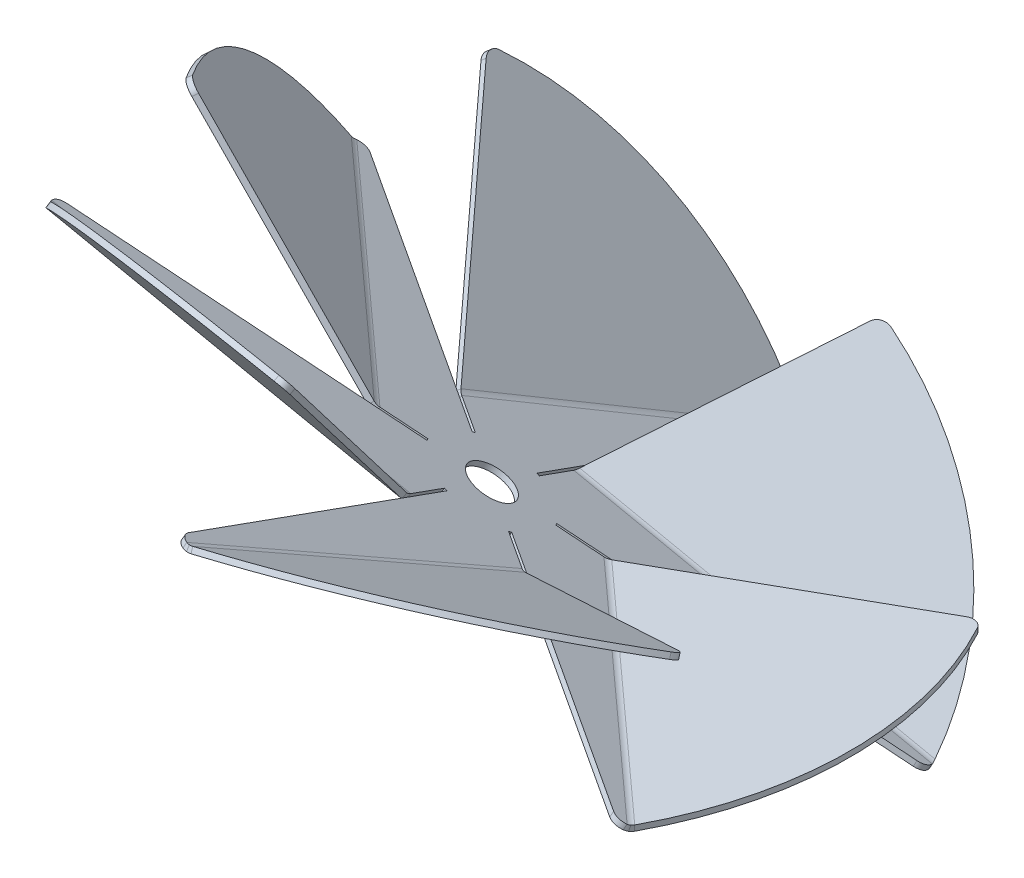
ISO-10303-21;
HEADER;
FILE_DESCRIPTION(('STEP AP214'),'2;1');
FILE_NAME('part.step','',(''),(''),'','','');
FILE_SCHEMA(('AUTOMOTIVE_DESIGN { 1 0 10303 214 1 1 1 1 }'));
ENDSEC;
DATA;
#1=APPLICATION_CONTEXT('core data for automotive mechanical design processes');
#2=APPLICATION_PROTOCOL_DEFINITION('international standard','automotive_design',2000,#1);
#3=PRODUCT_CONTEXT('',#1,'mechanical');
#4=PRODUCT('Part','Part','',(#3));
#5=PRODUCT_RELATED_PRODUCT_CATEGORY('part','',(#4));
#6=PRODUCT_DEFINITION_FORMATION('','',#4);
#7=PRODUCT_DEFINITION_CONTEXT('part definition',#1,'design');
#8=PRODUCT_DEFINITION('design','',#6,#7);
#9=PRODUCT_DEFINITION_SHAPE('','',#8);
#10=(LENGTH_UNIT() NAMED_UNIT(*) SI_UNIT(.MILLI.,.METRE.));
#11=(NAMED_UNIT(*) PLANE_ANGLE_UNIT() SI_UNIT($,.RADIAN.));
#12=(NAMED_UNIT(*) SI_UNIT($,.STERADIAN.) SOLID_ANGLE_UNIT());
#13=UNCERTAINTY_MEASURE_WITH_UNIT(LENGTH_MEASURE(1.E-05),#10,'distance_accuracy_value','');
#14=(GEOMETRIC_REPRESENTATION_CONTEXT(3) GLOBAL_UNCERTAINTY_ASSIGNED_CONTEXT((#13)) GLOBAL_UNIT_ASSIGNED_CONTEXT((#10,
#11,#12)) REPRESENTATION_CONTEXT('',''));
#15=CARTESIAN_POINT('',(0.,0.,0.));
#16=DIRECTION('',(0.,0.,1.));
#17=DIRECTION('',(1.,0.,0.));
#18=AXIS2_PLACEMENT_3D('',#15,#16,#17);
#19=CARTESIAN_POINT('',(33.810791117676,62.0486099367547,-50.9713699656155));
#20=DIRECTION('',(-0.936941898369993,0.343557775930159,-0.0640931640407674));
#21=DIRECTION('',(0.0764494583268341,0.38043033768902,0.921644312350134));
#22=AXIS2_PLACEMENT_3D('',#19,#20,#21);
#23=PLANE('',#22);
#24=DIRECTION('',(-0.0764494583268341,-0.38043033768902,-0.921644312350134));
#25=VECTOR('',#24,1.);
#26=CARTESIAN_POINT('',(32.728049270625,59.3224683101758,-49.7562786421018));
#27=LINE('',#26,#25);
#28=CARTESIAN_POINT('',(32.728049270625,59.3224683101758,-49.7562786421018));
#29=VERTEX_POINT('',#28);
#30=CARTESIAN_POINT('',(19.166593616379,-8.16249845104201,-213.247802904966));
#31=VERTEX_POINT('',#30);
#32=EDGE_CURVE('E192',#29,#31,#27,.T.);
#33=ORIENTED_EDGE('',*,*,#32,.T.);
#34=CARTESIAN_POINT('',(20.2493354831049,-5.43635677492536,-214.46289425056));
#35=CARTESIAN_POINT('',(19.166593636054,-8.16249840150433,-213.247802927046));
#36=B_SPLINE_CURVE_WITH_KNOTS('',1,(#34,#35),.UNSPECIFIED.,.F.,.F.,(2,2),(0.,1.),.UNSPECIFIED.);
#37=CARTESIAN_POINT('',(20.2493354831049,-5.43635677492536,-214.46289425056));
#38=VERTEX_POINT('',#37);
#39=EDGE_CURVE('E2402',#31,#38,#36,.F.);
#40=ORIENTED_EDGE('',*,*,#39,.T.);
#41=DIRECTION('',(-0.0764494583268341,-0.38043033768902,-0.921644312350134));
#42=VECTOR('',#41,1.);
#43=CARTESIAN_POINT('',(33.810791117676,62.0486099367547,-50.9713699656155));
#44=LINE('',#43,#42);
#45=CARTESIAN_POINT('',(33.810791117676,62.0486099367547,-50.9713699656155));
#46=VERTEX_POINT('',#45);
#47=EDGE_CURVE('E1690',#46,#38,#44,.T.);
#48=ORIENTED_EDGE('',*,*,#47,.F.);
#49=DIRECTION('',(-0.34102105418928,-0.858627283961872,0.38270592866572));
#50=VECTOR('',#49,1.);
#51=CARTESIAN_POINT('',(33.810791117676,62.0486099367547,-50.9713699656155));
#52=LINE('',#51,#50);
#53=EDGE_CURVE('E1697',#46,#29,#52,.T.);
#54=ORIENTED_EDGE('',*,*,#53,.T.);
#55=EDGE_LOOP('',(#33,#40,#48,#54));
#56=FACE_BOUND('',#55,.T.);
#57=ADVANCED_FACE('F166',(#56),#23,.F.);
#58=CARTESIAN_POINT('',(10.3326517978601,76.8591121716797,-38.663848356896));
#59=DIRECTION('',(0.402263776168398,-0.501241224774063,-0.766120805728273));
#60=DIRECTION('',(-0.849640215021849,0.10731459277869,-0.516328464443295));
#61=AXIS2_PLACEMENT_3D('',#58,#59,#60);
#62=PLANE('',#61);
#63=DIRECTION('',(0.849640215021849,-0.107314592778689,0.516328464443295));
#64=VECTOR('',#63,1.);
#65=CARTESIAN_POINT('',(10.3326517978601,76.8591121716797,-38.663848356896));
#66=LINE('',#65,#64);
#67=CARTESIAN_POINT('',(-9.79641493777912,79.4015325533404,-50.8963321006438));
#68=VERTEX_POINT('',#67);
#69=CARTESIAN_POINT('',(10.3326517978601,76.8591121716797,-38.663848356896));
#70=VERTEX_POINT('',#69);
#71=EDGE_CURVE('E1687',#68,#70,#66,.T.);
#72=ORIENTED_EDGE('',*,*,#71,.F.);
#73=CARTESIAN_POINT('',(-10.8791567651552,76.6753909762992,-49.68124079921));
#74=CARTESIAN_POINT('',(-9.79641491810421,79.4015326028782,-50.8963321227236));
#75=B_SPLINE_CURVE_WITH_KNOTS('',1,(#73,#74),.UNSPECIFIED.,.F.,.F.,(2,2),(0.,1.),.UNSPECIFIED.);
#76=CARTESIAN_POINT('',(-10.8791567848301,76.6753909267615,-49.6812407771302));
#77=VERTEX_POINT('',#76);
#78=EDGE_CURVE('E12',#68,#77,#75,.F.);
#79=ORIENTED_EDGE('',*,*,#78,.T.);
#80=DIRECTION('',(0.849640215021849,-0.107314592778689,0.516328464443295));
#81=VECTOR('',#80,1.);
#82=CARTESIAN_POINT('',(9.24990995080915,74.1329705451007,-37.4487570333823));
#83=LINE('',#82,#81);
#84=CARTESIAN_POINT('',(9.24990995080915,74.1329705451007,-37.4487570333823));
#85=VERTEX_POINT('',#84);
#86=EDGE_CURVE('E185',#77,#85,#83,.T.);
#87=ORIENTED_EDGE('',*,*,#86,.T.);
#88=DIRECTION('',(-0.34102105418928,-0.858627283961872,0.38270592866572));
#89=VECTOR('',#88,1.);
#90=CARTESIAN_POINT('',(10.3326517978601,76.8591121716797,-38.663848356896));
#91=LINE('',#90,#89);
#92=EDGE_CURVE('E1699',#70,#85,#91,.T.);
#93=ORIENTED_EDGE('',*,*,#92,.F.);
#94=EDGE_LOOP('',(#72,#79,#87,#93));
#95=FACE_BOUND('',#94,.T.);
#96=ADVANCED_FACE('F168',(#95),#62,.F.);
#97=CARTESIAN_POINT('',(35.8982585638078,71.124657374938,-20.4523436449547));
#98=DIRECTION('',(0.34102105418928,0.858627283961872,-0.38270592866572));
#99=DIRECTION('',(0.0764494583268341,0.38043033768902,0.921644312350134));
#100=AXIS2_PLACEMENT_3D('',#97,#98,#99);
#101=PLANE('',#100);
#102=CARTESIAN_POINT('',(35.8982585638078,71.124657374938,-20.4523436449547));
#103=DIRECTION('',(0.34102105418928,0.858627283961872,-0.38270592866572));
#104=DIRECTION('',(0.0764494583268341,0.38043033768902,0.921644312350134));
#105=AXIS2_PLACEMENT_3D('',#102,#103,#104);
#106=CIRCLE('',#105,12.7);
#107=CARTESIAN_POINT('',(34.927350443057,66.2931920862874,-32.1572264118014));
#108=VERTEX_POINT('',#107);
#109=EDGE_CURVE('E1486',#108,#108,#106,.T.);
#110=ORIENTED_EDGE('',*,*,#109,.T.);
#111=EDGE_LOOP('',(#110));
#112=FACE_BOUND('',#111,.T.);
#113=ORIENTED_EDGE('',*,*,#86,.F.);
#114=DIRECTION('',(0.160936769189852,-0.454424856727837,-0.87612636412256));
#115=VECTOR('',#114,1.);
#116=CARTESIAN_POINT('',(-13.3829482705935,83.7451556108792,-36.0508085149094));
#117=LINE('',#116,#115);
#118=EDGE_CURVE('E178',#77,#31,#117,.T.);
#119=ORIENTED_EDGE('',*,*,#118,.T.);
#120=ORIENTED_EDGE('',*,*,#32,.F.);
#121=CARTESIAN_POINT('',(35.8982585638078,71.124657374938,-20.4523436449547));
#122=DIRECTION('',(0.34102105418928,0.858627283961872,-0.38270592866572));
#123=DIRECTION('',(0.0764494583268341,0.38043033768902,0.921644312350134));
#124=AXIS2_PLACEMENT_3D('',#121,#122,#123);
#125=CIRCLE('',#124,31.75);
#126=CARTESIAN_POINT('',(34.2154445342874,58.7770703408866,-49.6545307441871));
#127=VERTEX_POINT('',#126);
#128=EDGE_CURVE('E1695',#127,#29,#125,.T.);
#129=ORIENTED_EDGE('',*,*,#128,.F.);
#130=DIRECTION('',(0.0764494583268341,0.38043033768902,0.921644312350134));
#131=VECTOR('',#130,1.);
#132=CARTESIAN_POINT('',(34.2154445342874,58.7770703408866,-49.6545307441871));
#133=LINE('',#132,#131);
#134=CARTESIAN_POINT('',(32.4055532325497,49.7706290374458,-71.4738615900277));
#135=VERTEX_POINT('',#134);
#136=EDGE_CURVE('E1489',#135,#127,#133,.T.);
#137=ORIENTED_EDGE('',*,*,#136,.F.);
#138=DIRECTION('',(0.871279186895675,-0.441547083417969,-0.214263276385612));
#139=VECTOR('',#138,1.);
#140=CARTESIAN_POINT('',(17.3169798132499,57.4172200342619,-67.7633090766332));
#141=LINE('',#140,#139);
#142=CARTESIAN_POINT('',(199.558100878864,-34.9389807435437,-112.579689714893));
#143=VERTEX_POINT('',#142);
#144=EDGE_CURVE('E1482',#135,#143,#141,.T.);
#145=ORIENTED_EDGE('',*,*,#144,.T.);
#146=CARTESIAN_POINT('',(194.006597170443,-32.149334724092,-111.267751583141));
#147=DIRECTION('',(0.34102105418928,0.858627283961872,-0.38270592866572));
#148=DIRECTION('',(0.0764494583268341,0.38043033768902,0.921644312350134));
#149=AXIS2_PLACEMENT_3D('',#146,#147,#148);
#150=CIRCLE('',#149,6.34999999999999);
#151=CARTESIAN_POINT('',(197.401803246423,-31.1480448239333,-105.995892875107));
#152=VERTEX_POINT('',#151);
#153=EDGE_CURVE('E1485',#152,#143,#150,.T.);
#154=ORIENTED_EDGE('',*,*,#153,.F.);
#155=DIRECTION('',(0.773190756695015,-0.48774493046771,-0.405315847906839));
#156=VECTOR('',#155,1.);
#157=CARTESIAN_POINT('',(60.014991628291,55.5184346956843,-33.9760820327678));
#158=LINE('',#157,#156);
#159=CARTESIAN_POINT('',(60.014991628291,55.5184346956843,-33.9760820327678));
#160=VERTEX_POINT('',#159);
#161=EDGE_CURVE('E1476',#160,#152,#158,.T.);
#162=ORIENTED_EDGE('',*,*,#161,.F.);
#163=CARTESIAN_POINT('',(35.8982585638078,71.124657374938,-20.4523436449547));
#164=DIRECTION('',(0.34102105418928,0.858627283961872,-0.38270592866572));
#165=DIRECTION('',(0.0764494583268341,0.38043033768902,0.921644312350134));
#166=AXIS2_PLACEMENT_3D('',#163,#164,#165);
#167=CIRCLE('',#166,31.75);
#168=CARTESIAN_POINT('',(60.863793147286,55.768757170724,-32.6581173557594));
#169=VERTEX_POINT('',#168);
#170=EDGE_CURVE('E1471',#169,#160,#167,.T.);
#171=ORIENTED_EDGE('',*,*,#170,.F.);
#172=DIRECTION('',(-0.773190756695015,0.48774493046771,0.405315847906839));
#173=VECTOR('',#172,1.);
#174=CARTESIAN_POINT('',(60.863793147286,55.768757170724,-32.6581173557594));
#175=LINE('',#174,#173);
#176=CARTESIAN_POINT('',(79.1685824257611,44.2217125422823,-42.2537069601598));
#177=VERTEX_POINT('',#176);
#178=EDGE_CURVE('E1470',#177,#169,#175,.T.);
#179=ORIENTED_EDGE('',*,*,#178,.F.);
#180=DIRECTION('',(0.741307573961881,0.00471818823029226,0.67114888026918));
#181=VECTOR('',#180,1.);
#182=CARTESIAN_POINT('',(66.330821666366,44.1400042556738,-53.8764787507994));
#183=LINE('',#182,#181);
#184=CARTESIAN_POINT('',(221.386428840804,45.1268841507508,86.5043844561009));
#185=VERTEX_POINT('',#184);
#186=EDGE_CURVE('E1638',#177,#185,#183,.T.);
#187=ORIENTED_EDGE('',*,*,#186,.T.);
#188=CARTESIAN_POINT('',(216.710548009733,45.0692137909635,82.2084197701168));
#189=DIRECTION('',(0.34102105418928,0.858627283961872,-0.38270592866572));
#190=DIRECTION('',(0.0764494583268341,0.38043033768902,0.921644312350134));
#191=AXIS2_PLACEMENT_3D('',#188,#189,#190);
#192=CIRCLE('',#191,6.34999999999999);
#193=CARTESIAN_POINT('',(214.156173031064,48.2520955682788,87.0732868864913));
#194=VERTEX_POINT('',#193);
#195=EDGE_CURVE('E1466',#194,#185,#192,.T.);
#196=ORIENTED_EDGE('',*,*,#195,.F.);
#197=DIRECTION('',(0.849640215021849,-0.10731459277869,0.516328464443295));
#198=VECTOR('',#197,1.);
#199=CARTESIAN_POINT('',(63.1852009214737,67.3206237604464,-4.67214703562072));
#200=LINE('',#199,#198);
#201=CARTESIAN_POINT('',(63.1852009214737,67.3206237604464,-4.67214703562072));
#202=VERTEX_POINT('',#201);
#203=EDGE_CURVE('E1461',#202,#194,#200,.T.);
#204=ORIENTED_EDGE('',*,*,#203,.F.);
#205=CARTESIAN_POINT('',(35.8982585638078,71.124657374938,-20.4523436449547));
#206=DIRECTION('',(0.34102105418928,0.858627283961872,-0.38270592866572));
#207=DIRECTION('',(0.0764494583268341,0.38043033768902,0.921644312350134));
#208=AXIS2_PLACEMENT_3D('',#205,#206,#207);
#209=CIRCLE('',#208,31.75);
#210=CARTESIAN_POINT('',(62.5466071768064,68.1163442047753,-3.45593025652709));
#211=VERTEX_POINT('',#210);
#212=EDGE_CURVE('E1456',#211,#202,#209,.T.);
#213=ORIENTED_EDGE('',*,*,#212,.F.);
#214=DIRECTION('',(-0.849640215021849,0.107314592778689,-0.516328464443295));
#215=VECTOR('',#214,1.);
#216=CARTESIAN_POINT('',(62.5466071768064,68.1163442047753,-3.45593025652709));
#217=LINE('',#216,#215);
#218=CARTESIAN_POINT('',(82.6612877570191,65.5757408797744,8.76781098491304));
#219=VERTEX_POINT('',#218);
#220=EDGE_CURVE('E1401',#219,#211,#217,.T.);
#221=ORIENTED_EDGE('',*,*,#220,.F.);
#222=DIRECTION('',(-0.129971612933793,0.446265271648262,0.885412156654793));
#223=VECTOR('',#222,1.);
#224=CARTESIAN_POINT('',(84.912100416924,57.8474415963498,-6.56551331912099));
#225=LINE('',#224,#223);
#226=CARTESIAN_POINT('',(57.7265865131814,151.190522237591,178.631730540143));
#227=VERTEX_POINT('',#226);
#228=EDGE_CURVE('E1390',#219,#227,#225,.T.);
#229=ORIENTED_EDGE('',*,*,#228,.T.);
#230=CARTESIAN_POINT('',(58.602209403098,148.343205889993,173.023827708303));
#231=DIRECTION('',(0.34102105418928,0.858627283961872,-0.38270592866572));
#232=DIRECTION('',(0.0764494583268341,0.38043033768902,0.921644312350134));
#233=AXIS2_PLACEMENT_3D('',#230,#231,#232);
#234=CIRCLE('',#233,6.34999999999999);
#235=CARTESIAN_POINT('',(52.6526283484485,150.52479776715,172.616836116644));
#236=VERTEX_POINT('',#235);
#237=EDGE_CURVE('E1403',#236,#227,#234,.T.);
#238=ORIENTED_EDGE('',*,*,#237,.F.);
#239=DIRECTION('',(0.0764494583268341,0.38043033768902,0.921644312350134));
#240=VECTOR('',#239,1.);
#241=CARTESIAN_POINT('',(52.6526283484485,150.52479776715,172.616836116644));
#242=LINE('',#241,#240);
#243=CARTESIAN_POINT('',(39.0684678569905,82.9268464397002,8.85159135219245));
#244=VERTEX_POINT('',#243);
#245=EDGE_CURVE('E1450',#244,#236,#242,.T.);
#246=ORIENTED_EDGE('',*,*,#245,.F.);
#247=CARTESIAN_POINT('',(35.8982585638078,71.124657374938,-20.4523436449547));
#248=DIRECTION('',(0.34102105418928,0.858627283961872,-0.38270592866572));
#249=DIRECTION('',(0.0764494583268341,0.38043033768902,0.921644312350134));
#250=AXIS2_PLACEMENT_3D('',#247,#248,#249);
#251=CIRCLE('',#250,31.75);
#252=CARTESIAN_POINT('',(37.5810725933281,83.4722444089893,8.74984345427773));
#253=VERTEX_POINT('',#252);
#254=EDGE_CURVE('E1439',#253,#244,#251,.T.);
#255=ORIENTED_EDGE('',*,*,#254,.F.);
#256=DIRECTION('',(-0.0764494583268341,-0.38043033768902,-0.921644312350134));
#257=VECTOR('',#256,1.);
#258=CARTESIAN_POINT('',(51.1652330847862,151.070195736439,172.515088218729));
#259=LINE('',#258,#257);
#260=CARTESIAN_POINT('',(39.3628890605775,92.3389787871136,30.2307152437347));
#261=VERTEX_POINT('',#260);
#262=EDGE_CURVE('E1427',#261,#253,#259,.T.);
#263=ORIENTED_EDGE('',*,*,#262,.F.);
#264=DIRECTION('',(-0.870632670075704,0.442022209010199,0.215905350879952));
#265=VECTOR('',#264,1.);
#266=CARTESIAN_POINT('',(54.4279026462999,84.6904367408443,26.4947917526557));
#267=LINE('',#266,#265);
#268=CARTESIAN_POINT('',(-127.761455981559,177.188393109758,71.6753354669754));
#269=VERTEX_POINT('',#268);
#270=EDGE_CURVE('E1307',#261,#269,#267,.T.);
#271=ORIENTED_EDGE('',*,*,#270,.T.);
#272=CARTESIAN_POINT('',(-122.210080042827,174.398649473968,70.3630642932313));
#273=DIRECTION('',(0.34102105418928,0.858627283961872,-0.38270592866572));
#274=DIRECTION('',(0.0764494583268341,0.38043033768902,0.921644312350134));
#275=AXIS2_PLACEMENT_3D('',#272,#273,#274);
#276=CIRCLE('',#275,6.35);
#277=CARTESIAN_POINT('',(-125.605286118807,173.397359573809,65.0912055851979));
#278=VERTEX_POINT('',#277);
#279=EDGE_CURVE('E1364',#278,#269,#276,.T.);
#280=ORIENTED_EDGE('',*,*,#279,.F.);
#281=DIRECTION('',(-0.773190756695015,0.48774493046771,0.405315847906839));
#282=VECTOR('',#281,1.);
#283=CARTESIAN_POINT('',(11.7815254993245,86.7308800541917,-6.92860525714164));
#284=LINE('',#283,#282);
#285=CARTESIAN_POINT('',(11.7815254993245,86.7308800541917,-6.92860525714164));
#286=VERTEX_POINT('',#285);
#287=EDGE_CURVE('E1718',#286,#278,#284,.T.);
#288=ORIENTED_EDGE('',*,*,#287,.F.);
#289=CARTESIAN_POINT('',(35.8982585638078,71.124657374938,-20.4523436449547));
#290=DIRECTION('',(0.34102105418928,0.858627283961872,-0.38270592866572));
#291=DIRECTION('',(0.0764494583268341,0.38043033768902,0.921644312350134));
#292=AXIS2_PLACEMENT_3D('',#289,#290,#291);
#293=CIRCLE('',#292,31.75);
#294=CARTESIAN_POINT('',(10.9327239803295,86.480557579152,-8.24656993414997));
#295=VERTEX_POINT('',#294);
#296=EDGE_CURVE('E1714',#295,#286,#293,.T.);
#297=ORIENTED_EDGE('',*,*,#296,.F.);
#298=DIRECTION('',(0.773190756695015,-0.48774493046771,-0.405315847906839));
#299=VECTOR('',#298,1.);
#300=CARTESIAN_POINT('',(10.9327239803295,86.480557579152,-8.24656993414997));
#301=LINE('',#300,#299);
#302=CARTESIAN_POINT('',(-7.37206529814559,98.0276022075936,1.34901967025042));
#303=VERTEX_POINT('',#302);
#304=EDGE_CURVE('E1095',#303,#295,#301,.T.);
#305=ORIENTED_EDGE('',*,*,#304,.F.);
#306=DIRECTION('',(-0.741307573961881,-0.00471818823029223,-0.67114888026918));
#307=VECTOR('',#306,1.);
#308=CARTESIAN_POINT('',(5.46569546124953,98.1093104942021,12.97179146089));
#309=LINE('',#308,#307);
#310=CARTESIAN_POINT('',(-149.589911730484,97.1224305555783,-127.409071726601));
#311=VERTEX_POINT('',#310);
#312=EDGE_CURVE('E1001',#303,#311,#309,.T.);
#313=ORIENTED_EDGE('',*,*,#312,.T.);
#314=CARTESIAN_POINT('',(-144.914030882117,97.1801009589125,-123.113107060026));
#315=DIRECTION('',(0.34102105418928,0.858627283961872,-0.38270592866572));
#316=DIRECTION('',(0.0764494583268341,0.38043033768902,0.921644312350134));
#317=AXIS2_PLACEMENT_3D('',#314,#315,#316);
#318=CIRCLE('',#317,6.34999999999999);
#319=CARTESIAN_POINT('',(-142.359655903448,93.9972191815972,-127.977974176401));
#320=VERTEX_POINT('',#319);
#321=EDGE_CURVE('E1064',#320,#311,#318,.T.);
#322=ORIENTED_EDGE('',*,*,#321,.F.);
#323=DIRECTION('',(-0.849640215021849,0.10731459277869,-0.516328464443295));
#324=VECTOR('',#323,1.);
#325=CARTESIAN_POINT('',(8.61131620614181,74.9286909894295,-36.2325402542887));
#326=LINE('',#325,#324);
#327=CARTESIAN_POINT('',(8.61131620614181,74.9286909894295,-36.2325402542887));
#328=VERTEX_POINT('',#327);
#329=EDGE_CURVE('E1708',#328,#320,#326,.T.);
#330=ORIENTED_EDGE('',*,*,#329,.F.);
#331=CARTESIAN_POINT('',(35.8982585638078,71.124657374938,-20.4523436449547));
#332=DIRECTION('',(0.34102105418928,0.858627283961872,-0.38270592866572));
#333=DIRECTION('',(0.0764494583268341,0.38043033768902,0.921644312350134));
#334=AXIS2_PLACEMENT_3D('',#331,#332,#333);
#335=CIRCLE('',#334,31.75);
#336=EDGE_CURVE('E1702',#85,#328,#335,.T.);
#337=ORIENTED_EDGE('',*,*,#336,.F.);
#338=EDGE_LOOP('',(#113,#119,#120,#129,#137,#145,#154,#162,#171,#179,#187,#196,#204,#213,#221,
#229,#238,#246,#255,#263,#271,#280,#288,#297,#305,#313,#322,#330,#337));
#339=FACE_BOUND('',#338,.T.);
#340=ADVANCED_FACE('F1076',(#112,#339),#101,.F.);
#341=CARTESIAN_POINT('',(-143.831289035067,99.9062425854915,-124.32819838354));
#342=DIRECTION('',(-0.34102105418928,-0.858627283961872,0.38270592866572));
#343=DIRECTION('',(-0.0764494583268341,-0.38043033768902,-0.921644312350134));
#344=AXIS2_PLACEMENT_3D('',#341,#342,#343);
#345=CYLINDRICAL_SURFACE('',#344,6.34999999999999);
#346=ORIENTED_EDGE('',*,*,#321,.T.);
#347=CARTESIAN_POINT('',(-148.507169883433,99.8485721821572,-128.624163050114));
#348=CARTESIAN_POINT('',(-149.589911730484,97.1224305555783,-127.409071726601));
#349=B_SPLINE_CURVE_WITH_KNOTS('',1,(#347,#348),.UNSPECIFIED.,.F.,.F.,(2,2),(0.,1.),.UNSPECIFIED.);
#350=CARTESIAN_POINT('',(-148.507169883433,99.8485721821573,-128.624163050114));
#351=VERTEX_POINT('',#350);
#352=EDGE_CURVE('E1035',#311,#351,#349,.F.);
#353=ORIENTED_EDGE('',*,*,#352,.T.);
#354=CARTESIAN_POINT('',(-143.831289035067,99.9062425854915,-124.32819838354));
#355=DIRECTION('',(0.34102105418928,0.858627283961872,-0.38270592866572));
#356=DIRECTION('',(0.0764494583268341,0.38043033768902,0.921644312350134));
#357=AXIS2_PLACEMENT_3D('',#354,#355,#356);
#358=CIRCLE('',#357,6.34999999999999);
#359=CARTESIAN_POINT('',(-141.276914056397,96.7233608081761,-129.193065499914));
#360=VERTEX_POINT('',#359);
#361=EDGE_CURVE('E1033',#360,#351,#358,.T.);
#362=ORIENTED_EDGE('',*,*,#361,.F.);
#363=DIRECTION('',(-0.34102105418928,-0.858627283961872,0.38270592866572));
#364=VECTOR('',#363,1.);
#365=CARTESIAN_POINT('',(-141.276914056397,96.7233608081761,-129.193065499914));
#366=LINE('',#365,#364);
#367=EDGE_CURVE('E1710',#360,#320,#366,.T.);
#368=ORIENTED_EDGE('',*,*,#367,.T.);
#369=EDGE_LOOP('',(#346,#353,#362,#368));
#370=FACE_BOUND('',#369,.T.);
#371=ADVANCED_FACE('F1066',(#370),#345,.T.);
#372=CARTESIAN_POINT('',(12.0154658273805,89.2066992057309,-9.46166125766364));
#373=DIRECTION('',(-0.534678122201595,-0.157683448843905,-0.83021396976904));
#374=DIRECTION('',(-0.773190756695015,0.48774493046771,0.405315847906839));
#375=AXIS2_PLACEMENT_3D('',#372,#373,#374);
#376=PLANE('',#375);
#377=DIRECTION('',(0.773190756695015,-0.48774493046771,-0.405315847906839));
#378=VECTOR('',#377,1.);
#379=CARTESIAN_POINT('',(12.0154658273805,89.2066992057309,-9.46166125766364));
#380=LINE('',#379,#378);
#381=CARTESIAN_POINT('',(-6.28932346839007,100.753743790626,0.133928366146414));
#382=VERTEX_POINT('',#381);
#383=CARTESIAN_POINT('',(12.0154658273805,89.2066992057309,-9.46166125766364));
#384=VERTEX_POINT('',#383);
#385=EDGE_CURVE('E1030',#382,#384,#380,.T.);
#386=ORIENTED_EDGE('',*,*,#385,.F.);
#387=CARTESIAN_POINT('',(-7.37206531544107,98.0276021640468,1.34901968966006));
#388=CARTESIAN_POINT('',(-6.28932346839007,100.753743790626,0.133928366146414));
#389=B_SPLINE_CURVE_WITH_KNOTS('',1,(#387,#388),.UNSPECIFIED.,.F.,.F.,(2,2),(0.,1.),.UNSPECIFIED.);
#390=EDGE_CURVE('E969',#382,#303,#389,.F.);
#391=ORIENTED_EDGE('',*,*,#390,.T.);
#392=ORIENTED_EDGE('',*,*,#304,.T.);
#393=DIRECTION('',(-0.34102105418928,-0.858627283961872,0.38270592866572));
#394=VECTOR('',#393,1.);
#395=CARTESIAN_POINT('',(12.0154658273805,89.2066992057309,-9.46166125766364));
#396=LINE('',#395,#394);
#397=EDGE_CURVE('E1042',#384,#295,#396,.T.);
#398=ORIENTED_EDGE('',*,*,#397,.F.);
#399=EDGE_LOOP('',(#386,#391,#392,#398));
#400=FACE_BOUND('',#399,.T.);
#401=ADVANCED_FACE('F1039',(#400),#376,.F.);
#402=CARTESIAN_POINT('',(-121.127338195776,177.124791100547,69.1479729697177));
#403=DIRECTION('',(-0.34102105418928,-0.858627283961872,0.38270592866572));
#404=DIRECTION('',(-0.0764494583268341,-0.38043033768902,-0.921644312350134));
#405=AXIS2_PLACEMENT_3D('',#402,#403,#404);
#406=CYLINDRICAL_SURFACE('',#405,6.35);
#407=ORIENTED_EDGE('',*,*,#279,.T.);
#408=CARTESIAN_POINT('',(-126.678714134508,179.914534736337,70.4602441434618));
#409=CARTESIAN_POINT('',(-127.761455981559,177.188393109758,71.6753354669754));
#410=B_SPLINE_CURVE_WITH_KNOTS('',1,(#408,#409),.UNSPECIFIED.,.F.,.F.,(2,2),(0.,1.),.UNSPECIFIED.);
#411=CARTESIAN_POINT('',(-126.678714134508,179.914534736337,70.4602441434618));
#412=VERTEX_POINT('',#411);
#413=EDGE_CURVE('E1338',#269,#412,#410,.F.);
#414=ORIENTED_EDGE('',*,*,#413,.T.);
#415=CARTESIAN_POINT('',(-121.127338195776,177.124791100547,69.1479729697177));
#416=DIRECTION('',(0.34102105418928,0.858627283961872,-0.38270592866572));
#417=DIRECTION('',(0.0764494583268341,0.38043033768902,0.921644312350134));
#418=AXIS2_PLACEMENT_3D('',#415,#416,#417);
#419=CIRCLE('',#418,6.35);
#420=CARTESIAN_POINT('',(-124.522544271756,176.123501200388,63.8761142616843));
#421=VERTEX_POINT('',#420);
#422=EDGE_CURVE('E1336',#421,#412,#419,.T.);
#423=ORIENTED_EDGE('',*,*,#422,.F.);
#424=DIRECTION('',(-0.34102105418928,-0.858627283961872,0.38270592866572));
#425=VECTOR('',#424,1.);
#426=CARTESIAN_POINT('',(-124.522544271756,176.123501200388,63.8761142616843));
#427=LINE('',#426,#425);
#428=EDGE_CURVE('E1438',#421,#278,#427,.T.);
#429=ORIENTED_EDGE('',*,*,#428,.T.);
#430=EDGE_LOOP('',(#407,#414,#423,#429));
#431=FACE_BOUND('',#430,.T.);
#432=ADVANCED_FACE('F1083',(#431),#406,.T.);
#433=CARTESIAN_POINT('',(52.2479749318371,153.796337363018,171.299996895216));
#434=DIRECTION('',(-0.936941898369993,0.343557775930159,-0.0640931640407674));
#435=DIRECTION('',(0.0764494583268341,0.38043033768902,0.921644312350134));
#436=AXIS2_PLACEMENT_3D('',#433,#434,#435);
#437=PLANE('',#436);
#438=DIRECTION('',(-0.0764494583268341,-0.38043033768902,-0.921644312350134));
#439=VECTOR('',#438,1.);
#440=CARTESIAN_POINT('',(52.2479749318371,153.796337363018,171.299996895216));
#441=LINE('',#440,#439);
#442=CARTESIAN_POINT('',(40.4456308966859,95.0651203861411,29.0156239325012));
#443=VERTEX_POINT('',#442);
#444=CARTESIAN_POINT('',(38.6638144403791,86.1983860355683,7.53475213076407));
#445=VERTEX_POINT('',#444);
#446=EDGE_CURVE('E1333',#443,#445,#441,.T.);
#447=ORIENTED_EDGE('',*,*,#446,.F.);
#448=CARTESIAN_POINT('',(39.3628890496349,92.3389787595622,30.2307152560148));
#449=CARTESIAN_POINT('',(40.4456308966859,95.0651203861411,29.0156239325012));
#450=B_SPLINE_CURVE_WITH_KNOTS('',1,(#448,#449),.UNSPECIFIED.,.F.,.F.,(2,2),(0.,1.),.UNSPECIFIED.);
#451=EDGE_CURVE('E1036',#443,#261,#450,.F.);
#452=ORIENTED_EDGE('',*,*,#451,.T.);
#453=ORIENTED_EDGE('',*,*,#262,.T.);
#454=DIRECTION('',(-0.34102105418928,-0.858627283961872,0.38270592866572));
#455=VECTOR('',#454,1.);
#456=CARTESIAN_POINT('',(38.6638144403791,86.1983860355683,7.53475213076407));
#457=LINE('',#456,#455);
#458=EDGE_CURVE('E1344',#445,#253,#457,.T.);
#459=ORIENTED_EDGE('',*,*,#458,.F.);
#460=EDGE_LOOP('',(#447,#452,#453,#459));
#461=FACE_BOUND('',#460,.T.);
#462=ADVANCED_FACE('F1077',(#461),#437,.F.);
#463=CARTESIAN_POINT('',(59.684951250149,151.069347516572,171.808736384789));
#464=DIRECTION('',(-0.34102105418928,-0.858627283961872,0.38270592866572));
#465=DIRECTION('',(-0.0764494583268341,-0.38043033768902,-0.921644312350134));
#466=AXIS2_PLACEMENT_3D('',#463,#464,#465);
#467=CYLINDRICAL_SURFACE('',#466,6.34999999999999);
#468=ORIENTED_EDGE('',*,*,#237,.T.);
#469=CARTESIAN_POINT('',(58.8093283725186,153.916663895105,177.416639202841));
#470=CARTESIAN_POINT('',(57.7265865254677,151.190522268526,178.631730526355));
#471=B_SPLINE_CURVE_WITH_KNOTS('',1,(#469,#470),.UNSPECIFIED.,.F.,.F.,(2,2),(0.,1.),.UNSPECIFIED.);
#472=CARTESIAN_POINT('',(58.8093283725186,153.916663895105,177.416639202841));
#473=VERTEX_POINT('',#472);
#474=EDGE_CURVE('E1398',#227,#473,#471,.F.);
#475=ORIENTED_EDGE('',*,*,#474,.T.);
#476=CARTESIAN_POINT('',(59.684951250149,151.069347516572,171.808736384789));
#477=DIRECTION('',(0.34102105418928,0.858627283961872,-0.38270592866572));
#478=DIRECTION('',(0.0764494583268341,0.38043033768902,0.921644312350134));
#479=AXIS2_PLACEMENT_3D('',#476,#477,#478);
#480=CIRCLE('',#479,6.34999999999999);
#481=CARTESIAN_POINT('',(53.7353701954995,153.250939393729,171.40174479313));
#482=VERTEX_POINT('',#481);
#483=EDGE_CURVE('E1680',#482,#473,#480,.T.);
#484=ORIENTED_EDGE('',*,*,#483,.F.);
#485=DIRECTION('',(-0.34102105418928,-0.858627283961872,0.38270592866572));
#486=VECTOR('',#485,1.);
#487=CARTESIAN_POINT('',(53.7353701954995,153.250939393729,171.40174479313));
#488=LINE('',#487,#486);
#489=EDGE_CURVE('E1408',#482,#236,#488,.T.);
#490=ORIENTED_EDGE('',*,*,#489,.T.);
#491=EDGE_LOOP('',(#468,#475,#484,#490));
#492=FACE_BOUND('',#491,.T.);
#493=ADVANCED_FACE('F1379',(#492),#467,.T.);
#494=CARTESIAN_POINT('',(63.6293490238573,70.8424858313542,-4.67102158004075));
#495=DIRECTION('',(-0.402263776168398,0.501241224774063,0.766120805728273));
#496=DIRECTION('',(0.849640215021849,-0.10731459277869,0.516328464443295));
#497=AXIS2_PLACEMENT_3D('',#494,#495,#496);
#498=PLANE('',#497);
#499=DIRECTION('',(-0.849640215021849,0.107314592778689,-0.516328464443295));
#500=VECTOR('',#499,1.);
#501=CARTESIAN_POINT('',(63.6293490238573,70.8424858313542,-4.67102158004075));
#502=LINE('',#501,#500);
#503=CARTESIAN_POINT('',(83.7440296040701,68.3018825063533,7.55271966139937));
#504=VERTEX_POINT('',#503);
#505=CARTESIAN_POINT('',(63.6293490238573,70.8424858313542,-4.67102158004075));
#506=VERTEX_POINT('',#505);
#507=EDGE_CURVE('E1679',#504,#506,#502,.T.);
#508=ORIENTED_EDGE('',*,*,#507,.F.);
#509=CARTESIAN_POINT('',(82.6612877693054,65.5757409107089,8.76781097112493));
#510=CARTESIAN_POINT('',(83.7440296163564,68.3018825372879,7.55271964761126));
#511=B_SPLINE_CURVE_WITH_KNOTS('',1,(#509,#510),.UNSPECIFIED.,.F.,.F.,(2,2),(0.,1.),.UNSPECIFIED.);
#512=EDGE_CURVE('E1339',#504,#219,#511,.F.);
#513=ORIENTED_EDGE('',*,*,#512,.T.);
#514=ORIENTED_EDGE('',*,*,#220,.T.);
#515=DIRECTION('',(-0.34102105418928,-0.858627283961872,0.38270592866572));
#516=VECTOR('',#515,1.);
#517=CARTESIAN_POINT('',(63.6293490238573,70.8424858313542,-4.67102158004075));
#518=LINE('',#517,#516);
#519=EDGE_CURVE('E1404',#506,#211,#518,.T.);
#520=ORIENTED_EDGE('',*,*,#519,.F.);
#521=EDGE_LOOP('',(#508,#513,#514,#520));
#522=FACE_BOUND('',#521,.T.);
#523=ADVANCED_FACE('F1374',(#522),#498,.F.);
#524=CARTESIAN_POINT('',(217.793289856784,47.7953554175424,80.9933284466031));
#525=DIRECTION('',(-0.34102105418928,-0.858627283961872,0.38270592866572));
#526=DIRECTION('',(-0.0764494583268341,-0.38043033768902,-0.921644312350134));
#527=AXIS2_PLACEMENT_3D('',#524,#525,#526);
#528=CYLINDRICAL_SURFACE('',#527,6.34999999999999);
#529=ORIENTED_EDGE('',*,*,#195,.T.);
#530=CARTESIAN_POINT('',(222.469170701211,47.8530258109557,85.2892931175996));
#531=CARTESIAN_POINT('',(221.38642885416,45.1268841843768,86.5043844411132));
#532=B_SPLINE_CURVE_WITH_KNOTS('',1,(#530,#531),.UNSPECIFIED.,.F.,.F.,(2,2),(0.,1.),.UNSPECIFIED.);
#533=CARTESIAN_POINT('',(222.469170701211,47.8530258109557,85.2892931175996));
#534=VERTEX_POINT('',#533);
#535=EDGE_CURVE('E1620',#185,#534,#532,.F.);
#536=ORIENTED_EDGE('',*,*,#535,.T.);
#537=CARTESIAN_POINT('',(217.793289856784,47.7953554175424,80.9933284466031));
#538=DIRECTION('',(0.34102105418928,0.858627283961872,-0.38270592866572));
#539=DIRECTION('',(0.0764494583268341,0.38043033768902,0.921644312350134));
#540=AXIS2_PLACEMENT_3D('',#537,#538,#539);
#541=CIRCLE('',#540,6.34999999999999);
#542=CARTESIAN_POINT('',(215.238914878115,50.9782371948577,85.8581955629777));
#543=VERTEX_POINT('',#542);
#544=EDGE_CURVE('E1605',#543,#534,#541,.T.);
#545=ORIENTED_EDGE('',*,*,#544,.F.);
#546=DIRECTION('',(-0.34102105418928,-0.858627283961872,0.38270592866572));
#547=VECTOR('',#546,1.);
#548=CARTESIAN_POINT('',(215.238914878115,50.9782371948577,85.8581955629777));
#549=LINE('',#548,#547);
#550=EDGE_CURVE('E1463',#543,#194,#549,.T.);
#551=ORIENTED_EDGE('',*,*,#550,.T.);
#552=EDGE_LOOP('',(#529,#536,#545,#551));
#553=FACE_BOUND('',#552,.T.);
#554=ADVANCED_FACE('F1378',(#553),#528,.T.);
#555=CARTESIAN_POINT('',(61.946534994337,58.4948987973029,-33.8732086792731));
#556=DIRECTION('',(0.534678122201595,0.157683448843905,0.83021396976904));
#557=DIRECTION('',(0.773190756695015,-0.48774493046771,-0.405315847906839));
#558=AXIS2_PLACEMENT_3D('',#555,#556,#557);
#559=PLANE('',#558);
#560=DIRECTION('',(-0.773190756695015,0.48774493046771,0.405315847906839));
#561=VECTOR('',#560,1.);
#562=CARTESIAN_POINT('',(61.946534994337,58.4948987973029,-33.8732086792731));
#563=LINE('',#562,#561);
#564=CARTESIAN_POINT('',(80.2513242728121,46.9478541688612,-43.4687982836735));
#565=VERTEX_POINT('',#564);
#566=CARTESIAN_POINT('',(61.946534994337,58.4948987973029,-33.8732086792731));
#567=VERTEX_POINT('',#566);
#568=EDGE_CURVE('E1613',#565,#567,#563,.T.);
#569=ORIENTED_EDGE('',*,*,#568,.F.);
#570=CARTESIAN_POINT('',(79.1685824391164,44.2217125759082,-42.2537069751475));
#571=CARTESIAN_POINT('',(80.2513242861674,46.9478542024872,-43.4687982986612));
#572=B_SPLINE_CURVE_WITH_KNOTS('',1,(#570,#571),.UNSPECIFIED.,.F.,.F.,(2,2),(0.,1.),.UNSPECIFIED.);
#573=EDGE_CURVE('E1633',#565,#177,#572,.F.);
#574=ORIENTED_EDGE('',*,*,#573,.T.);
#575=ORIENTED_EDGE('',*,*,#178,.T.);
#576=DIRECTION('',(-0.34102105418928,-0.858627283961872,0.38270592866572));
#577=VECTOR('',#576,1.);
#578=CARTESIAN_POINT('',(61.946534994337,58.4948987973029,-33.8732086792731));
#579=LINE('',#578,#577);
#580=EDGE_CURVE('E1467',#567,#169,#579,.T.);
#581=ORIENTED_EDGE('',*,*,#580,.F.);
#582=EDGE_LOOP('',(#569,#574,#575,#581));
#583=FACE_BOUND('',#582,.T.);
#584=ADVANCED_FACE('F1640',(#583),#559,.F.);
#585=CARTESIAN_POINT('',(25.1308495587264,48.6439335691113,-17.9093102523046));
#586=DIRECTION('',(0.471810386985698,0.873780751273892,0.117907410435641));
#587=DIRECTION('',(-0.131395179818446,-0.0625541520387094,0.98935447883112));
#588=AXIS2_PLACEMENT_3D('',#585,#586,#587);
#589=PLANE('',#588);
#590=DIRECTION('',(-0.131395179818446,-0.0625541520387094,0.98935447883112));
#591=VECTOR('',#590,1.);
#592=CARTESIAN_POINT('',(29.9933771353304,50.2465972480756,-49.2437927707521));
#593=LINE('',#592,#591);
#594=CARTESIAN_POINT('',(53.3407395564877,61.3617268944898,-225.040329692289));
#595=VERTEX_POINT('',#594);
#596=CARTESIAN_POINT('',(33.5587158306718,51.9439710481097,-76.0894033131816));
#597=VERTEX_POINT('',#596);
#598=EDGE_CURVE('E1542',#595,#597,#593,.T.);
#599=ORIENTED_EDGE('',*,*,#598,.T.);
#600=DIRECTION('',(0.871279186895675,-0.441547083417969,-0.214263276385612));
#601=VECTOR('',#600,1.);
#602=CARTESIAN_POINT('',(17.5692093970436,60.0471371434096,-72.1572951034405));
#603=LINE('',#602,#601);
#604=CARTESIAN_POINT('',(199.252867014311,-32.0265521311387,-116.836585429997));
#605=VERTEX_POINT('',#604);
#606=EDGE_CURVE('E1554',#597,#605,#603,.T.);
#607=ORIENTED_EDGE('',*,*,#606,.T.);
#608=CARTESIAN_POINT('',(25.1308495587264,48.6439335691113,-17.9093102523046));
#609=DIRECTION('',(0.471810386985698,0.873780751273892,0.117907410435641));
#610=DIRECTION('',(-0.131395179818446,-0.0625541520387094,0.98935447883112));
#611=AXIS2_PLACEMENT_3D('',#608,#609,#610);
#612=CIRCLE('',#611,215.9);
#613=CARTESIAN_POINT('',(59.8996267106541,58.5918329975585,-230.758978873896));
#614=VERTEX_POINT('',#613);
#615=EDGE_CURVE('E1543',#605,#614,#612,.T.);
#616=ORIENTED_EDGE('',*,*,#615,.T.);
#617=CARTESIAN_POINT('',(58.8770156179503,58.2992477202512,-224.498694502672));
#618=DIRECTION('',(0.471810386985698,0.873780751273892,0.117907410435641));
#619=DIRECTION('',(0.131395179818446,0.0625541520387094,-0.98935447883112));
#620=AXIS2_PLACEMENT_3D('',#617,#618,#619);
#621=CIRCLE('',#620,6.34999999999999);
#622=EDGE_CURVE('E1540',#614,#595,#621,.T.);
#623=ORIENTED_EDGE('',*,*,#622,.T.);
#624=EDGE_LOOP('',(#599,#607,#616,#623));
#625=FACE_BOUND('',#624,.T.);
#626=ADVANCED_FACE('F1587',(#625),#589,.T.);
#627=CARTESIAN_POINT('',(23.6328515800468,45.8696796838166,-18.2836662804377));
#628=DIRECTION('',(0.471810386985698,0.873780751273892,0.117907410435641));
#629=DIRECTION('',(-0.131395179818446,-0.0625541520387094,0.98935447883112));
#630=AXIS2_PLACEMENT_3D('',#627,#628,#629);
#631=PLANE('',#630);
#632=DIRECTION('',(0.871279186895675,-0.441547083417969,-0.214263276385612));
#633=VECTOR('',#632,1.);
#634=CARTESIAN_POINT('',(16.071211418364,57.272883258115,-72.5316511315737));
#635=LINE('',#634,#633);
#636=CARTESIAN_POINT('',(32.0607178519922,49.1697171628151,-76.4637593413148));
#637=VERTEX_POINT('',#636);
#638=CARTESIAN_POINT('',(197.754869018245,-34.8008060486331,-117.210941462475));
#639=VERTEX_POINT('',#638);
#640=EDGE_CURVE('E2054',#637,#639,#635,.T.);
#641=ORIENTED_EDGE('',*,*,#640,.F.);
#642=DIRECTION('',(-0.131395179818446,-0.0625541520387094,0.98935447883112));
#643=VECTOR('',#642,1.);
#644=CARTESIAN_POINT('',(28.4953791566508,47.472343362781,-49.6181487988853));
#645=LINE('',#644,#643);
#646=CARTESIAN_POINT('',(51.8427415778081,58.5874730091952,-225.414685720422));
#647=VERTEX_POINT('',#646);
#648=EDGE_CURVE('E1546',#647,#637,#645,.T.);
#649=ORIENTED_EDGE('',*,*,#648,.F.);
#650=CARTESIAN_POINT('',(57.3790176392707,55.5249938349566,-224.873050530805));
#651=DIRECTION('',(0.471810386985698,0.873780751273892,0.117907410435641));
#652=DIRECTION('',(0.131395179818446,0.0625541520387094,-0.98935447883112));
#653=AXIS2_PLACEMENT_3D('',#650,#651,#652);
#654=CIRCLE('',#653,6.34999999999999);
#655=CARTESIAN_POINT('',(58.4016287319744,55.8175791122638,-231.133334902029));
#656=VERTEX_POINT('',#655);
#657=EDGE_CURVE('E1544',#656,#647,#654,.T.);
#658=ORIENTED_EDGE('',*,*,#657,.F.);
#659=CARTESIAN_POINT('',(23.6328515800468,45.8696796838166,-18.2836662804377));
#660=DIRECTION('',(0.471810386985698,0.873780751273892,0.117907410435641));
#661=DIRECTION('',(-0.131395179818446,-0.0625541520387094,0.98935447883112));
#662=AXIS2_PLACEMENT_3D('',#659,#660,#661);
#663=CIRCLE('',#662,215.9);
#664=EDGE_CURVE('E1547',#639,#656,#663,.T.);
#665=ORIENTED_EDGE('',*,*,#664,.F.);
#666=EDGE_LOOP('',(#641,#649,#658,#665));
#667=FACE_BOUND('',#666,.T.);
#668=ADVANCED_FACE('F1588',(#667),#631,.F.);
#669=CARTESIAN_POINT('',(25.1308495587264,48.6439335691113,-17.9093102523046));
#670=DIRECTION('',(-0.471810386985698,-0.873780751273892,-0.117907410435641));
#671=DIRECTION('',(0.131395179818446,0.0625541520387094,-0.98935447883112));
#672=AXIS2_PLACEMENT_3D('',#669,#670,#671);
#673=CYLINDRICAL_SURFACE('',#672,215.9);
#674=CARTESIAN_POINT('',(197.754869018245,-34.8008060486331,-117.210941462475));
#675=CARTESIAN_POINT('',(199.252866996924,-32.0265521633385,-116.836585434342));
#676=B_SPLINE_CURVE_WITH_KNOTS('',1,(#674,#675),.UNSPECIFIED.,.F.,.F.,(2,2),(0.,1.),.UNSPECIFIED.);
#677=EDGE_CURVE('E1621',#639,#605,#676,.T.);
#678=ORIENTED_EDGE('',*,*,#677,.F.);
#679=ORIENTED_EDGE('',*,*,#664,.T.);
#680=DIRECTION('',(-0.471810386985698,-0.873780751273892,-0.117907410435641));
#681=VECTOR('',#680,1.);
#682=CARTESIAN_POINT('',(59.8996267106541,58.5918329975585,-230.758978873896));
#683=LINE('',#682,#681);
#684=EDGE_CURVE('E1551',#614,#656,#683,.T.);
#685=ORIENTED_EDGE('',*,*,#684,.F.);
#686=ORIENTED_EDGE('',*,*,#615,.F.);
#687=EDGE_LOOP('',(#678,#679,#685,#686));
#688=FACE_BOUND('',#687,.T.);
#689=ADVANCED_FACE('F1591',(#688),#673,.T.);
#690=CARTESIAN_POINT('',(58.8770156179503,58.2992477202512,-224.498694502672));
#691=DIRECTION('',(-0.471810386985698,-0.873780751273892,-0.117907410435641));
#692=DIRECTION('',(0.131395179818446,0.0625541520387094,-0.98935447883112));
#693=AXIS2_PLACEMENT_3D('',#690,#691,#692);
#694=CYLINDRICAL_SURFACE('',#693,6.34999999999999);
#695=ORIENTED_EDGE('',*,*,#657,.T.);
#696=DIRECTION('',(-0.471810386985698,-0.873780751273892,-0.117907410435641));
#697=VECTOR('',#696,1.);
#698=CARTESIAN_POINT('',(53.3407395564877,61.3617268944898,-225.040329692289));
#699=LINE('',#698,#697);
#700=EDGE_CURVE('E1548',#595,#647,#699,.T.);
#701=ORIENTED_EDGE('',*,*,#700,.F.);
#702=ORIENTED_EDGE('',*,*,#622,.F.);
#703=ORIENTED_EDGE('',*,*,#684,.T.);
#704=EDGE_LOOP('',(#695,#701,#702,#703));
#705=FACE_BOUND('',#704,.T.);
#706=ADVANCED_FACE('F1521',(#705),#694,.T.);
#707=CARTESIAN_POINT('',(29.9933771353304,50.2465972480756,-49.2437927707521));
#708=DIRECTION('',(0.871854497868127,-0.482280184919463,0.0852968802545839));
#709=DIRECTION('',(0.131395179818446,0.0625541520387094,-0.98935447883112));
#710=AXIS2_PLACEMENT_3D('',#707,#708,#709);
#711=PLANE('',#710);
#712=CARTESIAN_POINT('',(33.5587158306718,51.9439710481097,-76.0894033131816));
#713=CARTESIAN_POINT('',(32.0607178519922,49.1697171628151,-76.4637593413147));
#714=B_SPLINE_CURVE_WITH_KNOTS('',1,(#712,#713),.UNSPECIFIED.,.F.,.F.,(2,2),(0.,1.),.UNSPECIFIED.);
#715=EDGE_CURVE('E1557',#597,#637,#714,.T.);
#716=ORIENTED_EDGE('',*,*,#715,.F.);
#717=ORIENTED_EDGE('',*,*,#598,.F.);
#718=ORIENTED_EDGE('',*,*,#700,.T.);
#719=ORIENTED_EDGE('',*,*,#648,.T.);
#720=EDGE_LOOP('',(#716,#717,#718,#719));
#721=FACE_BOUND('',#720,.T.);
#722=ADVANCED_FACE('F1577',(#721),#711,.F.);
#723=CARTESIAN_POINT('',(36.9810004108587,73.8507990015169,-21.6674349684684));
#724=DIRECTION('',(-0.34102105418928,-0.858627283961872,0.38270592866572));
#725=DIRECTION('',(-0.0764494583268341,-0.38043033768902,-0.921644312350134));
#726=AXIS2_PLACEMENT_3D('',#723,#724,#725);
#727=CYLINDRICAL_SURFACE('',#726,12.7);
#728=CARTESIAN_POINT('',(36.9810004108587,73.8507990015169,-21.6674349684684));
#729=DIRECTION('',(0.34102105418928,0.858627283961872,-0.38270592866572));
#730=DIRECTION('',(0.0764494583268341,0.38043033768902,0.921644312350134));
#731=AXIS2_PLACEMENT_3D('',#728,#729,#730);
#732=CIRCLE('',#731,12.7);
#733=CARTESIAN_POINT('',(36.0100922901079,69.0193337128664,-33.3723177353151));
#734=VERTEX_POINT('',#733);
#735=EDGE_CURVE('E1478',#734,#734,#732,.T.);
#736=CARTESIAN_POINT('',(36.0100922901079,69.0193337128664,-33.3723177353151));
#737=CARTESIAN_POINT('',(35.9988137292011,68.9909364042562,-33.3596605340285));
#738=CARTESIAN_POINT('',(35.9875351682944,68.962539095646,-33.3470033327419));
#739=CARTESIAN_POINT('',(35.9649780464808,68.9057444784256,-33.3216889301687));
#740=CARTESIAN_POINT('',(35.953699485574,68.8773471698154,-33.3090317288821));
#741=CARTESIAN_POINT('',(35.9311423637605,68.820552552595,-33.2837173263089));
#742=CARTESIAN_POINT('',(35.9198638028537,68.7921552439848,-33.2710601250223));
#743=CARTESIAN_POINT('',(35.8973066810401,68.7353606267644,-33.2457457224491));
#744=CARTESIAN_POINT('',(35.8860281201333,68.7069633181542,-33.2330885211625));
#745=CARTESIAN_POINT('',(35.8634709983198,68.6501687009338,-33.2077741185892));
#746=CARTESIAN_POINT('',(35.852192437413,68.6217713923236,-33.1951169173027));
#747=CARTESIAN_POINT('',(35.8296353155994,68.5649767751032,-33.1698025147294));
#748=CARTESIAN_POINT('',(35.8183567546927,68.536579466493,-33.1571453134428));
#749=CARTESIAN_POINT('',(35.7957996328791,68.4797848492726,-33.1318309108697));
#750=CARTESIAN_POINT('',(35.7845210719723,68.4513875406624,-33.119173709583));
#751=CARTESIAN_POINT('',(35.7619639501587,68.394592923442,-33.0938593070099));
#752=CARTESIAN_POINT('',(35.750685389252,68.3661956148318,-33.0812021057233));
#753=CARTESIAN_POINT('',(35.7281282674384,68.3094009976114,-33.05588770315));
#754=CARTESIAN_POINT('',(35.7168497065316,68.2810036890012,-33.0432305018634));
#755=CARTESIAN_POINT('',(35.6942925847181,68.2242090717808,-33.0179160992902));
#756=CARTESIAN_POINT('',(35.6830140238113,68.1958117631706,-33.0052588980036));
#757=CARTESIAN_POINT('',(35.6604569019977,68.1390171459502,-32.9799444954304));
#758=CARTESIAN_POINT('',(35.6491783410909,68.11061983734,-32.9672872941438));
#759=CARTESIAN_POINT('',(35.6266212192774,68.0538252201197,-32.9419728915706));
#760=CARTESIAN_POINT('',(35.6153426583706,68.0254279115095,-32.929315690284));
#761=CARTESIAN_POINT('',(35.592785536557,67.9686332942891,-32.9040012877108));
#762=CARTESIAN_POINT('',(35.5815069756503,67.9402359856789,-32.8913440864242));
#763=CARTESIAN_POINT('',(35.5589498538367,67.8834413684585,-32.866029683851));
#764=CARTESIAN_POINT('',(35.5476712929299,67.8550440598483,-32.8533724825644));
#765=CARTESIAN_POINT('',(35.5251141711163,67.7982494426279,-32.8280580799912));
#766=CARTESIAN_POINT('',(35.5138356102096,67.7698521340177,-32.8154008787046));
#767=CARTESIAN_POINT('',(35.491278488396,67.7130575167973,-32.7900864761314));
#768=CARTESIAN_POINT('',(35.4799999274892,67.6846602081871,-32.7774292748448));
#769=CARTESIAN_POINT('',(35.4574428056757,67.6278655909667,-32.7521148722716));
#770=CARTESIAN_POINT('',(35.4461642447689,67.5994682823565,-32.739457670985));
#771=CARTESIAN_POINT('',(35.4236071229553,67.5426736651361,-32.7141432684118));
#772=CARTESIAN_POINT('',(35.4123285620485,67.5142763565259,-32.7014860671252));
#773=CARTESIAN_POINT('',(35.389771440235,67.4574817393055,-32.676171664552));
#774=CARTESIAN_POINT('',(35.3784928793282,67.4290844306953,-32.6635144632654));
#775=CARTESIAN_POINT('',(35.3559357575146,67.3722898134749,-32.6382000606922));
#776=CARTESIAN_POINT('',(35.3446571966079,67.3438925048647,-32.6255428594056));
#777=CARTESIAN_POINT('',(35.3221000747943,67.2870978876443,-32.6002284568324));
#778=CARTESIAN_POINT('',(35.3108215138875,67.2587005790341,-32.5875712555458));
#779=CARTESIAN_POINT('',(35.2882643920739,67.2019059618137,-32.5622568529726));
#780=CARTESIAN_POINT('',(35.2769858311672,67.1735086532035,-32.549599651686));
#781=CARTESIAN_POINT('',(35.2544287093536,67.1167140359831,-32.5242852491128));
#782=CARTESIAN_POINT('',(35.2431501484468,67.0883167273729,-32.5116280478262));
#783=CARTESIAN_POINT('',(35.2205930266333,67.0315221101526,-32.486313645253));
#784=CARTESIAN_POINT('',(35.2093144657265,67.0031248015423,-32.4736564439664));
#785=CARTESIAN_POINT('',(35.1867573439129,66.946330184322,-32.4483420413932));
#786=CARTESIAN_POINT('',(35.1754787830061,66.9179328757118,-32.4356848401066));
#787=CARTESIAN_POINT('',(35.1529216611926,66.8611382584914,-32.4103704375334));
#788=CARTESIAN_POINT('',(35.1416431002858,66.8327409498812,-32.3977132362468));
#789=CARTESIAN_POINT('',(35.1190859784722,66.7759463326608,-32.3723988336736));
#790=CARTESIAN_POINT('',(35.1078074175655,66.7475490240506,-32.359741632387));
#791=CARTESIAN_POINT('',(35.0852502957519,66.6907544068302,-32.3344272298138));
#792=CARTESIAN_POINT('',(35.0739717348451,66.66235709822,-32.3217700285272));
#793=CARTESIAN_POINT('',(35.0514146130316,66.6055624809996,-32.296455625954));
#794=CARTESIAN_POINT('',(35.0401360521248,66.5771651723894,-32.2837984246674));
#795=CARTESIAN_POINT('',(35.0175789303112,66.520370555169,-32.2584840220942));
#796=CARTESIAN_POINT('',(35.0063003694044,66.4919732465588,-32.2458268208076));
#797=CARTESIAN_POINT('',(34.9837432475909,66.4351786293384,-32.2205124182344));
#798=CARTESIAN_POINT('',(34.9724646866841,66.4067813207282,-32.2078552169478));
#799=CARTESIAN_POINT('',(34.9499075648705,66.3499867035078,-32.1825408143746));
#800=CARTESIAN_POINT('',(34.9386290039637,66.3215893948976,-32.169883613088));
#801=CARTESIAN_POINT('',(34.927350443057,66.2931920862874,-32.1572264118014));
#802=B_SPLINE_CURVE_WITH_KNOTS('',3,(#736,#737,#738,#739,#740,#741,#742,#743,#744,#745,#746,
#747,#748,#749,#750,#751,#752,#753,#754,#755,#756,#757,#758,#759,#760,#761,#762,#763,#764,#765,
#766,#767,#768,#769,#770,#771,#772,#773,#774,#775,#776,#777,#778,#779,#780,#781,#782,#783,#784,
#785,#786,#787,#788,#789,#790,#791,#792,#793,#794,#795,#796,#797,#798,#799,#800,#801),
.UNSPECIFIED.,.F.,.F.,(4,2,2,2,2,2,2,2,2,2,2,2,2,2,2,2,2,2,2,2,2,2,2,2,2,2,2,2,2,2,2,2,4),(0.,
0.0992187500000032,0.198437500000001,0.29765625,0.396874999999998,0.496093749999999,
0.595312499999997,0.694531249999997,0.793749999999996,0.892968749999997,0.992187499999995,
1.09140624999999,1.19062499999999,1.28984374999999,1.38906249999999,1.48828124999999,1.5875,
1.68671875,1.7859375,1.88515625,1.984375,2.08359375,2.1828125,2.28203125,2.38125,
2.48046874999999,2.5796875,2.67890624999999,2.77812499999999,2.87734374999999,2.97656249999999,
3.07578124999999,3.175),.UNSPECIFIED.);
#803=EDGE_CURVE('BSEAM1586',#734,#108,#802,.T.);
#804=ORIENTED_EDGE('',*,*,#735,.T.);
#805=ORIENTED_EDGE('',*,*,#109,.F.);
#806=ORIENTED_EDGE('',*,*,#803,.T.);
#807=ORIENTED_EDGE('',*,*,#803,.F.);
#808=EDGE_LOOP('',(#804,#806,#805,#807));
#809=FACE_BOUND('',#808,.T.);
#810=ADVANCED_FACE('F1586',(#809),#727,.F.);
#811=CARTESIAN_POINT('',(61.0977334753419,58.2445763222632,-35.1911733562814));
#812=DIRECTION('',(-0.534678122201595,-0.157683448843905,-0.83021396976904));
#813=DIRECTION('',(-0.773190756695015,0.48774493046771,0.405315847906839));
#814=AXIS2_PLACEMENT_3D('',#811,#812,#813);
#815=PLANE('',#814);
#816=ORIENTED_EDGE('',*,*,#161,.T.);
#817=DIRECTION('',(-0.34102105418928,-0.858627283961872,0.38270592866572));
#818=VECTOR('',#817,1.);
#819=CARTESIAN_POINT('',(198.484545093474,-28.4219031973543,-107.210984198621));
#820=LINE('',#819,#818);
#821=CARTESIAN_POINT('',(198.484545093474,-28.4219031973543,-107.210984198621));
#822=VERTEX_POINT('',#821);
#823=EDGE_CURVE('E1670',#822,#152,#820,.T.);
#824=ORIENTED_EDGE('',*,*,#823,.F.);
#825=DIRECTION('',(0.773190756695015,-0.48774493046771,-0.405315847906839));
#826=VECTOR('',#825,1.);
#827=CARTESIAN_POINT('',(61.0977334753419,58.2445763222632,-35.1911733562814));
#828=LINE('',#827,#826);
#829=CARTESIAN_POINT('',(61.0977334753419,58.2445763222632,-35.1911733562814));
#830=VERTEX_POINT('',#829);
#831=EDGE_CURVE('E1672',#830,#822,#828,.T.);
#832=ORIENTED_EDGE('',*,*,#831,.F.);
#833=DIRECTION('',(-0.34102105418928,-0.858627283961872,0.38270592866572));
#834=VECTOR('',#833,1.);
#835=CARTESIAN_POINT('',(61.0977334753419,58.2445763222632,-35.1911733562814));
#836=LINE('',#835,#834);
#837=EDGE_CURVE('E1473',#830,#160,#836,.T.);
#838=ORIENTED_EDGE('',*,*,#837,.T.);
#839=EDGE_LOOP('',(#816,#824,#832,#838));
#840=FACE_BOUND('',#839,.T.);
#841=ADVANCED_FACE('F2384',(#840),#815,.F.);
#842=CARTESIAN_POINT('',(36.9810004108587,73.8507990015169,-21.6674349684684));
#843=DIRECTION('',(-0.34102105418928,-0.858627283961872,0.38270592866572));
#844=DIRECTION('',(-0.0764494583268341,-0.38043033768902,-0.921644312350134));
#845=AXIS2_PLACEMENT_3D('',#842,#843,#844);
#846=CYLINDRICAL_SURFACE('',#845,31.75);
#847=ORIENTED_EDGE('',*,*,#170,.T.);
#848=ORIENTED_EDGE('',*,*,#837,.F.);
#849=CARTESIAN_POINT('',(36.9810004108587,73.8507990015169,-21.6674349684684));
#850=DIRECTION('',(0.34102105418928,0.858627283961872,-0.38270592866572));
#851=DIRECTION('',(0.0764494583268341,0.38043033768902,0.921644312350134));
#852=AXIS2_PLACEMENT_3D('',#849,#850,#851);
#853=CIRCLE('',#852,31.75);
#854=EDGE_CURVE('E1625',#567,#830,#853,.T.);
#855=ORIENTED_EDGE('',*,*,#854,.F.);
#856=ORIENTED_EDGE('',*,*,#580,.T.);
#857=EDGE_LOOP('',(#847,#848,#855,#856));
#858=FACE_BOUND('',#857,.T.);
#859=ADVANCED_FACE('F2381',(#858),#846,.T.);
#860=CARTESIAN_POINT('',(64.2679427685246,70.0467653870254,-5.88723835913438));
#861=DIRECTION('',(0.402263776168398,-0.501241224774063,-0.766120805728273));
#862=DIRECTION('',(-0.849640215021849,0.107314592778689,-0.516328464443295));
#863=AXIS2_PLACEMENT_3D('',#860,#861,#862);
#864=PLANE('',#863);
#865=ORIENTED_EDGE('',*,*,#203,.T.);
#866=ORIENTED_EDGE('',*,*,#550,.F.);
#867=DIRECTION('',(0.849640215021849,-0.10731459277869,0.516328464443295));
#868=VECTOR('',#867,1.);
#869=CARTESIAN_POINT('',(64.2679427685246,70.0467653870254,-5.88723835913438));
#870=LINE('',#869,#868);
#871=CARTESIAN_POINT('',(64.2679427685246,70.0467653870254,-5.88723835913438));
#872=VERTEX_POINT('',#871);
#873=EDGE_CURVE('E1614',#872,#543,#870,.T.);
#874=ORIENTED_EDGE('',*,*,#873,.F.);
#875=DIRECTION('',(-0.34102105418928,-0.858627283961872,0.38270592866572));
#876=VECTOR('',#875,1.);
#877=CARTESIAN_POINT('',(64.2679427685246,70.0467653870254,-5.88723835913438));
#878=LINE('',#877,#876);
#879=EDGE_CURVE('E1458',#872,#202,#878,.T.);
#880=ORIENTED_EDGE('',*,*,#879,.T.);
#881=EDGE_LOOP('',(#865,#866,#874,#880));
#882=FACE_BOUND('',#881,.T.);
#883=ADVANCED_FACE('F3138',(#882),#864,.F.);
#884=CARTESIAN_POINT('',(36.9810004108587,73.8507990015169,-21.6674349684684));
#885=DIRECTION('',(-0.34102105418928,-0.858627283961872,0.38270592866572));
#886=DIRECTION('',(-0.0764494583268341,-0.38043033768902,-0.921644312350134));
#887=AXIS2_PLACEMENT_3D('',#884,#885,#886);
#888=CYLINDRICAL_SURFACE('',#887,31.75);
#889=ORIENTED_EDGE('',*,*,#212,.T.);
#890=ORIENTED_EDGE('',*,*,#879,.F.);
#891=CARTESIAN_POINT('',(36.9810004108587,73.8507990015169,-21.6674349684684));
#892=DIRECTION('',(0.34102105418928,0.858627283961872,-0.38270592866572));
#893=DIRECTION('',(0.0764494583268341,0.38043033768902,0.921644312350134));
#894=AXIS2_PLACEMENT_3D('',#891,#892,#893);
#895=CIRCLE('',#894,31.75);
#896=EDGE_CURVE('E1677',#506,#872,#895,.T.);
#897=ORIENTED_EDGE('',*,*,#896,.F.);
#898=ORIENTED_EDGE('',*,*,#519,.T.);
#899=EDGE_LOOP('',(#889,#890,#897,#898));
#900=FACE_BOUND('',#899,.T.);
#901=ADVANCED_FACE('F3130',(#900),#888,.T.);
#902=CARTESIAN_POINT('',(53.7353701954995,153.250939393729,171.40174479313));
#903=DIRECTION('',(0.936941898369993,-0.343557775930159,0.0640931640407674));
#904=DIRECTION('',(-0.0764494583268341,-0.38043033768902,-0.921644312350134));
#905=AXIS2_PLACEMENT_3D('',#902,#903,#904);
#906=PLANE('',#905);
#907=ORIENTED_EDGE('',*,*,#245,.T.);
#908=ORIENTED_EDGE('',*,*,#489,.F.);
#909=DIRECTION('',(0.0764494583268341,0.38043033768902,0.921644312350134));
#910=VECTOR('',#909,1.);
#911=CARTESIAN_POINT('',(53.7353701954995,153.250939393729,171.40174479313));
#912=LINE('',#911,#910);
#913=CARTESIAN_POINT('',(40.1512097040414,85.6529880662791,7.63650002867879));
#914=VERTEX_POINT('',#913);
#915=EDGE_CURVE('E1348',#914,#482,#912,.T.);
#916=ORIENTED_EDGE('',*,*,#915,.F.);
#917=DIRECTION('',(-0.34102105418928,-0.858627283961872,0.38270592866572));
#918=VECTOR('',#917,1.);
#919=CARTESIAN_POINT('',(40.1512097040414,85.6529880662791,7.63650002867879));
#920=LINE('',#919,#918);
#921=EDGE_CURVE('E1443',#914,#244,#920,.T.);
#922=ORIENTED_EDGE('',*,*,#921,.T.);
#923=EDGE_LOOP('',(#907,#908,#916,#922));
#924=FACE_BOUND('',#923,.T.);
#925=ADVANCED_FACE('F1732',(#924),#906,.F.);
#926=CARTESIAN_POINT('',(36.9810004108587,73.8507990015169,-21.6674349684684));
#927=DIRECTION('',(-0.34102105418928,-0.858627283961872,0.38270592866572));
#928=DIRECTION('',(-0.0764494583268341,-0.38043033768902,-0.921644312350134));
#929=AXIS2_PLACEMENT_3D('',#926,#927,#928);
#930=CYLINDRICAL_SURFACE('',#929,31.75);
#931=ORIENTED_EDGE('',*,*,#254,.T.);
#932=ORIENTED_EDGE('',*,*,#921,.F.);
#933=CARTESIAN_POINT('',(36.9810004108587,73.8507990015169,-21.6674349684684));
#934=DIRECTION('',(0.34102105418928,0.858627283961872,-0.38270592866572));
#935=DIRECTION('',(0.0764494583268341,0.38043033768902,0.921644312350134));
#936=AXIS2_PLACEMENT_3D('',#933,#934,#935);
#937=CIRCLE('',#936,31.75);
#938=EDGE_CURVE('E1346',#445,#914,#937,.T.);
#939=ORIENTED_EDGE('',*,*,#938,.F.);
#940=ORIENTED_EDGE('',*,*,#458,.T.);
#941=EDGE_LOOP('',(#931,#932,#939,#940));
#942=FACE_BOUND('',#941,.T.);
#943=ADVANCED_FACE('F1729',(#942),#930,.T.);
#944=CARTESIAN_POINT('',(12.8642673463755,89.4570216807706,-8.1436965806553));
#945=DIRECTION('',(0.534678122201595,0.157683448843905,0.83021396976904));
#946=DIRECTION('',(0.773190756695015,-0.48774493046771,-0.405315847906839));
#947=AXIS2_PLACEMENT_3D('',#944,#945,#946);
#948=PLANE('',#947);
#949=ORIENTED_EDGE('',*,*,#287,.T.);
#950=ORIENTED_EDGE('',*,*,#428,.F.);
#951=DIRECTION('',(-0.773190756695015,0.48774493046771,0.405315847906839));
#952=VECTOR('',#951,1.);
#953=CARTESIAN_POINT('',(12.8642673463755,89.4570216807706,-8.1436965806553));
#954=LINE('',#953,#952);
#955=CARTESIAN_POINT('',(12.8642673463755,89.4570216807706,-8.1436965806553));
#956=VERTEX_POINT('',#955);
#957=EDGE_CURVE('E1046',#956,#421,#954,.T.);
#958=ORIENTED_EDGE('',*,*,#957,.F.);
#959=DIRECTION('',(-0.34102105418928,-0.858627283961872,0.38270592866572));
#960=VECTOR('',#959,1.);
#961=CARTESIAN_POINT('',(12.8642673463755,89.4570216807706,-8.1436965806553));
#962=LINE('',#961,#960);
#963=EDGE_CURVE('E1716',#956,#286,#962,.T.);
#964=ORIENTED_EDGE('',*,*,#963,.T.);
#965=EDGE_LOOP('',(#949,#950,#958,#964));
#966=FACE_BOUND('',#965,.T.);
#967=ADVANCED_FACE('F2454',(#966),#948,.F.);
#968=CARTESIAN_POINT('',(36.9810004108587,73.8507990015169,-21.6674349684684));
#969=DIRECTION('',(-0.34102105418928,-0.858627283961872,0.38270592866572));
#970=DIRECTION('',(-0.0764494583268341,-0.38043033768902,-0.921644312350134));
#971=AXIS2_PLACEMENT_3D('',#968,#969,#970);
#972=CYLINDRICAL_SURFACE('',#971,31.75);
#973=ORIENTED_EDGE('',*,*,#296,.T.);
#974=ORIENTED_EDGE('',*,*,#963,.F.);
#975=CARTESIAN_POINT('',(36.9810004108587,73.8507990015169,-21.6674349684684));
#976=DIRECTION('',(0.34102105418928,0.858627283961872,-0.38270592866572));
#977=DIRECTION('',(0.0764494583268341,0.38043033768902,0.921644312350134));
#978=AXIS2_PLACEMENT_3D('',#975,#976,#977);
#979=CIRCLE('',#978,31.75);
#980=EDGE_CURVE('E1044',#384,#956,#979,.T.);
#981=ORIENTED_EDGE('',*,*,#980,.F.);
#982=ORIENTED_EDGE('',*,*,#397,.T.);
#983=EDGE_LOOP('',(#973,#974,#981,#982));
#984=FACE_BOUND('',#983,.T.);
#985=ADVANCED_FACE('F2452',(#984),#972,.T.);
#986=CARTESIAN_POINT('',(9.69405805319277,77.6548326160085,-37.4476315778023));
#987=DIRECTION('',(-0.402263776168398,0.501241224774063,0.766120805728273));
#988=DIRECTION('',(0.849640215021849,-0.107314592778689,0.516328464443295));
#989=AXIS2_PLACEMENT_3D('',#986,#987,#988);
#990=PLANE('',#989);
#991=ORIENTED_EDGE('',*,*,#329,.T.);
#992=ORIENTED_EDGE('',*,*,#367,.F.);
#993=DIRECTION('',(-0.849640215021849,0.10731459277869,-0.516328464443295));
#994=VECTOR('',#993,1.);
#995=CARTESIAN_POINT('',(9.69405805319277,77.6548326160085,-37.4476315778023));
#996=LINE('',#995,#994);
#997=CARTESIAN_POINT('',(9.69405805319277,77.6548326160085,-37.4476315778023));
#998=VERTEX_POINT('',#997);
#999=EDGE_CURVE('E1048',#998,#360,#996,.T.);
#1000=ORIENTED_EDGE('',*,*,#999,.F.);
#1001=DIRECTION('',(-0.34102105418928,-0.858627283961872,0.38270592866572));
#1002=VECTOR('',#1001,1.);
#1003=CARTESIAN_POINT('',(9.69405805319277,77.6548326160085,-37.4476315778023));
#1004=LINE('',#1003,#1002);
#1005=EDGE_CURVE('E1705',#998,#328,#1004,.T.);
#1006=ORIENTED_EDGE('',*,*,#1005,.T.);
#1007=EDGE_LOOP('',(#991,#992,#1000,#1006));
#1008=FACE_BOUND('',#1007,.T.);
#1009=ADVANCED_FACE('F2461',(#1008),#990,.F.);
#1010=CARTESIAN_POINT('',(36.9810004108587,73.8507990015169,-21.6674349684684));
#1011=DIRECTION('',(-0.34102105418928,-0.858627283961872,0.38270592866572));
#1012=DIRECTION('',(-0.0764494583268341,-0.38043033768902,-0.921644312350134));
#1013=AXIS2_PLACEMENT_3D('',#1010,#1011,#1012);
#1014=CYLINDRICAL_SURFACE('',#1013,31.75);
#1015=ORIENTED_EDGE('',*,*,#336,.T.);
#1016=ORIENTED_EDGE('',*,*,#1005,.F.);
#1017=CARTESIAN_POINT('',(36.9810004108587,73.8507990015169,-21.6674349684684));
#1018=DIRECTION('',(0.34102105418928,0.858627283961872,-0.38270592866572));
#1019=DIRECTION('',(0.0764494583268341,0.38043033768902,0.921644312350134));
#1020=AXIS2_PLACEMENT_3D('',#1017,#1018,#1019);
#1021=CIRCLE('',#1020,31.75);
#1022=EDGE_CURVE('E1684',#70,#998,#1021,.T.);
#1023=ORIENTED_EDGE('',*,*,#1022,.F.);
#1024=ORIENTED_EDGE('',*,*,#92,.T.);
#1025=EDGE_LOOP('',(#1015,#1016,#1023,#1024));
#1026=FACE_BOUND('',#1025,.T.);
#1027=ADVANCED_FACE('F2467',(#1026),#1014,.T.);
#1028=CARTESIAN_POINT('',(36.9810004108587,73.8507990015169,-21.6674349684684));
#1029=DIRECTION('',(-0.34102105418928,-0.858627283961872,0.38270592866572));
#1030=DIRECTION('',(-0.0764494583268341,-0.38043033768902,-0.921644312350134));
#1031=AXIS2_PLACEMENT_3D('',#1028,#1029,#1030);
#1032=CYLINDRICAL_SURFACE('',#1031,31.75);
#1033=ORIENTED_EDGE('',*,*,#128,.T.);
#1034=ORIENTED_EDGE('',*,*,#53,.F.);
#1035=CARTESIAN_POINT('',(36.9810004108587,73.8507990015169,-21.6674349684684));
#1036=DIRECTION('',(0.34102105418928,0.858627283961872,-0.38270592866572));
#1037=DIRECTION('',(0.0764494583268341,0.38043033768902,0.921644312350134));
#1038=AXIS2_PLACEMENT_3D('',#1035,#1036,#1037);
#1039=CIRCLE('',#1038,31.75);
#1040=CARTESIAN_POINT('',(35.2981863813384,61.5032119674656,-50.8696220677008));
#1041=VERTEX_POINT('',#1040);
#1042=EDGE_CURVE('E1688',#1041,#46,#1039,.T.);
#1043=ORIENTED_EDGE('',*,*,#1042,.F.);
#1044=DIRECTION('',(-0.34102105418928,-0.858627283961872,0.38270592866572));
#1045=VECTOR('',#1044,1.);
#1046=CARTESIAN_POINT('',(35.2981863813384,61.5032119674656,-50.8696220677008));
#1047=LINE('',#1046,#1045);
#1048=EDGE_CURVE('E1692',#1041,#127,#1047,.T.);
#1049=ORIENTED_EDGE('',*,*,#1048,.T.);
#1050=EDGE_LOOP('',(#1033,#1034,#1043,#1049));
#1051=FACE_BOUND('',#1050,.T.);
#1052=ADVANCED_FACE('F1514',(#1051),#1032,.T.);
#1053=CARTESIAN_POINT('',(36.9810004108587,73.8507990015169,-21.6674349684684));
#1054=DIRECTION('',(0.34102105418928,0.858627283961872,-0.38270592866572));
#1055=DIRECTION('',(0.0764494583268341,0.38043033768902,0.921644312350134));
#1056=AXIS2_PLACEMENT_3D('',#1053,#1054,#1055);
#1057=PLANE('',#1056);
#1058=DIRECTION('',(0.160936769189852,-0.454424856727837,-0.87612636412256));
#1059=VECTOR('',#1058,1.);
#1060=CARTESIAN_POINT('',(-12.3002064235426,86.4712972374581,-37.2658998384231));
#1061=LINE('',#1060,#1059);
#1062=EDGE_CURVE('E2399',#68,#38,#1061,.T.);
#1063=ORIENTED_EDGE('',*,*,#1062,.F.);
#1064=ORIENTED_EDGE('',*,*,#71,.T.);
#1065=ORIENTED_EDGE('',*,*,#1022,.T.);
#1066=ORIENTED_EDGE('',*,*,#999,.T.);
#1067=ORIENTED_EDGE('',*,*,#361,.T.);
#1068=DIRECTION('',(-0.741307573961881,-0.00471818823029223,-0.67114888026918));
#1069=VECTOR('',#1068,1.);
#1070=CARTESIAN_POINT('',(6.54843730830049,100.835452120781,11.7567001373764));
#1071=LINE('',#1070,#1069);
#1072=EDGE_CURVE('E1021',#382,#351,#1071,.T.);
#1073=ORIENTED_EDGE('',*,*,#1072,.F.);
#1074=ORIENTED_EDGE('',*,*,#385,.T.);
#1075=ORIENTED_EDGE('',*,*,#980,.T.);
#1076=ORIENTED_EDGE('',*,*,#957,.T.);
#1077=ORIENTED_EDGE('',*,*,#422,.T.);
#1078=DIRECTION('',(-0.870632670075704,0.442022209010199,0.215905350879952));
#1079=VECTOR('',#1078,1.);
#1080=CARTESIAN_POINT('',(55.5106444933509,87.4165783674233,25.279700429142));
#1081=LINE('',#1080,#1079);
#1082=EDGE_CURVE('E1328',#443,#412,#1081,.T.);
#1083=ORIENTED_EDGE('',*,*,#1082,.F.);
#1084=ORIENTED_EDGE('',*,*,#446,.T.);
#1085=ORIENTED_EDGE('',*,*,#938,.T.);
#1086=ORIENTED_EDGE('',*,*,#915,.T.);
#1087=ORIENTED_EDGE('',*,*,#483,.T.);
#1088=DIRECTION('',(-0.129971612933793,0.446265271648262,0.885412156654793));
#1089=VECTOR('',#1088,1.);
#1090=CARTESIAN_POINT('',(85.9948422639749,60.5735832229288,-7.78060464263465));
#1091=LINE('',#1090,#1089);
#1092=EDGE_CURVE('E1735',#504,#473,#1091,.T.);
#1093=ORIENTED_EDGE('',*,*,#1092,.F.);
#1094=ORIENTED_EDGE('',*,*,#507,.T.);
#1095=ORIENTED_EDGE('',*,*,#896,.T.);
#1096=ORIENTED_EDGE('',*,*,#873,.T.);
#1097=ORIENTED_EDGE('',*,*,#544,.T.);
#1098=DIRECTION('',(0.741307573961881,0.00471818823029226,0.67114888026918));
#1099=VECTOR('',#1098,1.);
#1100=CARTESIAN_POINT('',(67.413563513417,46.8661458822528,-55.0915700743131));
#1101=LINE('',#1100,#1099);
#1102=EDGE_CURVE('E1617',#565,#534,#1101,.T.);
#1103=ORIENTED_EDGE('',*,*,#1102,.F.);
#1104=ORIENTED_EDGE('',*,*,#568,.T.);
#1105=ORIENTED_EDGE('',*,*,#854,.T.);
#1106=ORIENTED_EDGE('',*,*,#831,.T.);
#1107=CARTESIAN_POINT('',(195.089339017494,-29.4231930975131,-112.482842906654));
#1108=DIRECTION('',(0.34102105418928,0.858627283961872,-0.38270592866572));
#1109=DIRECTION('',(0.0764494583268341,0.38043033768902,0.921644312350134));
#1110=AXIS2_PLACEMENT_3D('',#1107,#1108,#1109);
#1111=CIRCLE('',#1110,6.34999999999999);
#1112=CARTESIAN_POINT('',(200.640842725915,-32.2128391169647,-113.794781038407));
#1113=VERTEX_POINT('',#1112);
#1114=EDGE_CURVE('E1674',#822,#1113,#1111,.T.);
#1115=ORIENTED_EDGE('',*,*,#1114,.T.);
#1116=DIRECTION('',(0.871279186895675,-0.441547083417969,-0.214263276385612));
#1117=VECTOR('',#1116,1.);
#1118=CARTESIAN_POINT('',(18.3997216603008,60.1433616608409,-68.9784004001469));
#1119=LINE('',#1118,#1117);
#1120=CARTESIAN_POINT('',(33.4882950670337,52.4967706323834,-72.6889528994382));
#1121=VERTEX_POINT('',#1120);
#1122=EDGE_CURVE('E1481',#1121,#1113,#1119,.T.);
#1123=ORIENTED_EDGE('',*,*,#1122,.F.);
#1124=DIRECTION('',(0.0764494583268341,0.38043033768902,0.921644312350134));
#1125=VECTOR('',#1124,1.);
#1126=CARTESIAN_POINT('',(35.2981863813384,61.5032119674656,-50.8696220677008));
#1127=LINE('',#1126,#1125);
#1128=EDGE_CURVE('E1691',#1121,#1041,#1127,.T.);
#1129=ORIENTED_EDGE('',*,*,#1128,.T.);
#1130=ORIENTED_EDGE('',*,*,#1042,.T.);
#1131=ORIENTED_EDGE('',*,*,#47,.T.);
#1132=EDGE_LOOP('',(#1063,#1064,#1065,#1066,#1067,#1073,#1074,#1075,#1076,#1077,#1083,#1084,
#1085,#1086,#1087,#1093,#1094,#1095,#1096,#1097,#1103,#1104,#1105,#1106,#1115,#1123,#1129,#1130,#1131));
#1133=FACE_BOUND('',#1132,.T.);
#1134=ORIENTED_EDGE('',*,*,#735,.F.);
#1135=EDGE_LOOP('',(#1134));
#1136=FACE_BOUND('',#1135,.T.);
#1137=ADVANCED_FACE('F1028',(#1133,#1136),#1057,.T.);
#1138=CARTESIAN_POINT('',(35.2981863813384,61.5032119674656,-50.8696220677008));
#1139=DIRECTION('',(0.936941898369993,-0.343557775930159,0.0640931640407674));
#1140=DIRECTION('',(-0.0764494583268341,-0.38043033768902,-0.921644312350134));
#1141=AXIS2_PLACEMENT_3D('',#1138,#1139,#1140);
#1142=PLANE('',#1141);
#1143=ORIENTED_EDGE('',*,*,#1128,.F.);
#1144=CARTESIAN_POINT('',(32.4055532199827,49.7706290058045,-71.4738615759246));
#1145=CARTESIAN_POINT('',(33.4882950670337,52.4967706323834,-72.6889528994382));
#1146=B_SPLINE_CURVE_WITH_KNOTS('',1,(#1144,#1145),.UNSPECIFIED.,.F.,.F.,(2,2),(0.,1.),.UNSPECIFIED.);
#1147=EDGE_CURVE('E1491',#1121,#135,#1146,.F.);
#1148=ORIENTED_EDGE('',*,*,#1147,.T.);
#1149=ORIENTED_EDGE('',*,*,#136,.T.);
#1150=ORIENTED_EDGE('',*,*,#1048,.F.);
#1151=EDGE_LOOP('',(#1143,#1148,#1149,#1150));
#1152=FACE_BOUND('',#1151,.T.);
#1153=ADVANCED_FACE('F1503',(#1152),#1142,.F.);
#1154=CARTESIAN_POINT('',(195.089339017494,-29.4231930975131,-112.482842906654));
#1155=DIRECTION('',(-0.34102105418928,-0.858627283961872,0.38270592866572));
#1156=DIRECTION('',(-0.0764494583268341,-0.38043033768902,-0.921644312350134));
#1157=AXIS2_PLACEMENT_3D('',#1154,#1155,#1156);
#1158=CYLINDRICAL_SURFACE('',#1157,6.34999999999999);
#1159=ORIENTED_EDGE('',*,*,#153,.T.);
#1160=CARTESIAN_POINT('',(200.640842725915,-32.2128391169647,-113.794781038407));
#1161=CARTESIAN_POINT('',(199.558100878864,-34.9389807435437,-112.579689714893));
#1162=B_SPLINE_CURVE_WITH_KNOTS('',1,(#1160,#1161),.UNSPECIFIED.,.F.,.F.,(2,2),(0.,1.),.UNSPECIFIED.);
#1163=EDGE_CURVE('E1537',#143,#1113,#1162,.F.);
#1164=ORIENTED_EDGE('',*,*,#1163,.T.);
#1165=ORIENTED_EDGE('',*,*,#1114,.F.);
#1166=ORIENTED_EDGE('',*,*,#823,.T.);
#1167=EDGE_LOOP('',(#1159,#1164,#1165,#1166));
#1168=FACE_BOUND('',#1167,.T.);
#1169=ADVANCED_FACE('F1513',(#1168),#1158,.T.);
#1170=CARTESIAN_POINT('',(32.0607178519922,49.1697171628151,-76.4637593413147));
#1171=CARTESIAN_POINT('',(31.9849773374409,48.9827768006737,-74.7753154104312));
#1172=CARTESIAN_POINT('',(32.118652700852,49.1846634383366,-73.0441668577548));
#1173=CARTESIAN_POINT('',(32.4055532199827,49.7706290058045,-71.4738615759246));
#1174=CARTESIAN_POINT('',(33.5587158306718,51.9439710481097,-76.0894033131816));
#1175=CARTESIAN_POINT('',(33.4079697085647,51.8701585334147,-74.9391826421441));
#1176=CARTESIAN_POINT('',(33.3972940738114,52.055341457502,-73.7604188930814));
#1177=CARTESIAN_POINT('',(33.4882950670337,52.4967706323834,-72.6889528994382));
#1178=B_SPLINE_SURFACE_WITH_KNOTS('',1,3,((#1170,#1171,#1172,#1173),(#1174,#1175,#1176,#1177)),
.UNSPECIFIED.,.F.,.F.,.F.,(2,2),(4,4),(0.,1.),(0.,1.),.UNSPECIFIED.);
#1179=CARTESIAN_POINT('',(32.0607178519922,49.1697171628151,-76.4637593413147));
#1180=CARTESIAN_POINT('',(31.9849773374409,48.9827768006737,-74.7753154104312));
#1181=CARTESIAN_POINT('',(32.118652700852,49.1846634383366,-73.0441668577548));
#1182=CARTESIAN_POINT('',(32.4055532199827,49.7706290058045,-71.4738615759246));
#1183=B_SPLINE_CURVE_WITH_KNOTS('',3,(#1179,#1180,#1181,#1182),.UNSPECIFIED.,.F.,.F.,(4,4),(0.,
1.),.UNSPECIFIED.);
#1184=EDGE_CURVE('E2050',#637,#135,#1183,.T.);
#1185=CARTESIAN_POINT('',(33.4882950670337,52.4967706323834,-72.6889528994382));
#1186=CARTESIAN_POINT('',(33.3972940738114,52.055341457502,-73.7604188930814));
#1187=CARTESIAN_POINT('',(33.4079697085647,51.8701585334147,-74.9391826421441));
#1188=CARTESIAN_POINT('',(33.5587158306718,51.9439710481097,-76.0894033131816));
#1189=B_SPLINE_CURVE_WITH_KNOTS('',3,(#1185,#1186,#1187,#1188),.UNSPECIFIED.,.F.,.F.,(4,4),(0.,
1.),.UNSPECIFIED.);
#1190=EDGE_CURVE('E1910',#597,#1121,#1189,.F.);
#1191=ORIENTED_EDGE('',*,*,#715,.T.);
#1192=ORIENTED_EDGE('',*,*,#1184,.T.);
#1193=ORIENTED_EDGE('',*,*,#1147,.F.);
#1194=ORIENTED_EDGE('',*,*,#1190,.F.);
#1195=EDGE_LOOP('',(#1191,#1192,#1193,#1194));
#1196=FACE_BOUND('',#1195,.T.);
#1197=ADVANCED_FACE('F1519',(#1196),#1178,.F.);
#1198=CARTESIAN_POINT('',(199.558100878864,-34.9389807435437,-112.579689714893));
#1199=CARTESIAN_POINT('',(199.346688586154,-35.0732123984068,-113.069232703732));
#1200=CARTESIAN_POINT('',(199.169237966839,-35.1464194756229,-113.513977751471));
#1201=CARTESIAN_POINT('',(198.862937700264,-35.2223234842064,-114.285956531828));
#1202=CARTESIAN_POINT('',(198.733980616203,-35.2250859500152,-114.613412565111));
#1203=CARTESIAN_POINT('',(198.621045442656,-35.2121876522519,-114.875695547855));
#1204=CARTESIAN_POINT('',(200.640842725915,-32.2128391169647,-113.794781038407));
#1205=CARTESIAN_POINT('',(200.494081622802,-32.2993775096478,-114.119711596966));
#1206=CARTESIAN_POINT('',(200.367941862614,-32.3442095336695,-114.414280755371));
#1207=CARTESIAN_POINT('',(200.144006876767,-32.3848109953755,-114.924080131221));
#1208=CARTESIAN_POINT('',(200.046136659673,-32.380621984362,-115.139454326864));
#1209=CARTESIAN_POINT('',(199.956934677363,-32.3649734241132,-115.310892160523));
#1210=B_SPLINE_SURFACE_WITH_KNOTS('',1,3,((#1198,#1199,#1200,#1201,#1202,#1203),(#1204,#1205,
#1206,#1207,#1208,#1209)),.UNSPECIFIED.,.F.,.F.,.F.,(2,2),(4,2,4),(0.,1.),(0.,0.5,1.),.UNSPECIFIED.);
#1211=CARTESIAN_POINT('',(199.558100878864,-34.9389807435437,-112.579689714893));
#1212=CARTESIAN_POINT('',(199.346688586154,-35.0732123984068,-113.069232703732));
#1213=CARTESIAN_POINT('',(199.169237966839,-35.1464194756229,-113.513977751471));
#1214=CARTESIAN_POINT('',(198.862937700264,-35.2223234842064,-114.285956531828));
#1215=CARTESIAN_POINT('',(198.733980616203,-35.2250859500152,-114.613412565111));
#1216=CARTESIAN_POINT('',(198.621045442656,-35.2121876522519,-114.875695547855));
#1217=B_SPLINE_CURVE_WITH_KNOTS('',3,(#1211,#1212,#1213,#1214,#1215,#1216),.UNSPECIFIED.,.F.,
.F.,(4,2,4),(0.,0.5,1.),.UNSPECIFIED.);
#1218=CARTESIAN_POINT('',(198.621045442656,-35.2121876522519,-114.875695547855));
#1219=VERTEX_POINT('',#1218);
#1220=EDGE_CURVE('E2061',#143,#1219,#1217,.T.);
#1221=CARTESIAN_POINT('',(198.621045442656,-35.2121876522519,-114.875695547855));
#1222=CARTESIAN_POINT('',(199.956934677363,-32.3649734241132,-115.310892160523));
#1223=B_SPLINE_CURVE_WITH_KNOTS('',1,(#1221,#1222),.UNSPECIFIED.,.F.,.F.,(2,2),(0.,1.),.UNSPECIFIED.);
#1224=CARTESIAN_POINT('',(199.956934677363,-32.3649734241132,-115.310892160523));
#1225=VERTEX_POINT('',#1224);
#1226=EDGE_CURVE('E1919',#1219,#1225,#1223,.T.);
#1227=CARTESIAN_POINT('',(199.956934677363,-32.3649734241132,-115.310892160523));
#1228=CARTESIAN_POINT('',(200.046136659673,-32.380621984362,-115.139454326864));
#1229=CARTESIAN_POINT('',(200.144006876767,-32.3848109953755,-114.924080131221));
#1230=CARTESIAN_POINT('',(200.367941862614,-32.3442095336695,-114.414280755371));
#1231=CARTESIAN_POINT('',(200.494081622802,-32.2993775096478,-114.119711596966));
#1232=CARTESIAN_POINT('',(200.640842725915,-32.2128391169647,-113.794781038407));
#1233=B_SPLINE_CURVE_WITH_KNOTS('',3,(#1227,#1228,#1229,#1230,#1231,#1232),.UNSPECIFIED.,.F.,
.F.,(4,2,4),(0.,0.5,1.),.UNSPECIFIED.);
#1234=EDGE_CURVE('E1914',#1113,#1225,#1233,.F.);
#1235=ORIENTED_EDGE('',*,*,#1163,.F.);
#1236=ORIENTED_EDGE('',*,*,#1220,.T.);
#1237=ORIENTED_EDGE('',*,*,#1226,.T.);
#1238=ORIENTED_EDGE('',*,*,#1234,.F.);
#1239=EDGE_LOOP('',(#1235,#1236,#1237,#1238));
#1240=FACE_BOUND('',#1239,.T.);
#1241=ADVANCED_FACE('F1964',(#1240),#1210,.F.);
#1242=CARTESIAN_POINT('',(198.621045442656,-35.2121876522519,-114.875695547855));
#1243=CARTESIAN_POINT('',(198.284367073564,-35.1723488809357,-115.648531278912));
#1244=CARTESIAN_POINT('',(197.993860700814,-35.0344219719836,-116.436008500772));
#1245=CARTESIAN_POINT('',(197.754869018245,-34.8008060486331,-117.210941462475));
#1246=CARTESIAN_POINT('',(199.956934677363,-32.3649734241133,-115.310892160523));
#1247=CARTESIAN_POINT('',(199.690272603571,-32.3170227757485,-115.815733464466));
#1248=CARTESIAN_POINT('',(199.454404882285,-32.2036870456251,-116.330345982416));
#1249=CARTESIAN_POINT('',(199.252866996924,-32.0265521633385,-116.836585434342));
#1250=B_SPLINE_SURFACE_WITH_KNOTS('',1,3,((#1242,#1243,#1244,#1245),(#1246,#1247,#1248,#1249)),
.UNSPECIFIED.,.F.,.F.,.F.,(2,2),(4,4),(0.,1.),(0.,1.),.UNSPECIFIED.);
#1251=CARTESIAN_POINT('',(198.621045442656,-35.2121876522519,-114.875695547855));
#1252=CARTESIAN_POINT('',(198.284367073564,-35.1723488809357,-115.648531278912));
#1253=CARTESIAN_POINT('',(197.993860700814,-35.0344219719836,-116.436008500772));
#1254=CARTESIAN_POINT('',(197.754869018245,-34.8008060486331,-117.210941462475));
#1255=B_SPLINE_CURVE_WITH_KNOTS('',3,(#1251,#1252,#1253,#1254),.UNSPECIFIED.,.F.,.F.,(4,4),(0.,
1.),.UNSPECIFIED.);
#1256=EDGE_CURVE('E1915',#1219,#639,#1255,.T.);
#1257=CARTESIAN_POINT('',(199.252866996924,-32.0265521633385,-116.836585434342));
#1258=CARTESIAN_POINT('',(199.454404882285,-32.2036870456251,-116.330345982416));
#1259=CARTESIAN_POINT('',(199.690272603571,-32.3170227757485,-115.815733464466));
#1260=CARTESIAN_POINT('',(199.956934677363,-32.3649734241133,-115.310892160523));
#1261=B_SPLINE_CURVE_WITH_KNOTS('',3,(#1257,#1258,#1259,#1260),.UNSPECIFIED.,.F.,.F.,(4,4),(0.,
1.),.UNSPECIFIED.);
#1262=EDGE_CURVE('E1916',#1225,#605,#1261,.F.);
#1263=ORIENTED_EDGE('',*,*,#1256,.T.);
#1264=ORIENTED_EDGE('',*,*,#677,.T.);
#1265=ORIENTED_EDGE('',*,*,#1262,.F.);
#1266=ORIENTED_EDGE('',*,*,#1226,.F.);
#1267=EDGE_LOOP('',(#1263,#1264,#1265,#1266));
#1268=FACE_BOUND('',#1267,.T.);
#1269=ADVANCED_FACE('F1938',(#1268),#1250,.F.);
#1270=CARTESIAN_POINT('',(287.194102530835,-69.5266140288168,-136.977440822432));
#1271=DIRECTION('',(-0.871279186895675,0.441547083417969,0.214263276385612));
#1272=DIRECTION('',(0.352954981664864,0.260375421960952,0.898680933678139));
#1273=AXIS2_PLACEMENT_3D('',#1270,#1271,#1272);
#1274=CYLINDRICAL_SURFACE('',#1273,6.35000003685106);
#1275=ORIENTED_EDGE('',*,*,#1234,.T.);
#1276=ORIENTED_EDGE('',*,*,#1262,.T.);
#1277=ORIENTED_EDGE('',*,*,#606,.F.);
#1278=ORIENTED_EDGE('',*,*,#1190,.T.);
#1279=ORIENTED_EDGE('',*,*,#1122,.T.);
#1280=EDGE_LOOP('',(#1275,#1276,#1277,#1278,#1279));
#1281=FACE_BOUND('',#1280,.T.);
#1282=ADVANCED_FACE('F1926',(#1281),#1274,.F.);
#1283=CARTESIAN_POINT('',(287.194102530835,-69.5266140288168,-136.977440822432));
#1284=DIRECTION('',(-0.871279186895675,0.441547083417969,0.214263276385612));
#1285=DIRECTION('',(0.352954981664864,0.260375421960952,0.898680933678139));
#1286=AXIS2_PLACEMENT_3D('',#1283,#1284,#1285);
#1287=CYLINDRICAL_SURFACE('',#1286,9.52500003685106);
#1288=ORIENTED_EDGE('',*,*,#1220,.F.);
#1289=ORIENTED_EDGE('',*,*,#144,.F.);
#1290=ORIENTED_EDGE('',*,*,#1184,.F.);
#1291=ORIENTED_EDGE('',*,*,#640,.T.);
#1292=ORIENTED_EDGE('',*,*,#1256,.F.);
#1293=EDGE_LOOP('',(#1288,#1289,#1290,#1291,#1292));
#1294=FACE_BOUND('',#1293,.T.);
#1295=ADVANCED_FACE('F1965',(#1294),#1287,.T.);
#1296=CARTESIAN_POINT('',(216.139429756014,44.2277636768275,-115.935876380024));
#1297=DIRECTION('',(-0.0062966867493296,-0.999882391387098,0.0139841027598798));
#1298=DIRECTION('',(-0.00795869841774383,-0.0139338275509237,-0.999871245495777));
#1299=AXIS2_PLACEMENT_3D('',#1296,#1297,#1298);
#1300=CYLINDRICAL_SURFACE('',#1299,6.34999999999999);
#1301=CARTESIAN_POINT('',(216.119437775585,41.0531370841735,-115.891476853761));
#1302=DIRECTION('',(0.0062966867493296,0.999882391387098,-0.0139841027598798));
#1303=DIRECTION('',(-0.00795869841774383,-0.0139338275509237,-0.999871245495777));
#1304=AXIS2_PLACEMENT_3D('',#1301,#1302,#1303);
#1305=CIRCLE('',#1304,6.34999999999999);
#1306=CARTESIAN_POINT('',(221.699690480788,40.975627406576,-118.920878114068));
#1307=VERTEX_POINT('',#1306);
#1308=CARTESIAN_POINT('',(212.900834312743,40.9968540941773,-121.365042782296));
#1309=VERTEX_POINT('',#1308);
#1310=EDGE_CURVE('E2310',#1307,#1309,#1305,.T.);
#1311=ORIENTED_EDGE('',*,*,#1310,.T.);
#1312=DIRECTION('',(-0.0062966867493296,-0.999882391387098,0.0139841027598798));
#1313=VECTOR('',#1312,1.);
#1314=CARTESIAN_POINT('',(212.920826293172,44.1714806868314,-121.409442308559));
#1315=LINE('',#1314,#1313);
#1316=CARTESIAN_POINT('',(212.920826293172,44.1714806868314,-121.409442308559));
#1317=VERTEX_POINT('',#1316);
#1318=EDGE_CURVE('E2138',#1317,#1309,#1315,.T.);
#1319=ORIENTED_EDGE('',*,*,#1318,.F.);
#1320=CARTESIAN_POINT('',(216.139429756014,44.2277636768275,-115.935876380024));
#1321=DIRECTION('',(0.0062966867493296,0.999882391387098,-0.0139841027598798));
#1322=DIRECTION('',(-0.00795869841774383,-0.0139338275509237,-0.999871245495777));
#1323=AXIS2_PLACEMENT_3D('',#1320,#1321,#1322);
#1324=CIRCLE('',#1323,6.34999999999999);
#1325=CARTESIAN_POINT('',(221.719682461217,44.15025399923,-118.965277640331));
#1326=VERTEX_POINT('',#1325);
#1327=EDGE_CURVE('E2143',#1326,#1317,#1324,.T.);
#1328=ORIENTED_EDGE('',*,*,#1327,.F.);
#1329=DIRECTION('',(-0.0062966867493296,-0.999882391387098,0.0139841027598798));
#1330=VECTOR('',#1329,1.);
#1331=CARTESIAN_POINT('',(221.719682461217,44.15025399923,-118.965277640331));
#1332=LINE('',#1331,#1330);
#1333=EDGE_CURVE('E2119',#1326,#1307,#1332,.T.);
#1334=ORIENTED_EDGE('',*,*,#1333,.T.);
#1335=EDGE_LOOP('',(#1311,#1319,#1328,#1334));
#1336=FACE_BOUND('',#1335,.T.);
#1337=ADVANCED_FACE('F2261',(#1336),#1300,.T.);
#1338=CARTESIAN_POINT('',(31.9910904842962,46.7855830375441,-15.9656347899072));
#1339=DIRECTION('',(0.0062966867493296,0.999882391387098,-0.0139841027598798));
#1340=DIRECTION('',(0.00795869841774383,0.0139338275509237,0.999871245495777));
#1341=AXIS2_PLACEMENT_3D('',#1338,#1339,#1340);
#1342=PLANE('',#1341);
#1343=DIRECTION('',(-0.862001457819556,0.0125156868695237,0.506751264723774));
#1344=VECTOR('',#1343,1.);
#1345=CARTESIAN_POINT('',(59.7534081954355,46.3953695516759,-31.3657629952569));
#1346=LINE('',#1345,#1344);
#1347=CARTESIAN_POINT('',(83.1433618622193,46.0557630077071,-45.1161905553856));
#1348=VERTEX_POINT('',#1347);
#1349=EDGE_CURVE('E2116',#1317,#1348,#1346,.T.);
#1350=ORIENTED_EDGE('',*,*,#1349,.T.);
#1351=DIRECTION('',(0.741307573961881,0.00471818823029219,0.67114888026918));
#1352=VECTOR('',#1351,1.);
#1353=CARTESIAN_POINT('',(69.5390632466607,45.9691759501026,-57.4329536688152));
#1354=LINE('',#1353,#1352);
#1355=CARTESIAN_POINT('',(224.12036563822,46.9530370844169,82.5184938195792));
#1356=VERTEX_POINT('',#1355);
#1357=EDGE_CURVE('E2118',#1348,#1356,#1354,.T.);
#1358=ORIENTED_EDGE('',*,*,#1357,.T.);
#1359=CARTESIAN_POINT('',(31.9910904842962,46.7855830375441,-15.9656347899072));
#1360=DIRECTION('',(0.0062966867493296,0.999882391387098,-0.0139841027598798));
#1361=DIRECTION('',(0.00795869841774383,0.0139338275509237,0.999871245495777));
#1362=AXIS2_PLACEMENT_3D('',#1359,#1360,#1361);
#1363=CIRCLE('',#1362,215.9);
#1364=EDGE_CURVE('E2307',#1356,#1326,#1363,.T.);
#1365=ORIENTED_EDGE('',*,*,#1364,.T.);
#1366=ORIENTED_EDGE('',*,*,#1327,.T.);
#1367=EDGE_LOOP('',(#1350,#1358,#1365,#1366));
#1368=FACE_BOUND('',#1367,.T.);
#1369=ADVANCED_FACE('F2166',(#1368),#1342,.T.);
#1370=CARTESIAN_POINT('',(31.9910904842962,46.7855830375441,-15.9656347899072));
#1371=DIRECTION('',(-0.0062966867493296,-0.999882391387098,0.0139841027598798));
#1372=DIRECTION('',(-0.00795869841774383,-0.0139338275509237,-0.999871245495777));
#1373=AXIS2_PLACEMENT_3D('',#1370,#1371,#1372);
#1374=CYLINDRICAL_SURFACE('',#1373,215.9);
#1375=CARTESIAN_POINT('',(224.100373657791,43.7784104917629,82.5628933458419));
#1376=CARTESIAN_POINT('',(224.120365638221,46.9530370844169,82.5184938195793));
#1377=B_SPLINE_CURVE_WITH_KNOTS('',1,(#1375,#1376),.UNSPECIFIED.,.F.,.F.,(2,2),(0.,1.),.UNSPECIFIED.);
#1378=CARTESIAN_POINT('',(224.100373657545,43.7784104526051,82.5628933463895));
#1379=VERTEX_POINT('',#1378);
#1380=EDGE_CURVE('E2149',#1379,#1356,#1377,.T.);
#1381=ORIENTED_EDGE('',*,*,#1380,.F.);
#1382=CARTESIAN_POINT('',(31.9710985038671,43.61095644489,-15.9212352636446));
#1383=DIRECTION('',(0.0062966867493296,0.999882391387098,-0.0139841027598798));
#1384=DIRECTION('',(0.00795869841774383,0.0139338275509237,0.999871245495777));
#1385=AXIS2_PLACEMENT_3D('',#1382,#1383,#1384);
#1386=CIRCLE('',#1385,215.9);
#1387=EDGE_CURVE('E2141',#1379,#1307,#1386,.T.);
#1388=ORIENTED_EDGE('',*,*,#1387,.T.);
#1389=ORIENTED_EDGE('',*,*,#1333,.F.);
#1390=ORIENTED_EDGE('',*,*,#1364,.F.);
#1391=EDGE_LOOP('',(#1381,#1388,#1389,#1390));
#1392=FACE_BOUND('',#1391,.T.);
#1393=ADVANCED_FACE('F2156',(#1392),#1374,.T.);
#1394=CARTESIAN_POINT('',(31.9710985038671,43.61095644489,-15.9212352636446));
#1395=DIRECTION('',(0.0062966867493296,0.999882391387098,-0.0139841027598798));
#1396=DIRECTION('',(0.00795869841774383,0.0139338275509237,0.999871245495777));
#1397=AXIS2_PLACEMENT_3D('',#1394,#1395,#1396);
#1398=PLANE('',#1397);
#1399=DIRECTION('',(0.741307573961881,0.00471818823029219,0.67114888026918));
#1400=VECTOR('',#1399,1.);
#1401=CARTESIAN_POINT('',(69.5190712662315,42.7945493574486,-57.3885541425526));
#1402=LINE('',#1401,#1400);
#1403=CARTESIAN_POINT('',(83.1233698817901,42.8811364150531,-45.071791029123));
#1404=VERTEX_POINT('',#1403);
#1405=EDGE_CURVE('E2146',#1404,#1379,#1402,.T.);
#1406=ORIENTED_EDGE('',*,*,#1405,.F.);
#1407=DIRECTION('',(-0.862001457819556,0.0125156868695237,0.506751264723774));
#1408=VECTOR('',#1407,1.);
#1409=CARTESIAN_POINT('',(59.7334162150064,43.2207429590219,-31.3213634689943));
#1410=LINE('',#1409,#1408);
#1411=EDGE_CURVE('E2062',#1309,#1404,#1410,.T.);
#1412=ORIENTED_EDGE('',*,*,#1411,.F.);
#1413=ORIENTED_EDGE('',*,*,#1310,.F.);
#1414=ORIENTED_EDGE('',*,*,#1387,.F.);
#1415=EDGE_LOOP('',(#1406,#1412,#1413,#1414));
#1416=FACE_BOUND('',#1415,.T.);
#1417=ADVANCED_FACE('F2165',(#1416),#1398,.F.);
#1418=CARTESIAN_POINT('',(59.7534081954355,46.3953695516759,-31.3657629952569));
#1419=DIRECTION('',(0.506866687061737,0.00886346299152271,0.861978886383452));
#1420=DIRECTION('',(0.862001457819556,-0.0125156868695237,-0.506751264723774));
#1421=AXIS2_PLACEMENT_3D('',#1418,#1419,#1420);
#1422=PLANE('',#1421);
#1423=CARTESIAN_POINT('',(83.1433618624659,46.055763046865,-45.1161905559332));
#1424=CARTESIAN_POINT('',(83.1233698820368,42.8811364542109,-45.0717910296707));
#1425=B_SPLINE_CURVE_WITH_KNOTS('',1,(#1423,#1424),.UNSPECIFIED.,.F.,.F.,(2,2),(0.,1.),.UNSPECIFIED.);
#1426=EDGE_CURVE('E2133',#1348,#1404,#1425,.T.);
#1427=ORIENTED_EDGE('',*,*,#1426,.F.);
#1428=ORIENTED_EDGE('',*,*,#1349,.F.);
#1429=ORIENTED_EDGE('',*,*,#1318,.T.);
#1430=ORIENTED_EDGE('',*,*,#1411,.T.);
#1431=EDGE_LOOP('',(#1427,#1428,#1429,#1430));
#1432=FACE_BOUND('',#1431,.T.);
#1433=ADVANCED_FACE('F2099',(#1432),#1422,.F.);
#1434=CARTESIAN_POINT('',(83.1233698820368,42.8811364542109,-45.0717910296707));
#1435=CARTESIAN_POINT('',(81.7499894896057,42.9038047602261,-44.0693746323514));
#1436=CARTESIAN_POINT('',(80.3870086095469,43.369878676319,-43.0791419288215));
#1437=CARTESIAN_POINT('',(79.1685824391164,44.2217125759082,-42.2537069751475));
#1438=CARTESIAN_POINT('',(83.1433618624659,46.055763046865,-45.1161905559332));
#1439=CARTESIAN_POINT('',(82.1425264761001,46.070331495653,-44.5251774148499));
#1440=CARTESIAN_POINT('',(81.1488626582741,46.3805397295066,-43.9418304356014));
#1441=CARTESIAN_POINT('',(80.2513242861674,46.9478542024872,-43.4687982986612));
#1442=B_SPLINE_SURFACE_WITH_KNOTS('',1,3,((#1434,#1435,#1436,#1437),(#1438,#1439,#1440,#1441)),
.UNSPECIFIED.,.F.,.F.,.F.,(2,2),(4,4),(0.,1.),(0.,1.),.UNSPECIFIED.);
#1443=CARTESIAN_POINT('',(83.1233698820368,42.8811364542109,-45.0717910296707));
#1444=CARTESIAN_POINT('',(81.7499894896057,42.9038047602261,-44.0693746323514));
#1445=CARTESIAN_POINT('',(80.3870086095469,43.369878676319,-43.0791419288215));
#1446=CARTESIAN_POINT('',(79.1685824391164,44.2217125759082,-42.2537069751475));
#1447=B_SPLINE_CURVE_WITH_KNOTS('',3,(#1443,#1444,#1445,#1446),.UNSPECIFIED.,.F.,.F.,(4,4),(0.,
1.),.UNSPECIFIED.);
#1448=EDGE_CURVE('E2186',#1404,#177,#1447,.T.);
#1449=CARTESIAN_POINT('',(80.2513242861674,46.9478542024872,-43.4687982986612));
#1450=CARTESIAN_POINT('',(81.1488626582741,46.3805397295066,-43.9418304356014));
#1451=CARTESIAN_POINT('',(82.1425264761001,46.070331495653,-44.5251774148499));
#1452=CARTESIAN_POINT('',(83.1433618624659,46.055763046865,-45.1161905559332));
#1453=B_SPLINE_CURVE_WITH_KNOTS('',3,(#1449,#1450,#1451,#1452),.UNSPECIFIED.,.F.,.F.,(4,4),(0.,
1.),.UNSPECIFIED.);
#1454=EDGE_CURVE('E1896',#1348,#565,#1453,.F.);
#1455=ORIENTED_EDGE('',*,*,#1426,.T.);
#1456=ORIENTED_EDGE('',*,*,#1448,.T.);
#1457=ORIENTED_EDGE('',*,*,#573,.F.);
#1458=ORIENTED_EDGE('',*,*,#1454,.F.);
#1459=EDGE_LOOP('',(#1455,#1456,#1457,#1458));
#1460=FACE_BOUND('',#1459,.T.);
#1461=ADVANCED_FACE('F2174',(#1460),#1442,.F.);
#1462=CARTESIAN_POINT('',(221.38642885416,45.1268841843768,86.5043844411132));
#1463=CARTESIAN_POINT('',(221.689232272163,44.8451211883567,86.1420512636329));
#1464=CARTESIAN_POINT('',(221.963465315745,44.6384635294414,85.8003862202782));
#1465=CARTESIAN_POINT('',(222.43096272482,44.3250159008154,85.184976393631));
#1466=CARTESIAN_POINT('',(222.624359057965,44.2180885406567,84.9110614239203));
#1467=CARTESIAN_POINT('',(222.771085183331,44.1409600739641,84.678175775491));
#1468=CARTESIAN_POINT('',(222.469170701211,47.8530258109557,85.2892931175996));
#1469=CARTESIAN_POINT('',(222.666087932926,47.6651524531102,85.0432549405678));
#1470=CARTESIAN_POINT('',(222.842240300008,47.5273380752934,84.8094394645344));
#1471=CARTESIAN_POINT('',(223.137114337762,47.3182661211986,84.3839644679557));
#1472=CARTESIAN_POINT('',(223.255918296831,47.2469177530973,84.192190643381));
#1473=CARTESIAN_POINT('',(223.341902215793,47.1954224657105,84.0262153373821));
#1474=B_SPLINE_SURFACE_WITH_KNOTS('',1,3,((#1462,#1463,#1464,#1465,#1466,#1467),(#1468,#1469,
#1470,#1471,#1472,#1473)),.UNSPECIFIED.,.F.,.F.,.F.,(2,2),(4,2,4),(0.,1.),(0.,0.5,1.),.UNSPECIFIED.);
#1475=CARTESIAN_POINT('',(221.38642885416,45.1268841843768,86.5043844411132));
#1476=CARTESIAN_POINT('',(221.689232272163,44.8451211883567,86.1420512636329));
#1477=CARTESIAN_POINT('',(221.963465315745,44.6384635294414,85.8003862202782));
#1478=CARTESIAN_POINT('',(222.43096272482,44.3250159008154,85.184976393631));
#1479=CARTESIAN_POINT('',(222.624359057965,44.2180885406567,84.9110614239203));
#1480=CARTESIAN_POINT('',(222.771085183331,44.1409600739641,84.678175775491));
#1481=B_SPLINE_CURVE_WITH_KNOTS('',3,(#1475,#1476,#1477,#1478,#1479,#1480),.UNSPECIFIED.,.F.,
.F.,(4,2,4),(0.,0.5,1.),.UNSPECIFIED.);
#1482=CARTESIAN_POINT('',(222.771085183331,44.1409600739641,84.678175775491));
#1483=VERTEX_POINT('',#1482);
#1484=EDGE_CURVE('E2195',#185,#1483,#1481,.T.);
#1485=CARTESIAN_POINT('',(222.771085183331,44.1409600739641,84.678175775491));
#1486=CARTESIAN_POINT('',(223.341902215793,47.1954224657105,84.0262153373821));
#1487=B_SPLINE_CURVE_WITH_KNOTS('',1,(#1485,#1486),.UNSPECIFIED.,.F.,.F.,(2,2),(0.,1.),.UNSPECIFIED.);
#1488=CARTESIAN_POINT('',(223.341902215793,47.1954224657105,84.0262153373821));
#1489=VERTEX_POINT('',#1488);
#1490=EDGE_CURVE('E1906',#1483,#1489,#1487,.T.);
#1491=CARTESIAN_POINT('',(223.341902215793,47.1954224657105,84.0262153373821));
#1492=CARTESIAN_POINT('',(223.255918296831,47.2469177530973,84.192190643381));
#1493=CARTESIAN_POINT('',(223.137114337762,47.3182661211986,84.3839644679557));
#1494=CARTESIAN_POINT('',(222.842240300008,47.5273380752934,84.8094394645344));
#1495=CARTESIAN_POINT('',(222.666087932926,47.6651524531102,85.0432549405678));
#1496=CARTESIAN_POINT('',(222.469170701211,47.8530258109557,85.2892931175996));
#1497=B_SPLINE_CURVE_WITH_KNOTS('',3,(#1491,#1492,#1493,#1494,#1495,#1496),.UNSPECIFIED.,.F.,
.F.,(4,2,4),(0.,0.5,1.),.UNSPECIFIED.);
#1498=EDGE_CURVE('E1900',#534,#1489,#1497,.F.);
#1499=ORIENTED_EDGE('',*,*,#535,.F.);
#1500=ORIENTED_EDGE('',*,*,#1484,.T.);
#1501=ORIENTED_EDGE('',*,*,#1490,.T.);
#1502=ORIENTED_EDGE('',*,*,#1498,.F.);
#1503=EDGE_LOOP('',(#1499,#1500,#1501,#1502));
#1504=FACE_BOUND('',#1503,.T.);
#1505=ADVANCED_FACE('F2217',(#1504),#1474,.F.);
#1506=CARTESIAN_POINT('',(222.771085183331,44.1409600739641,84.678175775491));
#1507=CARTESIAN_POINT('',(223.20090460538,43.91342088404,83.9884688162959));
#1508=CARTESIAN_POINT('',(223.650188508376,43.7912272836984,83.2766044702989));
#1509=CARTESIAN_POINT('',(224.100373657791,43.7784104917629,82.5628933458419));
#1510=CARTESIAN_POINT('',(223.341902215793,47.1954224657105,84.0262153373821));
#1511=CARTESIAN_POINT('',(223.592533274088,47.043501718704,83.5338975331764));
#1512=CARTESIAN_POINT('',(223.856157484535,46.9618101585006,83.0268143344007));
#1513=CARTESIAN_POINT('',(224.120365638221,46.9530370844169,82.5184938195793));
#1514=B_SPLINE_SURFACE_WITH_KNOTS('',1,3,((#1506,#1507,#1508,#1509),(#1510,#1511,#1512,#1513)),
.UNSPECIFIED.,.F.,.F.,.F.,(2,2),(4,4),(0.,1.),(0.,1.),.UNSPECIFIED.);
#1515=CARTESIAN_POINT('',(222.771085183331,44.1409600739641,84.678175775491));
#1516=CARTESIAN_POINT('',(223.20090460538,43.91342088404,83.9884688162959));
#1517=CARTESIAN_POINT('',(223.650188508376,43.7912272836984,83.2766044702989));
#1518=CARTESIAN_POINT('',(224.100373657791,43.7784104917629,82.5628933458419));
#1519=B_SPLINE_CURVE_WITH_KNOTS('',3,(#1515,#1516,#1517,#1518),.UNSPECIFIED.,.F.,.F.,(4,4),(0.,
1.),.UNSPECIFIED.);
#1520=EDGE_CURVE('E1901',#1483,#1379,#1519,.T.);
#1521=CARTESIAN_POINT('',(224.120365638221,46.9530370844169,82.5184938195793));
#1522=CARTESIAN_POINT('',(223.856157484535,46.9618101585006,83.0268143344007));
#1523=CARTESIAN_POINT('',(223.592533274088,47.043501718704,83.5338975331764));
#1524=CARTESIAN_POINT('',(223.341902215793,47.1954224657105,84.0262153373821));
#1525=B_SPLINE_CURVE_WITH_KNOTS('',3,(#1521,#1522,#1523,#1524),.UNSPECIFIED.,.F.,.F.,(4,4),(0.,
1.),.UNSPECIFIED.);
#1526=EDGE_CURVE('E1902',#1489,#1356,#1525,.F.);
#1527=ORIENTED_EDGE('',*,*,#1520,.T.);
#1528=ORIENTED_EDGE('',*,*,#1380,.T.);
#1529=ORIENTED_EDGE('',*,*,#1526,.F.);
#1530=ORIENTED_EDGE('',*,*,#1490,.F.);
#1531=EDGE_LOOP('',(#1527,#1528,#1529,#1530));
#1532=FACE_BOUND('',#1531,.T.);
#1533=ADVANCED_FACE('F2214',(#1532),#1514,.F.);
#1534=CARTESIAN_POINT('',(9.60371986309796,51.9367051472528,-111.820906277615));
#1535=DIRECTION('',(0.741307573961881,0.00471818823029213,0.67114888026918));
#1536=DIRECTION('',(0.671135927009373,-0.0145925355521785,-0.741190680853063));
#1537=AXIS2_PLACEMENT_3D('',#1534,#1535,#1536);
#1538=CYLINDRICAL_SURFACE('',#1537,6.34999996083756);
#1539=ORIENTED_EDGE('',*,*,#1498,.T.);
#1540=ORIENTED_EDGE('',*,*,#1526,.T.);
#1541=ORIENTED_EDGE('',*,*,#1357,.F.);
#1542=ORIENTED_EDGE('',*,*,#1454,.T.);
#1543=ORIENTED_EDGE('',*,*,#1102,.T.);
#1544=EDGE_LOOP('',(#1539,#1540,#1541,#1542,#1543));
#1545=FACE_BOUND('',#1544,.T.);
#1546=ADVANCED_FACE('F2213',(#1545),#1538,.F.);
#1547=CARTESIAN_POINT('',(9.60371986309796,51.9367051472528,-111.820906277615));
#1548=DIRECTION('',(0.741307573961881,0.00471818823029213,0.67114888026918));
#1549=DIRECTION('',(0.671135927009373,-0.0145925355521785,-0.741190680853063));
#1550=AXIS2_PLACEMENT_3D('',#1547,#1548,#1549);
#1551=CYLINDRICAL_SURFACE('',#1550,9.52499996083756);
#1552=ORIENTED_EDGE('',*,*,#1484,.F.);
#1553=ORIENTED_EDGE('',*,*,#186,.F.);
#1554=ORIENTED_EDGE('',*,*,#1448,.F.);
#1555=ORIENTED_EDGE('',*,*,#1405,.T.);
#1556=ORIENTED_EDGE('',*,*,#1520,.F.);
#1557=EDGE_LOOP('',(#1552,#1553,#1554,#1555,#1556));
#1558=FACE_BOUND('',#1557,.T.);
#1559=ADVANCED_FACE('F2193',(#1558),#1551,.T.);
#1560=CARTESIAN_POINT('',(218.707835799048,121.376155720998,59.4405414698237));
#1561=DIRECTION('',(0.170180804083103,-0.869694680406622,0.46332456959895));
#1562=DIRECTION('',(-0.0864445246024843,-0.481546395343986,-0.872147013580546));
#1563=AXIS2_PLACEMENT_3D('',#1560,#1561,#1562);
#1564=CYLINDRICAL_SURFACE('',#1563,6.34999999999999);
#1565=CARTESIAN_POINT('',(219.248159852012,118.614875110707,60.9115969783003));
#1566=DIRECTION('',(-0.170180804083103,0.869694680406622,-0.46332456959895));
#1567=DIRECTION('',(-0.0864445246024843,-0.481546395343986,-0.872147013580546));
#1568=AXIS2_PLACEMENT_3D('',#1565,#1566,#1567);
#1569=CIRCLE('',#1568,6.34999999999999);
#1570=CARTESIAN_POINT('',(224.82743287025,120.817057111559,62.9959690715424));
#1571=VERTEX_POINT('',#1570);
#1572=CARTESIAN_POINT('',(221.889402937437,116.310802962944,55.616543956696));
#1573=VERTEX_POINT('',#1572);
#1574=EDGE_CURVE('E3382',#1571,#1573,#1569,.T.);
#1575=ORIENTED_EDGE('',*,*,#1574,.T.);
#1576=DIRECTION('',(0.170180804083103,-0.869694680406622,0.46332456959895));
#1577=VECTOR('',#1576,1.);
#1578=CARTESIAN_POINT('',(221.349078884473,119.072083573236,54.1454884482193));
#1579=LINE('',#1578,#1577);
#1580=CARTESIAN_POINT('',(221.349078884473,119.072083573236,54.1454884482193));
#1581=VERTEX_POINT('',#1580);
#1582=EDGE_CURVE('E3368',#1581,#1573,#1579,.T.);
#1583=ORIENTED_EDGE('',*,*,#1582,.F.);
#1584=CARTESIAN_POINT('',(218.707835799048,121.376155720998,59.4405414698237));
#1585=DIRECTION('',(-0.170180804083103,0.869694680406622,-0.46332456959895));
#1586=DIRECTION('',(-0.0864445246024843,-0.481546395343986,-0.872147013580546));
#1587=AXIS2_PLACEMENT_3D('',#1584,#1585,#1586);
#1588=CIRCLE('',#1587,6.34999999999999);
#1589=CARTESIAN_POINT('',(224.287108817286,123.57833772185,61.5249135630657));
#1590=VERTEX_POINT('',#1589);
#1591=EDGE_CURVE('E3323',#1590,#1581,#1588,.T.);
#1592=ORIENTED_EDGE('',*,*,#1591,.F.);
#1593=DIRECTION('',(0.170180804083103,-0.869694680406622,0.46332456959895));
#1594=VECTOR('',#1593,1.);
#1595=CARTESIAN_POINT('',(224.287108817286,123.57833772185,61.5249135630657));
#1596=LINE('',#1595,#1594);
#1597=EDGE_CURVE('E3325',#1590,#1571,#1596,.T.);
#1598=ORIENTED_EDGE('',*,*,#1597,.T.);
#1599=EDGE_LOOP('',(#1575,#1583,#1592,#1598));
#1600=FACE_BOUND('',#1599,.T.);
#1601=ADVANCED_FACE('F1854',(#1600),#1564,.T.);
#1602=CARTESIAN_POINT('',(34.5918261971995,48.7041496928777,-9.34373760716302));
#1603=DIRECTION('',(-0.170180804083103,0.869694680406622,-0.46332456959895));
#1604=DIRECTION('',(0.0864445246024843,0.481546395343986,0.872147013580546));
#1605=AXIS2_PLACEMENT_3D('',#1602,#1603,#1604);
#1606=PLANE('',#1605);
#1607=DIRECTION('',(-0.893324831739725,-0.334625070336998,-0.299994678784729));
#1608=VECTOR('',#1607,1.);
#1609=CARTESIAN_POINT('',(62.6158693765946,59.6131840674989,0.839998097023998));
#1610=LINE('',#1609,#1608);
#1611=CARTESIAN_POINT('',(86.8557662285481,68.6930583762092,8.980195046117));
#1612=VERTEX_POINT('',#1611);
#1613=EDGE_CURVE('E3321',#1581,#1612,#1610,.T.);
#1614=ORIENTED_EDGE('',*,*,#1613,.T.);
#1615=DIRECTION('',(-0.129971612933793,0.446265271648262,0.885412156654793));
#1616=VECTOR('',#1615,1.);
#1617=CARTESIAN_POINT('',(89.2409740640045,60.5033052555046,-7.26867627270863));
#1618=LINE('',#1617,#1616);
#1619=CARTESIAN_POINT('',(62.1386188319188,153.560855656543,177.362061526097));
#1620=VERTEX_POINT('',#1619);
#1621=EDGE_CURVE('E3319',#1612,#1620,#1618,.T.);
#1622=ORIENTED_EDGE('',*,*,#1621,.T.);
#1623=CARTESIAN_POINT('',(34.5918261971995,48.7041496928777,-9.34373760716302));
#1624=DIRECTION('',(-0.170180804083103,0.869694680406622,-0.46332456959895));
#1625=DIRECTION('',(0.0864445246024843,0.481546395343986,0.872147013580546));
#1626=AXIS2_PLACEMENT_3D('',#1623,#1624,#1625);
#1627=CIRCLE('',#1626,215.9);
#1628=EDGE_CURVE('E3320',#1620,#1590,#1627,.T.);
#1629=ORIENTED_EDGE('',*,*,#1628,.T.);
#1630=ORIENTED_EDGE('',*,*,#1591,.T.);
#1631=EDGE_LOOP('',(#1614,#1622,#1629,#1630));
#1632=FACE_BOUND('',#1631,.T.);
#1633=ADVANCED_FACE('F2588',(#1632),#1606,.T.);
#1634=CARTESIAN_POINT('',(34.5918261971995,48.7041496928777,-9.34373760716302));
#1635=DIRECTION('',(0.170180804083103,-0.869694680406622,0.46332456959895));
#1636=DIRECTION('',(-0.0864445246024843,-0.481546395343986,-0.872147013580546));
#1637=AXIS2_PLACEMENT_3D('',#1634,#1635,#1636);
#1638=CYLINDRICAL_SURFACE('',#1637,215.9);
#1639=CARTESIAN_POINT('',(62.6789428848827,150.799575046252,178.833117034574));
#1640=CARTESIAN_POINT('',(62.1386188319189,153.560855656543,177.362061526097));
#1641=B_SPLINE_CURVE_WITH_KNOTS('',1,(#1639,#1640),.UNSPECIFIED.,.F.,.F.,(2,2),(0.,1.),.UNSPECIFIED.);
#1642=CARTESIAN_POINT('',(62.678942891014,150.799575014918,178.833117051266));
#1643=VERTEX_POINT('',#1642);
#1644=EDGE_CURVE('E1841',#1643,#1620,#1641,.T.);
#1645=ORIENTED_EDGE('',*,*,#1644,.F.);
#1646=CARTESIAN_POINT('',(35.1321502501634,45.9428690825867,-7.87268209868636));
#1647=DIRECTION('',(-0.170180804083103,0.869694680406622,-0.46332456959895));
#1648=DIRECTION('',(0.0864445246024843,0.481546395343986,0.872147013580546));
#1649=AXIS2_PLACEMENT_3D('',#1646,#1647,#1648);
#1650=CIRCLE('',#1649,215.9);
#1651=EDGE_CURVE('E3371',#1643,#1571,#1650,.T.);
#1652=ORIENTED_EDGE('',*,*,#1651,.T.);
#1653=ORIENTED_EDGE('',*,*,#1597,.F.);
#1654=ORIENTED_EDGE('',*,*,#1628,.F.);
#1655=EDGE_LOOP('',(#1645,#1652,#1653,#1654));
#1656=FACE_BOUND('',#1655,.T.);
#1657=ADVANCED_FACE('F2599',(#1656),#1638,.T.);
#1658=CARTESIAN_POINT('',(35.1321502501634,45.9428690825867,-7.87268209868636));
#1659=DIRECTION('',(-0.170180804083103,0.869694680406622,-0.46332456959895));
#1660=DIRECTION('',(0.0864445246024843,0.481546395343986,0.872147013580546));
#1661=AXIS2_PLACEMENT_3D('',#1658,#1659,#1660);
#1662=PLANE('',#1661);
#1663=DIRECTION('',(-0.129971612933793,0.446265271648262,0.885412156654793));
#1664=VECTOR('',#1663,1.);
#1665=CARTESIAN_POINT('',(89.7812981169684,57.7420246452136,-5.79762076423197));
#1666=LINE('',#1665,#1664);
#1667=CARTESIAN_POINT('',(87.3960902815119,65.9317777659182,10.4512505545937));
#1668=VERTEX_POINT('',#1667);
#1669=EDGE_CURVE('E3336',#1668,#1643,#1666,.T.);
#1670=ORIENTED_EDGE('',*,*,#1669,.F.);
#1671=DIRECTION('',(-0.893324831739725,-0.334625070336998,-0.299994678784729));
#1672=VECTOR('',#1671,1.);
#1673=CARTESIAN_POINT('',(63.1561934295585,56.8519034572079,2.31105360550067));
#1674=LINE('',#1673,#1672);
#1675=EDGE_CURVE('E2196',#1573,#1668,#1674,.T.);
#1676=ORIENTED_EDGE('',*,*,#1675,.F.);
#1677=ORIENTED_EDGE('',*,*,#1574,.F.);
#1678=ORIENTED_EDGE('',*,*,#1651,.F.);
#1679=EDGE_LOOP('',(#1670,#1676,#1677,#1678));
#1680=FACE_BOUND('',#1679,.T.);
#1681=ADVANCED_FACE('F2609',(#1680),#1662,.F.);
#1682=CARTESIAN_POINT('',(62.6158693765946,59.6131840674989,0.839998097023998));
#1683=DIRECTION('',(-0.41594379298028,0.362846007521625,0.833866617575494));
#1684=DIRECTION('',(0.893324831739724,0.334625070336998,0.299994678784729));
#1685=AXIS2_PLACEMENT_3D('',#1682,#1683,#1684);
#1686=PLANE('',#1685);
#1687=CARTESIAN_POINT('',(86.8557662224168,68.6930584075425,8.98019502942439));
#1688=CARTESIAN_POINT('',(87.3960902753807,65.9317777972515,10.451250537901));
#1689=B_SPLINE_CURVE_WITH_KNOTS('',1,(#1687,#1688),.UNSPECIFIED.,.F.,.F.,(2,2),(0.,1.),.UNSPECIFIED.);
#1690=EDGE_CURVE('E1826',#1612,#1668,#1689,.T.);
#1691=ORIENTED_EDGE('',*,*,#1690,.F.);
#1692=ORIENTED_EDGE('',*,*,#1613,.F.);
#1693=ORIENTED_EDGE('',*,*,#1582,.T.);
#1694=ORIENTED_EDGE('',*,*,#1675,.T.);
#1695=EDGE_LOOP('',(#1691,#1692,#1693,#1694));
#1696=FACE_BOUND('',#1695,.T.);
#1697=ADVANCED_FACE('F2621',(#1696),#1686,.F.);
#1698=CARTESIAN_POINT('',(87.3960902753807,65.9317777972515,10.451250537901));
#1699=CARTESIAN_POINT('',(85.8145439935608,65.4265631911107,10.0838328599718));
#1700=CARTESIAN_POINT('',(84.1666144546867,65.3098725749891,9.5126812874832));
#1701=CARTESIAN_POINT('',(82.6612877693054,65.5757409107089,8.76781097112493));
#1702=CARTESIAN_POINT('',(86.8557662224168,68.6930584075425,8.98019502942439));
#1703=CARTESIAN_POINT('',(85.8164166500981,68.3049172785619,8.63338214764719));
#1704=CARTESIAN_POINT('',(84.7325689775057,68.1759972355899,8.15115349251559));
#1705=CARTESIAN_POINT('',(83.7440296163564,68.3018825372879,7.55271964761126));
#1706=B_SPLINE_SURFACE_WITH_KNOTS('',1,3,((#1698,#1699,#1700,#1701),(#1702,#1703,#1704,#1705)),
.UNSPECIFIED.,.F.,.F.,.F.,(2,2),(4,4),(0.,1.),(0.,1.),.UNSPECIFIED.);
#1707=CARTESIAN_POINT('',(87.3960902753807,65.9317777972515,10.451250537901));
#1708=CARTESIAN_POINT('',(85.8145439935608,65.4265631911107,10.0838328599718));
#1709=CARTESIAN_POINT('',(84.1666144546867,65.3098725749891,9.5126812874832));
#1710=CARTESIAN_POINT('',(82.6612877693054,65.5757409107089,8.76781097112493));
#1711=B_SPLINE_CURVE_WITH_KNOTS('',3,(#1707,#1708,#1709,#1710),.UNSPECIFIED.,.F.,.F.,(4,4),(0.,
1.),.UNSPECIFIED.);
#1712=EDGE_CURVE('E1885',#1668,#219,#1711,.T.);
#1713=CARTESIAN_POINT('',(83.7440296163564,68.3018825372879,7.55271964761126));
#1714=CARTESIAN_POINT('',(84.7325689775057,68.1759972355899,8.15115349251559));
#1715=CARTESIAN_POINT('',(85.8164166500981,68.3049172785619,8.63338214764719));
#1716=CARTESIAN_POINT('',(86.8557662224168,68.6930584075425,8.98019502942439));
#1717=B_SPLINE_CURVE_WITH_KNOTS('',3,(#1713,#1714,#1715,#1716),.UNSPECIFIED.,.F.,.F.,(4,4),(0.,
1.),.UNSPECIFIED.);
#1718=EDGE_CURVE('E1748',#1612,#504,#1717,.F.);
#1719=ORIENTED_EDGE('',*,*,#1690,.T.);
#1720=ORIENTED_EDGE('',*,*,#1712,.T.);
#1721=ORIENTED_EDGE('',*,*,#512,.F.);
#1722=ORIENTED_EDGE('',*,*,#1718,.F.);
#1723=EDGE_LOOP('',(#1719,#1720,#1721,#1722));
#1724=FACE_BOUND('',#1723,.T.);
#1725=ADVANCED_FACE('F1782',(#1724),#1706,.F.);
#1726=CARTESIAN_POINT('',(57.7265865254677,151.190522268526,178.631730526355));
#1727=CARTESIAN_POINT('',(58.2408022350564,151.04299092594,178.758940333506));
#1728=CARTESIAN_POINT('',(58.7084574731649,150.949753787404,178.844096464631));
#1729=CARTESIAN_POINT('',(59.5251599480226,150.820236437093,178.952516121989));
#1730=CARTESIAN_POINT('',(59.8744439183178,150.783877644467,178.975834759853));
#1731=CARTESIAN_POINT('',(60.1589788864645,150.756478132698,178.97731797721));
#1732=CARTESIAN_POINT('',(58.8093283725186,153.916663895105,177.416639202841));
#1733=CARTESIAN_POINT('',(59.1530067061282,153.815328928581,177.49553158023));
#1734=CARTESIAN_POINT('',(59.4659465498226,153.749155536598,177.544336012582));
#1735=CARTESIAN_POINT('',(60.0133587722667,153.652702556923,177.596560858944));
#1736=CARTESIAN_POINT('',(60.2479863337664,153.622368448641,177.600013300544));
#1737=CARTESIAN_POINT('',(60.439754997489,153.59697689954,177.586866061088));
#1738=B_SPLINE_SURFACE_WITH_KNOTS('',1,3,((#1726,#1727,#1728,#1729,#1730,#1731),(#1732,#1733,
#1734,#1735,#1736,#1737)),.UNSPECIFIED.,.F.,.F.,.F.,(2,2),(4,2,4),(0.,1.),(0.,0.5,1.),.UNSPECIFIED.);
#1739=CARTESIAN_POINT('',(57.7265865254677,151.190522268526,178.631730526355));
#1740=CARTESIAN_POINT('',(58.2408022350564,151.04299092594,178.758940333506));
#1741=CARTESIAN_POINT('',(58.7084574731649,150.949753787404,178.844096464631));
#1742=CARTESIAN_POINT('',(59.5251599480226,150.820236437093,178.952516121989));
#1743=CARTESIAN_POINT('',(59.8744439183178,150.783877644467,178.975834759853));
#1744=CARTESIAN_POINT('',(60.1589788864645,150.756478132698,178.97731797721));
#1745=B_SPLINE_CURVE_WITH_KNOTS('',3,(#1739,#1740,#1741,#1742,#1743,#1744),.UNSPECIFIED.,.F.,
.F.,(4,2,4),(0.,0.5,1.),.UNSPECIFIED.);
#1746=CARTESIAN_POINT('',(60.1589788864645,150.756478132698,178.97731797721));
#1747=VERTEX_POINT('',#1746);
#1748=EDGE_CURVE('E1883',#227,#1747,#1745,.T.);
#1749=CARTESIAN_POINT('',(60.1589788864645,150.756478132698,178.97731797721));
#1750=CARTESIAN_POINT('',(60.439754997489,153.59697689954,177.586866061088));
#1751=B_SPLINE_CURVE_WITH_KNOTS('',1,(#1749,#1750),.UNSPECIFIED.,.F.,.F.,(2,2),(0.,1.),.UNSPECIFIED.);
#1752=CARTESIAN_POINT('',(60.439754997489,153.59697689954,177.586866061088));
#1753=VERTEX_POINT('',#1752);
#1754=EDGE_CURVE('E1757',#1747,#1753,#1751,.T.);
#1755=CARTESIAN_POINT('',(60.439754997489,153.59697689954,177.586866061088));
#1756=CARTESIAN_POINT('',(60.2479863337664,153.622368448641,177.600013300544));
#1757=CARTESIAN_POINT('',(60.0133587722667,153.652702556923,177.596560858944));
#1758=CARTESIAN_POINT('',(59.4659465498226,153.749155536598,177.544336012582));
#1759=CARTESIAN_POINT('',(59.1530067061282,153.815328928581,177.49553158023));
#1760=CARTESIAN_POINT('',(58.8093283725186,153.916663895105,177.416639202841));
#1761=B_SPLINE_CURVE_WITH_KNOTS('',3,(#1755,#1756,#1757,#1758,#1759,#1760),.UNSPECIFIED.,.F.,
.F.,(4,2,4),(0.,0.5,1.),.UNSPECIFIED.);
#1762=EDGE_CURVE('E1743',#473,#1753,#1761,.F.);
#1763=ORIENTED_EDGE('',*,*,#474,.F.);
#1764=ORIENTED_EDGE('',*,*,#1748,.T.);
#1765=ORIENTED_EDGE('',*,*,#1754,.T.);
#1766=ORIENTED_EDGE('',*,*,#1762,.F.);
#1767=EDGE_LOOP('',(#1763,#1764,#1765,#1766));
#1768=FACE_BOUND('',#1767,.T.);
#1769=ADVANCED_FACE('F1753',(#1768),#1738,.F.);
#1770=CARTESIAN_POINT('',(60.1589788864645,150.756478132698,178.97731797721));
#1771=CARTESIAN_POINT('',(60.9988511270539,150.673843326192,178.978103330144));
#1772=CARTESIAN_POINT('',(61.8480174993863,150.689111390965,178.930970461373));
#1773=CARTESIAN_POINT('',(62.6789428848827,150.799575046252,178.833117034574));
#1774=CARTESIAN_POINT('',(60.439754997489,153.59697689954,177.586866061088));
#1775=CARTESIAN_POINT('',(61.0059642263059,153.520267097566,177.544494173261));
#1776=CARTESIAN_POINT('',(61.5783741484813,153.508833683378,177.470192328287));
#1777=CARTESIAN_POINT('',(62.1386188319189,153.560855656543,177.362061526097));
#1778=B_SPLINE_SURFACE_WITH_KNOTS('',1,3,((#1770,#1771,#1772,#1773),(#1774,#1775,#1776,#1777)),
.UNSPECIFIED.,.F.,.F.,.F.,(2,2),(4,4),(0.,1.),(0.,1.),.UNSPECIFIED.);
#1779=CARTESIAN_POINT('',(60.1589788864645,150.756478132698,178.97731797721));
#1780=CARTESIAN_POINT('',(60.9988511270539,150.673843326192,178.978103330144));
#1781=CARTESIAN_POINT('',(61.8480174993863,150.689111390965,178.930970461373));
#1782=CARTESIAN_POINT('',(62.6789428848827,150.799575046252,178.833117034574));
#1783=B_SPLINE_CURVE_WITH_KNOTS('',3,(#1779,#1780,#1781,#1782),.UNSPECIFIED.,.F.,.F.,(4,4),(0.,
1.),.UNSPECIFIED.);
#1784=EDGE_CURVE('E1878',#1747,#1643,#1783,.T.);
#1785=CARTESIAN_POINT('',(62.1386188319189,153.560855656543,177.362061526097));
#1786=CARTESIAN_POINT('',(61.5783741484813,153.508833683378,177.470192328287));
#1787=CARTESIAN_POINT('',(61.0059642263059,153.520267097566,177.544494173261));
#1788=CARTESIAN_POINT('',(60.439754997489,153.59697689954,177.586866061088));
#1789=B_SPLINE_CURVE_WITH_KNOTS('',3,(#1785,#1786,#1787,#1788),.UNSPECIFIED.,.F.,.F.,(4,4),(0.,
1.),.UNSPECIFIED.);
#1790=EDGE_CURVE('E1760',#1753,#1620,#1789,.F.);
#1791=ORIENTED_EDGE('',*,*,#1784,.T.);
#1792=ORIENTED_EDGE('',*,*,#1644,.T.);
#1793=ORIENTED_EDGE('',*,*,#1790,.F.);
#1794=ORIENTED_EDGE('',*,*,#1754,.F.);
#1795=EDGE_LOOP('',(#1791,#1792,#1793,#1794));
#1796=FACE_BOUND('',#1795,.T.);
#1797=ADVANCED_FACE('F1781',(#1796),#1778,.F.);
#1798=CARTESIAN_POINT('',(98.7773858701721,29.5715591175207,-82.5379185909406));
#1799=DIRECTION('',(-0.129971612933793,0.446265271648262,0.885412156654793));
#1800=DIRECTION('',(0.493867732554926,-0.745192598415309,0.448087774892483));
#1801=AXIS2_PLACEMENT_3D('',#1798,#1799,#1800);
#1802=CYLINDRICAL_SURFACE('',#1801,6.34999996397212);
#1803=ORIENTED_EDGE('',*,*,#1762,.T.);
#1804=ORIENTED_EDGE('',*,*,#1790,.T.);
#1805=ORIENTED_EDGE('',*,*,#1621,.F.);
#1806=ORIENTED_EDGE('',*,*,#1718,.T.);
#1807=ORIENTED_EDGE('',*,*,#1092,.T.);
#1808=EDGE_LOOP('',(#1803,#1804,#1805,#1806,#1807));
#1809=FACE_BOUND('',#1808,.T.);
#1810=ADVANCED_FACE('F1208',(#1809),#1802,.F.);
#1811=CARTESIAN_POINT('',(98.7773858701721,29.5715591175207,-82.5379185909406));
#1812=DIRECTION('',(-0.129971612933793,0.446265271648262,0.885412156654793));
#1813=DIRECTION('',(0.493867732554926,-0.745192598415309,0.448087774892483));
#1814=AXIS2_PLACEMENT_3D('',#1811,#1812,#1813);
#1815=CYLINDRICAL_SURFACE('',#1814,9.52499996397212);
#1816=ORIENTED_EDGE('',*,*,#1748,.F.);
#1817=ORIENTED_EDGE('',*,*,#228,.F.);
#1818=ORIENTED_EDGE('',*,*,#1712,.F.);
#1819=ORIENTED_EDGE('',*,*,#1669,.T.);
#1820=ORIENTED_EDGE('',*,*,#1784,.F.);
#1821=EDGE_LOOP('',(#1816,#1817,#1818,#1819,#1820));
#1822=FACE_BOUND('',#1821,.T.);
#1823=ADVANCED_FACE('F1783',(#1822),#1815,.T.);
#1824=CARTESIAN_POINT('',(40.5805605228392,95.1308697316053,34.2451222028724));
#1825=CARTESIAN_POINT('',(40.0878972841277,93.8881860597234,33.1934206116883));
#1826=CARTESIAN_POINT('',(39.650735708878,92.9247420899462,31.8014098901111));
#1827=CARTESIAN_POINT('',(39.3628890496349,92.3389787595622,30.2307152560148));
#1828=CARTESIAN_POINT('',(40.9553995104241,97.0797134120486,31.7667902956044));
#1829=CARTESIAN_POINT('',(40.7277991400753,96.200116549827,31.0406929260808));
#1830=CARTESIAN_POINT('',(40.5366946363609,95.5067952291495,30.087697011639));
#1831=CARTESIAN_POINT('',(40.4456308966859,95.0651203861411,29.0156239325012));
#1832=B_SPLINE_SURFACE_WITH_KNOTS('',1,3,((#1824,#1825,#1826,#1827),(#1828,#1829,#1830,#1831)),
.UNSPECIFIED.,.F.,.F.,.F.,(2,2),(4,4),(0.,1.),(0.,1.),.UNSPECIFIED.);
#1833=CARTESIAN_POINT('',(40.9553995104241,97.0797134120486,31.7667902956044));
#1834=CARTESIAN_POINT('',(40.5805605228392,95.1308697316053,34.2451222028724));
#1835=B_SPLINE_CURVE_WITH_KNOTS('',1,(#1833,#1834),.UNSPECIFIED.,.F.,.F.,(2,2),(0.,1.),.UNSPECIFIED.);
#1836=CARTESIAN_POINT('',(40.9553995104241,97.0797134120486,31.7667902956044));
#1837=VERTEX_POINT('',#1836);
#1838=CARTESIAN_POINT('',(40.5805605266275,95.1308697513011,34.2451221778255));
#1839=VERTEX_POINT('',#1838);
#1840=EDGE_CURVE('E1288',#1837,#1839,#1835,.T.);
#1841=CARTESIAN_POINT('',(40.5805605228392,95.1308697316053,34.2451222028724));
#1842=CARTESIAN_POINT('',(40.0878972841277,93.8881860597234,33.1934206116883));
#1843=CARTESIAN_POINT('',(39.650735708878,92.9247420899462,31.8014098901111));
#1844=CARTESIAN_POINT('',(39.3628890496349,92.3389787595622,30.2307152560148));
#1845=B_SPLINE_CURVE_WITH_KNOTS('',3,(#1841,#1842,#1843,#1844),.UNSPECIFIED.,.F.,.F.,(4,4),(0.,
1.),.UNSPECIFIED.);
#1846=EDGE_CURVE('E1297',#1839,#261,#1845,.T.);
#1847=CARTESIAN_POINT('',(40.4456308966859,95.0651203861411,29.0156239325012));
#1848=CARTESIAN_POINT('',(40.5366946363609,95.5067952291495,30.087697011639));
#1849=CARTESIAN_POINT('',(40.7277991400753,96.200116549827,31.0406929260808));
#1850=CARTESIAN_POINT('',(40.9553995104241,97.0797134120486,31.7667902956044));
#1851=B_SPLINE_CURVE_WITH_KNOTS('',3,(#1847,#1848,#1849,#1850),.UNSPECIFIED.,.F.,.F.,(4,4),(0.,
1.),.UNSPECIFIED.);
#1852=EDGE_CURVE('E1299',#1837,#443,#1851,.F.);
#1853=ORIENTED_EDGE('',*,*,#1840,.T.);
#1854=ORIENTED_EDGE('',*,*,#1846,.T.);
#1855=ORIENTED_EDGE('',*,*,#451,.F.);
#1856=ORIENTED_EDGE('',*,*,#1852,.F.);
#1857=EDGE_LOOP('',(#1853,#1854,#1855,#1856));
#1858=FACE_BOUND('',#1857,.T.);
#1859=ADVANCED_FACE('F1204',(#1858),#1832,.F.);
#1860=CARTESIAN_POINT('',(-127.761455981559,177.188393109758,71.6753354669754));
#1861=CARTESIAN_POINT('',(-127.549747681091,177.322454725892,72.1647607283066));
#1862=CARTESIAN_POINT('',(-127.340106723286,177.47593831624,72.5735448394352));
#1863=CARTESIAN_POINT('',(-126.9476079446,177.76764227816,73.2490080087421));
#1864=CARTESIAN_POINT('',(-126.764647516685,177.905914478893,73.5159152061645));
#1865=CARTESIAN_POINT('',(-126.601871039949,178.018191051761,73.7222688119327));
#1866=CARTESIAN_POINT('',(-126.678714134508,179.914534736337,70.4602441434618));
#1867=CARTESIAN_POINT('',(-126.531947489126,180.001051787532,70.7851317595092));
#1868=CARTESIAN_POINT('',(-126.384519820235,180.099481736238,71.055753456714));
#1869=CARTESIAN_POINT('',(-126.103425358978,180.284087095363,71.5012441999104));
#1870=CARTESIAN_POINT('',(-125.969687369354,180.370293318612,71.6762618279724));
#1871=CARTESIAN_POINT('',(-125.847371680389,180.438141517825,71.8104122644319));
#1872=B_SPLINE_SURFACE_WITH_KNOTS('',1,3,((#1860,#1861,#1862,#1863,#1864,#1865),(#1866,#1867,
#1868,#1869,#1870,#1871)),.UNSPECIFIED.,.F.,.F.,.F.,(2,2),(4,2,4),(0.,1.),(0.,0.5,1.),.UNSPECIFIED.);
#1873=CARTESIAN_POINT('',(-127.761455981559,177.188393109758,71.6753354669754));
#1874=CARTESIAN_POINT('',(-127.549747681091,177.322454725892,72.1647607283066));
#1875=CARTESIAN_POINT('',(-127.340106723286,177.47593831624,72.5735448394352));
#1876=CARTESIAN_POINT('',(-126.9476079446,177.76764227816,73.2490080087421));
#1877=CARTESIAN_POINT('',(-126.764647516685,177.905914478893,73.5159152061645));
#1878=CARTESIAN_POINT('',(-126.601871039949,178.018191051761,73.7222688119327));
#1879=B_SPLINE_CURVE_WITH_KNOTS('',3,(#1873,#1874,#1875,#1876,#1877,#1878),.UNSPECIFIED.,.F.,
.F.,(4,2,4),(0.,0.5,1.),.UNSPECIFIED.);
#1880=CARTESIAN_POINT('',(-126.601871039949,178.018191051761,73.7222688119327));
#1881=VERTEX_POINT('',#1880);
#1882=EDGE_CURVE('E1309',#269,#1881,#1879,.T.);
#1883=CARTESIAN_POINT('',(-126.601871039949,178.018191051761,73.7222688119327));
#1884=CARTESIAN_POINT('',(-125.847371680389,180.438141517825,71.8104122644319));
#1885=B_SPLINE_CURVE_WITH_KNOTS('',1,(#1883,#1884),.UNSPECIFIED.,.F.,.F.,(2,2),(0.,1.),.UNSPECIFIED.);
#1886=CARTESIAN_POINT('',(-125.847371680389,180.438141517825,71.8104122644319));
#1887=VERTEX_POINT('',#1886);
#1888=EDGE_CURVE('E1237',#1881,#1887,#1885,.T.);
#1889=CARTESIAN_POINT('',(-125.847371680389,180.438141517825,71.8104122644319));
#1890=CARTESIAN_POINT('',(-125.969687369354,180.370293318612,71.6762618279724));
#1891=CARTESIAN_POINT('',(-126.103425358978,180.284087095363,71.5012441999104));
#1892=CARTESIAN_POINT('',(-126.384519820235,180.099481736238,71.055753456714));
#1893=CARTESIAN_POINT('',(-126.531947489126,180.001051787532,70.7851317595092));
#1894=CARTESIAN_POINT('',(-126.678714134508,179.914534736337,70.4602441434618));
#1895=B_SPLINE_CURVE_WITH_KNOTS('',3,(#1889,#1890,#1891,#1892,#1893,#1894),.UNSPECIFIED.,.F.,
.F.,(4,2,4),(0.,0.5,1.),.UNSPECIFIED.);
#1896=EDGE_CURVE('E1151',#412,#1887,#1895,.F.);
#1897=ORIENTED_EDGE('',*,*,#413,.F.);
#1898=ORIENTED_EDGE('',*,*,#1882,.T.);
#1899=ORIENTED_EDGE('',*,*,#1888,.T.);
#1900=ORIENTED_EDGE('',*,*,#1896,.F.);
#1901=EDGE_LOOP('',(#1897,#1898,#1899,#1900));
#1902=FACE_BOUND('',#1901,.T.);
#1903=ADVANCED_FACE('F1125',(#1902),#1872,.F.);
#1904=CARTESIAN_POINT('',(-126.601871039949,178.018191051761,73.7222688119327));
#1905=CARTESIAN_POINT('',(-126.118196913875,178.347597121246,74.3300958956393));
#1906=CARTESIAN_POINT('',(-125.608736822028,178.760228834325,74.8717710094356));
#1907=CARTESIAN_POINT('',(-125.086133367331,179.240231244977,75.3282642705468));
#1908=CARTESIAN_POINT('',(-125.847371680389,180.438141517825,71.8104122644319));
#1909=CARTESIAN_POINT('',(-125.483056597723,180.636488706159,72.2052462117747));
#1910=CARTESIAN_POINT('',(-125.101562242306,180.890330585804,72.5559872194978));
#1911=CARTESIAN_POINT('',(-124.711294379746,181.18907492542,72.8499323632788));
#1912=B_SPLINE_SURFACE_WITH_KNOTS('',1,3,((#1904,#1905,#1906,#1907),(#1908,#1909,#1910,#1911)),
.UNSPECIFIED.,.F.,.F.,.F.,(2,2),(4,4),(0.,1.),(0.,1.),.UNSPECIFIED.);
#1913=CARTESIAN_POINT('',(-126.601871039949,178.018191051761,73.7222688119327));
#1914=CARTESIAN_POINT('',(-126.118196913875,178.347597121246,74.3300958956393));
#1915=CARTESIAN_POINT('',(-125.608736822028,178.760228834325,74.8717710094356));
#1916=CARTESIAN_POINT('',(-125.086133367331,179.240231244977,75.3282642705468));
#1917=B_SPLINE_CURVE_WITH_KNOTS('',3,(#1913,#1914,#1915,#1916),.UNSPECIFIED.,.F.,.F.,(4,4),(0.,
1.),.UNSPECIFIED.);
#1918=CARTESIAN_POINT('',(-125.086133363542,179.240231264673,75.3282642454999));
#1919=VERTEX_POINT('',#1918);
#1920=EDGE_CURVE('E1177',#1881,#1919,#1917,.T.);
#1921=CARTESIAN_POINT('',(-125.086133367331,179.240231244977,75.3282642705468));
#1922=CARTESIAN_POINT('',(-124.711294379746,181.18907492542,72.8499323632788));
#1923=B_SPLINE_CURVE_WITH_KNOTS('',1,(#1921,#1922),.UNSPECIFIED.,.F.,.F.,(2,2),(0.,1.),.UNSPECIFIED.);
#1924=CARTESIAN_POINT('',(-124.711294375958,181.189074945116,72.8499323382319));
#1925=VERTEX_POINT('',#1924);
#1926=EDGE_CURVE('E3485',#1919,#1925,#1923,.T.);
#1927=CARTESIAN_POINT('',(-124.711294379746,181.18907492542,72.8499323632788));
#1928=CARTESIAN_POINT('',(-125.101562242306,180.890330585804,72.5559872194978));
#1929=CARTESIAN_POINT('',(-125.483056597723,180.636488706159,72.2052462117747));
#1930=CARTESIAN_POINT('',(-125.847371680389,180.438141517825,71.8104122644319));
#1931=B_SPLINE_CURVE_WITH_KNOTS('',3,(#1927,#1928,#1929,#1930),.UNSPECIFIED.,.F.,.F.,(4,4),(0.,
1.),.UNSPECIFIED.);
#1932=EDGE_CURVE('E1167',#1887,#1925,#1931,.F.);
#1933=ORIENTED_EDGE('',*,*,#1920,.T.);
#1934=ORIENTED_EDGE('',*,*,#1926,.T.);
#1935=ORIENTED_EDGE('',*,*,#1932,.F.);
#1936=ORIENTED_EDGE('',*,*,#1888,.F.);
#1937=EDGE_LOOP('',(#1933,#1934,#1935,#1936));
#1938=FACE_BOUND('',#1937,.T.);
#1939=ADVANCED_FACE('F1123',(#1938),#1912,.F.);
#1940=CARTESIAN_POINT('',(-211.04968568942,229.301575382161,89.489954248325));
#1941=DIRECTION('',(0.870632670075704,-0.442022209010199,-0.215905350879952));
#1942=DIRECTION('',(0.40088803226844,0.891880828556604,-0.209373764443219));
#1943=AXIS2_PLACEMENT_3D('',#1940,#1941,#1942);
#1944=CYLINDRICAL_SURFACE('',#1943,6.35000003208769);
#1945=ORIENTED_EDGE('',*,*,#1896,.T.);
#1946=ORIENTED_EDGE('',*,*,#1932,.T.);
#1947=DIRECTION('',(-0.870632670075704,0.442022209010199,0.215905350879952));
#1948=VECTOR('',#1947,1.);
#1949=CARTESIAN_POINT('',(56.9264502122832,88.9711742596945,27.8061815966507));
#1950=LINE('',#1949,#1948);
#1951=EDGE_CURVE('E1329',#1837,#1925,#1950,.T.);
#1952=ORIENTED_EDGE('',*,*,#1951,.F.);
#1953=ORIENTED_EDGE('',*,*,#1852,.T.);
#1954=ORIENTED_EDGE('',*,*,#1082,.T.);
#1955=EDGE_LOOP('',(#1945,#1946,#1952,#1953,#1954));
#1956=FACE_BOUND('',#1955,.T.);
#1957=ADVANCED_FACE('F1118',(#1956),#1944,.F.);
#1958=CARTESIAN_POINT('',(-211.04968568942,229.301575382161,89.489954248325));
#1959=DIRECTION('',(0.870632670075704,-0.442022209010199,-0.215905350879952));
#1960=DIRECTION('',(0.40088803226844,0.891880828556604,-0.209373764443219));
#1961=AXIS2_PLACEMENT_3D('',#1958,#1959,#1960);
#1962=CYLINDRICAL_SURFACE('',#1961,9.5250000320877);
#1963=ORIENTED_EDGE('',*,*,#1882,.F.);
#1964=ORIENTED_EDGE('',*,*,#270,.F.);
#1965=ORIENTED_EDGE('',*,*,#1846,.F.);
#1966=DIRECTION('',(-0.870632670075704,0.442022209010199,0.215905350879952));
#1967=VECTOR('',#1966,1.);
#1968=CARTESIAN_POINT('',(56.5516112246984,87.0223305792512,30.2845135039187));
#1969=LINE('',#1968,#1967);
#1970=EDGE_CURVE('E1303',#1839,#1919,#1969,.T.);
#1971=ORIENTED_EDGE('',*,*,#1970,.T.);
#1972=ORIENTED_EDGE('',*,*,#1920,.F.);
#1973=EDGE_LOOP('',(#1963,#1964,#1965,#1971,#1972));
#1974=FACE_BOUND('',#1973,.T.);
#1975=ADVANCED_FACE('F1122',(#1974),#1962,.T.);
#1976=CARTESIAN_POINT('',(64.0147360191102,212.712005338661,126.182231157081));
#1977=DIRECTION('',(-0.11805952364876,-0.61380903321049,0.780576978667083));
#1978=DIRECTION('',(-0.19377103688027,-0.756722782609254,-0.624358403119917));
#1979=AXIS2_PLACEMENT_3D('',#1976,#1977,#1978);
#1980=CYLINDRICAL_SURFACE('',#1979,6.34999999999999);
#1981=CARTESIAN_POINT('',(63.6398970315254,210.763161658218,128.660563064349));
#1982=DIRECTION('',(0.11805952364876,0.61380903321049,-0.780576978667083));
#1983=DIRECTION('',(-0.19377103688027,-0.756722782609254,-0.624358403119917));
#1984=AXIS2_PLACEMENT_3D('',#1981,#1982,#1983);
#1985=CIRCLE('',#1984,6.34999999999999);
#1986=CARTESIAN_POINT('',(64.6587969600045,215.614257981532,132.629342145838));
#1987=VERTEX_POINT('',#1986);
#1988=CARTESIAN_POINT('',(69.8242713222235,209.334636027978,128.472602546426));
#1989=VERTEX_POINT('',#1988);
#1990=EDGE_CURVE('E1141',#1987,#1989,#1985,.T.);
#1991=ORIENTED_EDGE('',*,*,#1990,.T.);
#1992=DIRECTION('',(-0.11805952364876,-0.61380903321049,0.780576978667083));
#1993=VECTOR('',#1992,1.);
#1994=CARTESIAN_POINT('',(70.1991103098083,211.283479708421,125.994270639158));
#1995=LINE('',#1994,#1993);
#1996=CARTESIAN_POINT('',(70.1991103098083,211.283479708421,125.994270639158));
#1997=VERTEX_POINT('',#1996);
#1998=EDGE_CURVE('E3495',#1997,#1989,#1995,.T.);
#1999=ORIENTED_EDGE('',*,*,#1998,.F.);
#2000=CARTESIAN_POINT('',(64.0147360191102,212.712005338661,126.182231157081));
#2001=DIRECTION('',(0.11805952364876,0.61380903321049,-0.780576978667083));
#2002=DIRECTION('',(-0.19377103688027,-0.756722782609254,-0.624358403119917));
#2003=AXIS2_PLACEMENT_3D('',#2000,#2001,#2002);
#2004=CIRCLE('',#2003,6.34999999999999);
#2005=CARTESIAN_POINT('',(65.0336359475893,217.563101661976,130.15101023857));
#2006=VERTEX_POINT('',#2005);
#2007=EDGE_CURVE('E3496',#2006,#1997,#2004,.T.);
#2008=ORIENTED_EDGE('',*,*,#2007,.F.);
#2009=DIRECTION('',(-0.11805952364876,-0.61380903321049,0.780576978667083));
#2010=VECTOR('',#2009,1.);
#2011=CARTESIAN_POINT('',(65.0336359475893,217.563101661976,130.15101023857));
#2012=LINE('',#2011,#2010);
#2013=EDGE_CURVE('E3507',#2006,#1987,#2012,.T.);
#2014=ORIENTED_EDGE('',*,*,#2013,.T.);
#2015=EDGE_LOOP('',(#1991,#1999,#2008,#2014));
#2016=FACE_BOUND('',#2015,.T.);
#2017=ADVANCED_FACE('F899',(#2016),#1980,.T.);
#2018=CARTESIAN_POINT('',(30.3910383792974,52.6258266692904,-4.78747853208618));
#2019=DIRECTION('',(0.11805952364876,0.61380903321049,-0.780576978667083));
#2020=DIRECTION('',(0.19377103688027,0.756722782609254,0.624358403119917));
#2021=AXIS2_PLACEMENT_3D('',#2018,#2019,#2020);
#2022=PLANE('',#2021);
#2023=DIRECTION('',(-0.19377103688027,-0.756722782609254,-0.624358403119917));
#2024=VECTOR('',#2023,1.);
#2025=CARTESIAN_POINT('',(70.1991103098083,211.283479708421,125.994270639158));
#2026=LINE('',#2025,#2024);
#2027=EDGE_CURVE('E3509',#1997,#1837,#2026,.T.);
#2028=ORIENTED_EDGE('',*,*,#2027,.T.);
#2029=ORIENTED_EDGE('',*,*,#1951,.T.);
#2030=CARTESIAN_POINT('',(30.3910383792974,52.6258266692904,-4.78747853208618));
#2031=DIRECTION('',(0.11805952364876,0.61380903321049,-0.780576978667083));
#2032=DIRECTION('',(0.19377103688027,0.756722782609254,0.624358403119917));
#2033=AXIS2_PLACEMENT_3D('',#2030,#2031,#2032);
#2034=CIRCLE('',#2033,215.9);
#2035=EDGE_CURVE('E3506',#1925,#2006,#2034,.T.);
#2036=ORIENTED_EDGE('',*,*,#2035,.T.);
#2037=ORIENTED_EDGE('',*,*,#2007,.T.);
#2038=EDGE_LOOP('',(#2028,#2029,#2036,#2037));
#2039=FACE_BOUND('',#2038,.T.);
#2040=ADVANCED_FACE('F2718',(#2039),#2022,.T.);
#2041=CARTESIAN_POINT('',(30.3910383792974,52.6258266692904,-4.78747853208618));
#2042=DIRECTION('',(-0.11805952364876,-0.61380903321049,0.780576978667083));
#2043=DIRECTION('',(-0.19377103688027,-0.756722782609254,-0.624358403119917));
#2044=AXIS2_PLACEMENT_3D('',#2041,#2042,#2043);
#2045=CYLINDRICAL_SURFACE('',#2044,215.9);
#2046=ORIENTED_EDGE('',*,*,#1926,.F.);
#2047=CARTESIAN_POINT('',(30.0161993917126,50.6769829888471,-2.30914662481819));
#2048=DIRECTION('',(0.11805952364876,0.61380903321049,-0.780576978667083));
#2049=DIRECTION('',(0.19377103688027,0.756722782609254,0.624358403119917));
#2050=AXIS2_PLACEMENT_3D('',#2047,#2048,#2049);
#2051=CIRCLE('',#2050,215.9);
#2052=EDGE_CURVE('E3483',#1919,#1987,#2051,.T.);
#2053=ORIENTED_EDGE('',*,*,#2052,.T.);
#2054=ORIENTED_EDGE('',*,*,#2013,.F.);
#2055=ORIENTED_EDGE('',*,*,#2035,.F.);
#2056=EDGE_LOOP('',(#2046,#2053,#2054,#2055));
#2057=FACE_BOUND('',#2056,.T.);
#2058=ADVANCED_FACE('F2729',(#2057),#2045,.T.);
#2059=CARTESIAN_POINT('',(30.0161993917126,50.6769829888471,-2.30914662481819));
#2060=DIRECTION('',(0.11805952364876,0.61380903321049,-0.780576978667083));
#2061=DIRECTION('',(0.19377103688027,0.756722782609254,0.624358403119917));
#2062=AXIS2_PLACEMENT_3D('',#2059,#2060,#2061);
#2063=PLANE('',#2062);
#2064=ORIENTED_EDGE('',*,*,#1970,.F.);
#2065=DIRECTION('',(-0.19377103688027,-0.756722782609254,-0.624358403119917));
#2066=VECTOR('',#2065,1.);
#2067=CARTESIAN_POINT('',(69.8242713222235,209.334636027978,128.472602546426));
#2068=LINE('',#2067,#2066);
#2069=EDGE_CURVE('E1310',#1989,#1839,#2068,.T.);
#2070=ORIENTED_EDGE('',*,*,#2069,.F.);
#2071=ORIENTED_EDGE('',*,*,#1990,.F.);
#2072=ORIENTED_EDGE('',*,*,#2052,.F.);
#2073=EDGE_LOOP('',(#2064,#2070,#2071,#2072));
#2074=FACE_BOUND('',#2073,.T.);
#2075=ADVANCED_FACE('F1115',(#2074),#2063,.F.);
#2076=CARTESIAN_POINT('',(70.1991103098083,211.283479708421,125.994270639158));
#2077=DIRECTION('',(-0.973917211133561,0.224964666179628,0.0296000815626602));
#2078=DIRECTION('',(0.19377103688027,0.756722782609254,0.624358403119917));
#2079=AXIS2_PLACEMENT_3D('',#2076,#2077,#2078);
#2080=PLANE('',#2079);
#2081=ORIENTED_EDGE('',*,*,#1840,.F.);
#2082=ORIENTED_EDGE('',*,*,#2027,.F.);
#2083=ORIENTED_EDGE('',*,*,#1998,.T.);
#2084=ORIENTED_EDGE('',*,*,#2069,.T.);
#2085=EDGE_LOOP('',(#2081,#2082,#2083,#2084));
#2086=FACE_BOUND('',#2085,.T.);
#2087=ADVANCED_FACE('F1105',(#2086),#2080,.F.);
#2088=CARTESIAN_POINT('',(-10.4564933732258,101.559580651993,3.19035555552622));
#2089=CARTESIAN_POINT('',(-9.65092578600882,100.10726578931,2.82515883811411));
#2090=CARTESIAN_POINT('',(-8.59049149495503,98.8794360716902,2.17445465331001));
#2091=CARTESIAN_POINT('',(-7.37206531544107,98.0276021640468,1.34901968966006));
#2092=CARTESIAN_POINT('',(-8.60112146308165,103.106769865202,1.13015517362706));
#2093=CARTESIAN_POINT('',(-7.97880669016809,102.139157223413,0.963931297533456));
#2094=CARTESIAN_POINT('',(-7.18686184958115,101.321058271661,0.60696051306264));
#2095=CARTESIAN_POINT('',(-6.28932346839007,100.753743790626,0.133928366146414));
#2096=B_SPLINE_SURFACE_WITH_KNOTS('',1,3,((#2088,#2089,#2090,#2091),(#2092,#2093,#2094,#2095)),
.UNSPECIFIED.,.F.,.F.,.F.,(2,2),(4,4),(0.,1.),(0.,1.),.UNSPECIFIED.);
#2097=CARTESIAN_POINT('',(-8.60112146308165,103.106769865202,1.13015517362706));
#2098=CARTESIAN_POINT('',(-10.4564933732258,101.559580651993,3.19035555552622));
#2099=B_SPLINE_CURVE_WITH_KNOTS('',1,(#2097,#2098),.UNSPECIFIED.,.F.,.F.,(2,2),(0.,1.),.UNSPECIFIED.);
#2100=CARTESIAN_POINT('',(-8.60112146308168,103.106769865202,1.13015517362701));
#2101=VERTEX_POINT('',#2100);
#2102=CARTESIAN_POINT('',(-10.4564933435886,101.559580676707,3.19035552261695));
#2103=VERTEX_POINT('',#2102);
#2104=EDGE_CURVE('E980',#2101,#2103,#2099,.T.);
#2105=CARTESIAN_POINT('',(-10.4564933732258,101.559580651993,3.19035555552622));
#2106=CARTESIAN_POINT('',(-9.65092578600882,100.10726578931,2.82515883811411));
#2107=CARTESIAN_POINT('',(-8.59049149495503,98.8794360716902,2.17445465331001));
#2108=CARTESIAN_POINT('',(-7.37206531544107,98.0276021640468,1.34901968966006));
#2109=B_SPLINE_CURVE_WITH_KNOTS('',3,(#2105,#2106,#2107,#2108),.UNSPECIFIED.,.F.,.F.,(4,4),(0.,
1.),.UNSPECIFIED.);
#2110=EDGE_CURVE('E989',#2103,#303,#2109,.T.);
#2111=CARTESIAN_POINT('',(-6.28932346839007,100.753743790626,0.133928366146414));
#2112=CARTESIAN_POINT('',(-7.18686184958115,101.321058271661,0.60696051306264));
#2113=CARTESIAN_POINT('',(-7.97880669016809,102.139157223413,0.963931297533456));
#2114=CARTESIAN_POINT('',(-8.60112146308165,103.106769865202,1.13015517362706));
#2115=B_SPLINE_CURVE_WITH_KNOTS('',3,(#2111,#2112,#2113,#2114),.UNSPECIFIED.,.F.,.F.,(4,4),(0.,
1.),.UNSPECIFIED.);
#2116=EDGE_CURVE('E991',#2101,#382,#2115,.F.);
#2117=ORIENTED_EDGE('',*,*,#2104,.T.);
#2118=ORIENTED_EDGE('',*,*,#2110,.T.);
#2119=ORIENTED_EDGE('',*,*,#390,.F.);
#2120=ORIENTED_EDGE('',*,*,#2116,.F.);
#2121=EDGE_LOOP('',(#2117,#2118,#2119,#2120));
#2122=FACE_BOUND('',#2121,.T.);
#2123=ADVANCED_FACE('F895',(#2122),#2096,.F.);
#2124=CARTESIAN_POINT('',(-149.589911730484,97.1224305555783,-127.409071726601));
#2125=CARTESIAN_POINT('',(-149.892715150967,97.4041935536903,-127.046738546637));
#2126=CARTESIAN_POINT('',(-150.135005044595,97.6912781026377,-126.740921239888));
#2127=CARTESIAN_POINT('',(-150.51669285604,98.220778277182,-126.221809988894));
#2128=CARTESIAN_POINT('',(-150.656228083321,98.4633178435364,-126.008339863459));
#2129=CARTESIAN_POINT('',(-150.753206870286,98.6657008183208,-125.831282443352));
#2130=CARTESIAN_POINT('',(-148.507169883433,99.8485721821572,-128.624163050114));
#2131=CARTESIAN_POINT('',(-148.70408711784,100.036445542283,-128.378124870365));
#2132=CARTESIAN_POINT('',(-148.858944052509,100.22787784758,-128.168207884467));
#2133=CARTESIAN_POINT('',(-149.096611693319,100.580984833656,-127.806931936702));
#2134=CARTESIAN_POINT('',(-149.179508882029,100.74273974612,-127.65545396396));
#2135=CARTESIAN_POINT('',(-149.232327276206,100.877739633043,-127.526698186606));
#2136=B_SPLINE_SURFACE_WITH_KNOTS('',1,3,((#2124,#2125,#2126,#2127,#2128,#2129),(#2130,#2131,
#2132,#2133,#2134,#2135)),.UNSPECIFIED.,.F.,.F.,.F.,(2,2),(4,2,4),(0.,1.),(0.,0.5,1.),.UNSPECIFIED.);
#2137=CARTESIAN_POINT('',(-149.589911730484,97.1224305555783,-127.409071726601));
#2138=CARTESIAN_POINT('',(-149.892715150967,97.4041935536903,-127.046738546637));
#2139=CARTESIAN_POINT('',(-150.135005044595,97.6912781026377,-126.740921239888));
#2140=CARTESIAN_POINT('',(-150.51669285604,98.220778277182,-126.221809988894));
#2141=CARTESIAN_POINT('',(-150.656228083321,98.4633178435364,-126.008339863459));
#2142=CARTESIAN_POINT('',(-150.753206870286,98.6657008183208,-125.831282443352));
#2143=B_SPLINE_CURVE_WITH_KNOTS('',3,(#2137,#2138,#2139,#2140,#2141,#2142),.UNSPECIFIED.,.F.,
.F.,(4,2,4),(0.,0.5,1.),.UNSPECIFIED.);
#2144=CARTESIAN_POINT('',(-150.753206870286,98.6657008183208,-125.831282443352));
#2145=VERTEX_POINT('',#2144);
#2146=EDGE_CURVE('E1003',#311,#2145,#2143,.T.);
#2147=CARTESIAN_POINT('',(-150.753206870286,98.6657008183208,-125.831282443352));
#2148=CARTESIAN_POINT('',(-149.232327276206,100.877739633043,-127.526698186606));
#2149=B_SPLINE_CURVE_WITH_KNOTS('',1,(#2147,#2148),.UNSPECIFIED.,.F.,.F.,(2,2),(0.,1.),.UNSPECIFIED.);
#2150=CARTESIAN_POINT('',(-149.232327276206,100.877739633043,-127.526698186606));
#2151=VERTEX_POINT('',#2150);
#2152=EDGE_CURVE('E928',#2145,#2151,#2149,.T.);
#2153=CARTESIAN_POINT('',(-149.232327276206,100.877739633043,-127.526698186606));
#2154=CARTESIAN_POINT('',(-149.179508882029,100.74273974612,-127.65545396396));
#2155=CARTESIAN_POINT('',(-149.096611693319,100.580984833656,-127.806931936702));
#2156=CARTESIAN_POINT('',(-148.858944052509,100.22787784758,-128.168207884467));
#2157=CARTESIAN_POINT('',(-148.70408711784,100.036445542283,-128.378124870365));
#2158=CARTESIAN_POINT('',(-148.507169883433,99.8485721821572,-128.624163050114));
#2159=B_SPLINE_CURVE_WITH_KNOTS('',3,(#2153,#2154,#2155,#2156,#2157,#2158),.UNSPECIFIED.,.F.,
.F.,(4,2,4),(0.,0.5,1.),.UNSPECIFIED.);
#2160=EDGE_CURVE('E1024',#351,#2151,#2159,.F.);
#2161=ORIENTED_EDGE('',*,*,#352,.F.);
#2162=ORIENTED_EDGE('',*,*,#2146,.T.);
#2163=ORIENTED_EDGE('',*,*,#2152,.T.);
#2164=ORIENTED_EDGE('',*,*,#2160,.F.);
#2165=EDGE_LOOP('',(#2161,#2162,#2163,#2164));
#2166=FACE_BOUND('',#2165,.T.);
#2167=ADVANCED_FACE('F829',(#2166),#2136,.F.);
#2168=CARTESIAN_POINT('',(-150.753206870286,98.6657008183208,-125.831282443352));
#2169=CARTESIAN_POINT('',(-151.036277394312,99.2627263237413,-125.306262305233));
#2170=CARTESIAN_POINT('',(-151.266809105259,99.935697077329,-124.839889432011));
#2171=CARTESIAN_POINT('',(-151.43349714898,100.66230661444,-124.444328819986));
#2172=CARTESIAN_POINT('',(-149.232327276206,100.877739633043,-127.526698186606));
#2173=CARTESIAN_POINT('',(-149.385126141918,101.275983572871,-127.144171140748));
#2174=CARTESIAN_POINT('',(-149.502914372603,101.724862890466,-126.800750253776));
#2175=CARTESIAN_POINT('',(-149.578125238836,102.20949582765,-126.504529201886));
#2176=B_SPLINE_SURFACE_WITH_KNOTS('',1,3,((#2168,#2169,#2170,#2171),(#2172,#2173,#2174,#2175)),
.UNSPECIFIED.,.F.,.F.,.F.,(2,2),(4,4),(0.,1.),(0.,1.),.UNSPECIFIED.);
#2177=CARTESIAN_POINT('',(-150.753206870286,98.6657008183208,-125.831282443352));
#2178=CARTESIAN_POINT('',(-151.036277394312,99.2627263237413,-125.306262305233));
#2179=CARTESIAN_POINT('',(-151.266809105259,99.935697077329,-124.839889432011));
#2180=CARTESIAN_POINT('',(-151.43349714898,100.66230661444,-124.444328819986));
#2181=B_SPLINE_CURVE_WITH_KNOTS('',3,(#2177,#2178,#2179,#2180),.UNSPECIFIED.,.F.,.F.,(4,4),(0.,
1.),.UNSPECIFIED.);
#2182=CARTESIAN_POINT('',(-151.433497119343,100.662306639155,-124.444328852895));
#2183=VERTEX_POINT('',#2182);
#2184=EDGE_CURVE('E868',#2145,#2183,#2181,.T.);
#2185=CARTESIAN_POINT('',(-151.43349714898,100.66230661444,-124.444328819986));
#2186=CARTESIAN_POINT('',(-149.578125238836,102.20949582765,-126.504529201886));
#2187=B_SPLINE_CURVE_WITH_KNOTS('',1,(#2185,#2186),.UNSPECIFIED.,.F.,.F.,(2,2),(0.,1.),.UNSPECIFIED.);
#2188=CARTESIAN_POINT('',(-149.578125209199,102.209495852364,-126.504529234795));
#2189=VERTEX_POINT('',#2188);
#2190=EDGE_CURVE('E809',#2183,#2189,#2187,.T.);
#2191=CARTESIAN_POINT('',(-149.578125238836,102.20949582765,-126.504529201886));
#2192=CARTESIAN_POINT('',(-149.502914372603,101.724862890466,-126.800750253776));
#2193=CARTESIAN_POINT('',(-149.385126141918,101.275983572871,-127.144171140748));
#2194=CARTESIAN_POINT('',(-149.232327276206,100.877739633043,-127.526698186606));
#2195=B_SPLINE_CURVE_WITH_KNOTS('',3,(#2191,#2192,#2193,#2194),.UNSPECIFIED.,.F.,.F.,(4,4),(0.,
1.),.UNSPECIFIED.);
#2196=EDGE_CURVE('E858',#2151,#2189,#2195,.F.);
#2197=ORIENTED_EDGE('',*,*,#2184,.T.);
#2198=ORIENTED_EDGE('',*,*,#2190,.T.);
#2199=ORIENTED_EDGE('',*,*,#2196,.F.);
#2200=ORIENTED_EDGE('',*,*,#2152,.F.);
#2201=EDGE_LOOP('',(#2197,#2198,#2199,#2200));
#2202=FACE_BOUND('',#2201,.T.);
#2203=ADVANCED_FACE('F827',(#2202),#2176,.F.);
#2204=CARTESIAN_POINT('',(-220.749448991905,104.827273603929,-198.420022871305));
#2205=DIRECTION('',(0.741307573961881,0.00471818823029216,0.67114888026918));
#2206=DIRECTION('',(0.639420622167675,0.298934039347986,-0.708364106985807));
#2207=AXIS2_PLACEMENT_3D('',#2204,#2205,#2206);
#2208=CYLINDRICAL_SURFACE('',#2207,6.35000005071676);
#2209=ORIENTED_EDGE('',*,*,#2160,.T.);
#2210=ORIENTED_EDGE('',*,*,#2196,.T.);
#2211=DIRECTION('',(-0.741307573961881,-0.00471818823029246,-0.67114888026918));
#2212=VECTOR('',#2211,1.);
#2213=CARTESIAN_POINT('',(5.00317718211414,103.193356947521,13.4469182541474));
#2214=LINE('',#2213,#2212);
#2215=EDGE_CURVE('E1022',#2101,#2189,#2214,.T.);
#2216=ORIENTED_EDGE('',*,*,#2215,.F.);
#2217=ORIENTED_EDGE('',*,*,#2116,.T.);
#2218=ORIENTED_EDGE('',*,*,#1072,.T.);
#2219=EDGE_LOOP('',(#2209,#2210,#2216,#2217,#2218));
#2220=FACE_BOUND('',#2219,.T.);
#2221=ADVANCED_FACE('F816',(#2220),#2208,.F.);
#2222=CARTESIAN_POINT('',(-220.749448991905,104.827273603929,-198.420022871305));
#2223=DIRECTION('',(0.741307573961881,0.00471818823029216,0.67114888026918));
#2224=DIRECTION('',(0.639420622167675,0.298934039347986,-0.708364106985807));
#2225=AXIS2_PLACEMENT_3D('',#2222,#2223,#2224);
#2226=CYLINDRICAL_SURFACE('',#2225,9.52500005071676);
#2227=ORIENTED_EDGE('',*,*,#2146,.F.);
#2228=ORIENTED_EDGE('',*,*,#312,.F.);
#2229=ORIENTED_EDGE('',*,*,#2110,.F.);
#2230=DIRECTION('',(-0.741307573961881,-0.00471818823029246,-0.67114888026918));
#2231=VECTOR('',#2230,1.);
#2232=CARTESIAN_POINT('',(3.14780527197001,101.646167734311,15.5071186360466));
#2233=LINE('',#2232,#2231);
#2234=EDGE_CURVE('E997',#2103,#2183,#2233,.T.);
#2235=ORIENTED_EDGE('',*,*,#2234,.T.);
#2236=ORIENTED_EDGE('',*,*,#2184,.F.);
#2237=EDGE_LOOP('',(#2227,#2228,#2229,#2235,#2236));
#2238=FACE_BOUND('',#2237,.T.);
#2239=ADVANCED_FACE('F826',(#2238),#2226,.T.);
#2240=CARTESIAN_POINT('',(-93.2485864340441,226.667515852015,17.691323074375));
#2241=DIRECTION('',(-0.584369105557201,-0.487303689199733,0.648882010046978));
#2242=DIRECTION('',(-0.25893560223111,-0.645846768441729,-0.71821605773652));
#2243=AXIS2_PLACEMENT_3D('',#2240,#2241,#2242);
#2244=CYLINDRICAL_SURFACE('',#2243,6.34999999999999);
#2245=CARTESIAN_POINT('',(-95.1039583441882,225.120326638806,19.7515234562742));
#2246=DIRECTION('',(0.584369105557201,0.487303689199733,-0.648882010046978));
#2247=DIRECTION('',(-0.25893560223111,-0.645846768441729,-0.71821605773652));
#2248=AXIS2_PLACEMENT_3D('',#2245,#2246,#2247);
#2249=CIRCLE('',#2248,6.34999999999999);
#2250=CARTESIAN_POINT('',(-98.6409482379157,230.342390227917,20.4879026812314));
#2251=VERTEX_POINT('',#2250);
#2252=CARTESIAN_POINT('',(-91.2382139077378,226.805989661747,24.4988448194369));
#2253=VERTEX_POINT('',#2252);
#2254=EDGE_CURVE('E807',#2251,#2253,#2249,.T.);
#2255=ORIENTED_EDGE('',*,*,#2254,.T.);
#2256=DIRECTION('',(-0.584369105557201,-0.487303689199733,0.648882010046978));
#2257=VECTOR('',#2256,1.);
#2258=CARTESIAN_POINT('',(-89.3828419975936,228.353178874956,22.4386444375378));
#2259=LINE('',#2258,#2257);
#2260=CARTESIAN_POINT('',(-89.3828419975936,228.353178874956,22.4386444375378));
#2261=VERTEX_POINT('',#2260);
#2262=EDGE_CURVE('E795',#2261,#2253,#2259,.T.);
#2263=ORIENTED_EDGE('',*,*,#2262,.F.);
#2264=CARTESIAN_POINT('',(-93.2485864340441,226.667515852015,17.691323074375));
#2265=DIRECTION('',(0.584369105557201,0.487303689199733,-0.648882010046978));
#2266=DIRECTION('',(-0.25893560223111,-0.645846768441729,-0.71821605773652));
#2267=AXIS2_PLACEMENT_3D('',#2264,#2265,#2266);
#2268=CIRCLE('',#2267,6.34999999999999);
#2269=CARTESIAN_POINT('',(-96.7855763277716,231.889579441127,18.4277022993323));
#2270=VERTEX_POINT('',#2269);
#2271=EDGE_CURVE('E800',#2270,#2261,#2268,.T.);
#2272=ORIENTED_EDGE('',*,*,#2271,.F.);
#2273=DIRECTION('',(-0.584369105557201,-0.487303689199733,0.648882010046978));
#2274=VECTOR('',#2273,1.);
#2275=CARTESIAN_POINT('',(-96.7855763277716,231.889579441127,18.4277022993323));
#2276=LINE('',#2275,#2274);
#2277=EDGE_CURVE('E803',#2270,#2251,#2276,.T.);
#2278=ORIENTED_EDGE('',*,*,#2277,.T.);
#2279=EDGE_LOOP('',(#2255,#2263,#2272,#2278));
#2280=FACE_BOUND('',#2279,.T.);
#2281=ADVANCED_FACE('F780',(#2280),#2244,.T.);
#2282=CARTESIAN_POINT('',(23.4720800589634,54.3394174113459,-6.60919134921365));
#2283=DIRECTION('',(0.584369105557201,0.487303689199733,-0.648882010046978));
#2284=DIRECTION('',(0.25893560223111,0.645846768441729,0.71821605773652));
#2285=AXIS2_PLACEMENT_3D('',#2282,#2283,#2284);
#2286=PLANE('',#2285);
#2287=DIRECTION('',(0.536564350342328,-0.831905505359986,-0.14153419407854));
#2288=VECTOR('',#2287,1.);
#2289=CARTESIAN_POINT('',(5.95826843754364,80.5334539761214,-2.71030036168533));
#2290=LINE('',#2289,#2288);
#2291=EDGE_CURVE('E806',#2261,#2101,#2290,.T.);
#2292=ORIENTED_EDGE('',*,*,#2291,.T.);
#2293=ORIENTED_EDGE('',*,*,#2215,.T.);
#2294=CARTESIAN_POINT('',(23.4720800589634,54.3394174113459,-6.60919134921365));
#2295=DIRECTION('',(0.584369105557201,0.487303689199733,-0.648882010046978));
#2296=DIRECTION('',(0.25893560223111,0.645846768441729,0.71821605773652));
#2297=AXIS2_PLACEMENT_3D('',#2294,#2295,#2296);
#2298=CIRCLE('',#2297,215.9);
#2299=EDGE_CURVE('E802',#2189,#2270,#2298,.T.);
#2300=ORIENTED_EDGE('',*,*,#2299,.T.);
#2301=ORIENTED_EDGE('',*,*,#2271,.T.);
#2302=EDGE_LOOP('',(#2292,#2293,#2300,#2301));
#2303=FACE_BOUND('',#2302,.T.);
#2304=ADVANCED_FACE('F2802',(#2303),#2286,.T.);
#2305=CARTESIAN_POINT('',(23.4720800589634,54.3394174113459,-6.60919134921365));
#2306=DIRECTION('',(-0.584369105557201,-0.487303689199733,0.648882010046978));
#2307=DIRECTION('',(-0.25893560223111,-0.645846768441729,-0.71821605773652));
#2308=AXIS2_PLACEMENT_3D('',#2305,#2306,#2307);
#2309=CYLINDRICAL_SURFACE('',#2308,215.9);
#2310=ORIENTED_EDGE('',*,*,#2190,.F.);
#2311=CARTESIAN_POINT('',(21.6167081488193,52.7922281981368,-4.54899096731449));
#2312=DIRECTION('',(0.584369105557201,0.487303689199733,-0.648882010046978));
#2313=DIRECTION('',(0.25893560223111,0.645846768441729,0.71821605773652));
#2314=AXIS2_PLACEMENT_3D('',#2311,#2312,#2313);
#2315=CIRCLE('',#2314,215.9);
#2316=EDGE_CURVE('E799',#2183,#2251,#2315,.T.);
#2317=ORIENTED_EDGE('',*,*,#2316,.T.);
#2318=ORIENTED_EDGE('',*,*,#2277,.F.);
#2319=ORIENTED_EDGE('',*,*,#2299,.F.);
#2320=EDGE_LOOP('',(#2310,#2317,#2318,#2319));
#2321=FACE_BOUND('',#2320,.T.);
#2322=ADVANCED_FACE('F2813',(#2321),#2309,.T.);
#2323=CARTESIAN_POINT('',(21.6167081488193,52.7922281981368,-4.54899096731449));
#2324=DIRECTION('',(0.584369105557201,0.487303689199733,-0.648882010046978));
#2325=DIRECTION('',(0.25893560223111,0.645846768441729,0.71821605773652));
#2326=AXIS2_PLACEMENT_3D('',#2323,#2324,#2325);
#2327=PLANE('',#2326);
#2328=ORIENTED_EDGE('',*,*,#2234,.F.);
#2329=DIRECTION('',(0.536564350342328,-0.831905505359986,-0.14153419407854));
#2330=VECTOR('',#2329,1.);
#2331=CARTESIAN_POINT('',(4.10289652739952,78.9862647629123,-0.650099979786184));
#2332=LINE('',#2331,#2330);
#2333=EDGE_CURVE('E798',#2253,#2103,#2332,.T.);
#2334=ORIENTED_EDGE('',*,*,#2333,.F.);
#2335=ORIENTED_EDGE('',*,*,#2254,.F.);
#2336=ORIENTED_EDGE('',*,*,#2316,.F.);
#2337=EDGE_LOOP('',(#2328,#2334,#2335,#2336));
#2338=FACE_BOUND('',#2337,.T.);
#2339=ADVANCED_FACE('F2823',(#2338),#2327,.F.);
#2340=CARTESIAN_POINT('',(5.95826843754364,80.5334539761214,-2.71030036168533));
#2341=DIRECTION('',(-0.608778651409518,-0.265458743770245,-0.747609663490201));
#2342=DIRECTION('',(-0.536564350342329,0.831905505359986,0.14153419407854));
#2343=AXIS2_PLACEMENT_3D('',#2340,#2341,#2342);
#2344=PLANE('',#2343);
#2345=ORIENTED_EDGE('',*,*,#2104,.F.);
#2346=ORIENTED_EDGE('',*,*,#2291,.F.);
#2347=ORIENTED_EDGE('',*,*,#2262,.T.);
#2348=ORIENTED_EDGE('',*,*,#2333,.T.);
#2349=EDGE_LOOP('',(#2345,#2346,#2347,#2348));
#2350=FACE_BOUND('',#2349,.T.);
#2351=ADVANCED_FACE('F830',(#2350),#2344,.F.);
#2352=CARTESIAN_POINT('',(-95.4267739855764,150.458001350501,-157.37281635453));
#2353=DIRECTION('',(-0.758421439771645,-0.624999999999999,0.184856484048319));
#2354=DIRECTION('',(-0.00257809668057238,-0.280745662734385,-0.959778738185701));
#2355=AXIS2_PLACEMENT_3D('',#2352,#2353,#2354);
#2356=CYLINDRICAL_SURFACE('',#2355,6.34999999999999);
#2357=CARTESIAN_POINT('',(-97.8347620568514,148.473626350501,-156.785897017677));
#2358=DIRECTION('',(0.758421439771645,0.624999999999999,-0.184856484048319));
#2359=DIRECTION('',(-0.00257809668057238,-0.280745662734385,-0.959778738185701));
#2360=AXIS2_PLACEMENT_3D('',#2357,#2358,#2359);
#2361=CIRCLE('',#2360,6.34999999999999);
#2362=CARTESIAN_POINT('',(-101.354992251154,151.454600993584,-161.149871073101));
#2363=VERTEX_POINT('',#2362);
#2364=CARTESIAN_POINT('',(-99.8899204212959,152.330169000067,-152.178739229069));
#2365=VERTEX_POINT('',#2364);
#2366=EDGE_CURVE('E581',#2363,#2365,#2361,.T.);
#2367=ORIENTED_EDGE('',*,*,#2366,.T.);
#2368=DIRECTION('',(-0.758421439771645,-0.624999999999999,0.184856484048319));
#2369=VECTOR('',#2368,1.);
#2370=CARTESIAN_POINT('',(-97.4819323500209,154.314544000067,-152.765658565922));
#2371=LINE('',#2370,#2369);
#2372=CARTESIAN_POINT('',(-97.4819323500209,154.314544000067,-152.765658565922));
#2373=VERTEX_POINT('',#2372);
#2374=EDGE_CURVE('E735',#2373,#2365,#2371,.T.);
#2375=ORIENTED_EDGE('',*,*,#2374,.F.);
#2376=CARTESIAN_POINT('',(-95.4267739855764,150.458001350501,-157.37281635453));
#2377=DIRECTION('',(0.758421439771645,0.624999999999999,-0.184856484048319));
#2378=DIRECTION('',(-0.00257809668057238,-0.280745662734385,-0.959778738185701));
#2379=AXIS2_PLACEMENT_3D('',#2376,#2377,#2378);
#2380=CIRCLE('',#2379,6.34999999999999);
#2381=CARTESIAN_POINT('',(-98.947004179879,153.438975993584,-161.736790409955));
#2382=VERTEX_POINT('',#2381);
#2383=EDGE_CURVE('E745',#2382,#2373,#2380,.T.);
#2384=ORIENTED_EDGE('',*,*,#2383,.F.);
#2385=DIRECTION('',(-0.758421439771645,-0.624999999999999,0.184856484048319));
#2386=VECTOR('',#2385,1.);
#2387=CARTESIAN_POINT('',(-98.947004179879,153.438975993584,-161.736790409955));
#2388=LINE('',#2387,#2386);
#2389=EDGE_CURVE('E751',#2382,#2363,#2388,.T.);
#2390=ORIENTED_EDGE('',*,*,#2389,.T.);
#2391=EDGE_LOOP('',(#2367,#2375,#2384,#2390));
#2392=FACE_BOUND('',#2391,.T.);
#2393=ADVANCED_FACE('F2842',(#2392),#2356,.T.);
#2394=CARTESIAN_POINT('',(20.7408224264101,52.0858381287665,-13.3616725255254));
#2395=DIRECTION('',(-0.758421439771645,-0.624999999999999,0.184856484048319));
#2396=DIRECTION('',(-0.00257809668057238,-0.280745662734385,-0.959778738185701));
#2397=AXIS2_PLACEMENT_3D('',#2394,#2395,#2396);
#2398=CYLINDRICAL_SURFACE('',#2397,215.9);
#2399=CARTESIAN_POINT('',(18.3328343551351,50.1014631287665,-12.774753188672));
#2400=DIRECTION('',(0.758421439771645,0.624999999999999,-0.184856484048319));
#2401=DIRECTION('',(0.00257809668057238,0.280745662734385,0.959778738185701));
#2402=AXIS2_PLACEMENT_3D('',#2399,#2400,#2401);
#2403=CIRCLE('',#2402,215.9);
#2404=CARTESIAN_POINT('',(12.9794497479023,-5.11515270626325,-221.425841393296));
#2405=VERTEX_POINT('',#2404);
#2406=EDGE_CURVE('E749',#2405,#2363,#2403,.T.);
#2407=ORIENTED_EDGE('',*,*,#2406,.T.);
#2408=ORIENTED_EDGE('',*,*,#2389,.F.);
#2409=CARTESIAN_POINT('',(20.7408224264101,52.0858381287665,-13.3616725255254));
#2410=DIRECTION('',(0.758421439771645,0.624999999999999,-0.184856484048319));
#2411=DIRECTION('',(0.00257809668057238,0.280745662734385,0.959778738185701));
#2412=AXIS2_PLACEMENT_3D('',#2409,#2410,#2411);
#2413=CIRCLE('',#2412,215.9);
#2414=CARTESIAN_POINT('',(15.3874378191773,-3.13077770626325,-222.012760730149));
#2415=VERTEX_POINT('',#2414);
#2416=EDGE_CURVE('E558',#2415,#2382,#2413,.T.);
#2417=ORIENTED_EDGE('',*,*,#2416,.F.);
#2418=DIRECTION('',(-0.758421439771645,-0.624999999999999,0.184856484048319));
#2419=VECTOR('',#2418,1.);
#2420=CARTESIAN_POINT('',(15.3874378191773,-3.13077770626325,-222.012760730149));
#2421=LINE('',#2420,#2419);
#2422=EDGE_CURVE('E555',#2415,#2405,#2421,.T.);
#2423=ORIENTED_EDGE('',*,*,#2422,.T.);
#2424=EDGE_LOOP('',(#2407,#2408,#2417,#2423));
#2425=FACE_BOUND('',#2424,.T.);
#2426=ADVANCED_FACE('F2851',(#2425),#2398,.T.);
#2427=CARTESIAN_POINT('',(20.7408224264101,52.0858381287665,-13.3616725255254));
#2428=DIRECTION('',(0.758421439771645,0.624999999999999,-0.184856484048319));
#2429=DIRECTION('',(0.00257809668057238,0.280745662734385,0.959778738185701));
#2430=AXIS2_PLACEMENT_3D('',#2427,#2428,#2429);
#2431=PLANE('',#2430);
#2432=DIRECTION('',(0.565729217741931,-0.490434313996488,0.662891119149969));
#2433=VECTOR('',#2432,1.);
#2434=CARTESIAN_POINT('',(3.04142853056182,67.1701929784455,-34.9777821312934));
#2435=LINE('',#2434,#2433);
#2436=CARTESIAN_POINT('',(-12.2997556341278,80.4695646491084,-52.9537579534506));
#2437=VERTEX_POINT('',#2436);
#2438=EDGE_CURVE('E564',#2373,#2437,#2435,.T.);
#2439=ORIENTED_EDGE('',*,*,#2438,.T.);
#2440=DIRECTION('',(0.160936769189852,-0.454424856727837,-0.876126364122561));
#2441=VECTOR('',#2440,1.);
#2442=CARTESIAN_POINT('',(-14.9506988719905,87.9548304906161,-38.5222438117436));
#2443=LINE('',#2442,#2441);
#2444=CARTESIAN_POINT('',(18.2963779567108,-5.92239952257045,-219.516560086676));
#2445=VERTEX_POINT('',#2444);
#2446=EDGE_CURVE('E559',#2437,#2445,#2443,.T.);
#2447=ORIENTED_EDGE('',*,*,#2446,.T.);
#2448=CARTESIAN_POINT('',(15.5448903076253,-1.50675959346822,-215.875964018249));
#2449=DIRECTION('',(0.758421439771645,0.624999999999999,-0.184856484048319));
#2450=DIRECTION('',(0.00257809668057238,0.280745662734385,0.959778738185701));
#2451=AXIS2_PLACEMENT_3D('',#2448,#2449,#2450);
#2452=CIRCLE('',#2451,6.34999999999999);
#2453=EDGE_CURVE('E547',#2445,#2415,#2452,.T.);
#2454=ORIENTED_EDGE('',*,*,#2453,.T.);
#2455=ORIENTED_EDGE('',*,*,#2416,.T.);
#2456=ORIENTED_EDGE('',*,*,#2383,.T.);
#2457=EDGE_LOOP('',(#2439,#2447,#2454,#2455,#2456));
#2458=FACE_BOUND('',#2457,.T.);
#2459=ADVANCED_FACE('F562',(#2458),#2431,.T.);
#2460=CARTESIAN_POINT('',(15.5448903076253,-1.50675959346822,-215.875964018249));
#2461=DIRECTION('',(-0.758421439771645,-0.624999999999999,0.184856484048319));
#2462=DIRECTION('',(-0.00257809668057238,-0.280745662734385,-0.959778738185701));
#2463=AXIS2_PLACEMENT_3D('',#2460,#2461,#2462);
#2464=CYLINDRICAL_SURFACE('',#2463,6.34999999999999);
#2465=CARTESIAN_POINT('',(15.8883898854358,-7.90677452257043,-218.929640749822));
#2466=CARTESIAN_POINT('',(18.2963779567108,-5.92239952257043,-219.516560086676));
#2467=B_SPLINE_CURVE_WITH_KNOTS('',1,(#2465,#2466),.UNSPECIFIED.,.F.,.F.,(2,2),(0.,1.),.UNSPECIFIED.);
#2468=CARTESIAN_POINT('',(15.8883898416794,-7.90677455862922,-218.929640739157));
#2469=VERTEX_POINT('',#2468);
#2470=EDGE_CURVE('E551',#2469,#2445,#2467,.T.);
#2471=ORIENTED_EDGE('',*,*,#2470,.F.);
#2472=CARTESIAN_POINT('',(13.1369022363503,-3.49113459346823,-215.289044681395));
#2473=DIRECTION('',(0.758421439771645,0.624999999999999,-0.184856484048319));
#2474=DIRECTION('',(0.00257809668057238,0.280745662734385,0.959778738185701));
#2475=AXIS2_PLACEMENT_3D('',#2472,#2473,#2474);
#2476=CIRCLE('',#2475,6.34999999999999);
#2477=EDGE_CURVE('E744',#2469,#2405,#2476,.T.);
#2478=ORIENTED_EDGE('',*,*,#2477,.T.);
#2479=ORIENTED_EDGE('',*,*,#2422,.F.);
#2480=ORIENTED_EDGE('',*,*,#2453,.F.);
#2481=EDGE_LOOP('',(#2471,#2478,#2479,#2480));
#2482=FACE_BOUND('',#2481,.T.);
#2483=ADVANCED_FACE('F549',(#2482),#2464,.T.);
#2484=CARTESIAN_POINT('',(18.3328343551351,50.1014631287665,-12.774753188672));
#2485=DIRECTION('',(0.758421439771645,0.624999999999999,-0.184856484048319));
#2486=DIRECTION('',(0.00257809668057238,0.280745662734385,0.959778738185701));
#2487=AXIS2_PLACEMENT_3D('',#2484,#2485,#2486);
#2488=PLANE('',#2487);
#2489=DIRECTION('',(0.160936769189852,-0.454424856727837,-0.876126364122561));
#2490=VECTOR('',#2489,1.);
#2491=CARTESIAN_POINT('',(-17.3586869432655,85.9704554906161,-37.9353244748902));
#2492=LINE('',#2491,#2490);
#2493=CARTESIAN_POINT('',(-14.7077437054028,78.4851896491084,-52.3668386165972));
#2494=VERTEX_POINT('',#2493);
#2495=EDGE_CURVE('E582',#2494,#2469,#2492,.T.);
#2496=ORIENTED_EDGE('',*,*,#2495,.F.);
#2497=DIRECTION('',(0.565729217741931,-0.490434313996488,0.662891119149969));
#2498=VECTOR('',#2497,1.);
#2499=CARTESIAN_POINT('',(0.633440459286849,65.1858179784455,-34.39086279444));
#2500=LINE('',#2499,#2498);
#2501=EDGE_CURVE('E743',#2365,#2494,#2500,.T.);
#2502=ORIENTED_EDGE('',*,*,#2501,.F.);
#2503=ORIENTED_EDGE('',*,*,#2366,.F.);
#2504=ORIENTED_EDGE('',*,*,#2406,.F.);
#2505=ORIENTED_EDGE('',*,*,#2477,.F.);
#2506=EDGE_LOOP('',(#2496,#2502,#2503,#2504,#2505));
#2507=FACE_BOUND('',#2506,.T.);
#2508=ADVANCED_FACE('F772',(#2507),#2488,.F.);
#2509=CARTESIAN_POINT('',(3.04142853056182,67.1701929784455,-34.9777821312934));
#2510=DIRECTION('',(0.32364698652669,-0.607329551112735,-0.725536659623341));
#2511=DIRECTION('',(-0.565729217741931,0.490434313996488,-0.662891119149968));
#2512=AXIS2_PLACEMENT_3D('',#2509,#2510,#2511);
#2513=PLANE('',#2512);
#2514=CARTESIAN_POINT('',(-12.2997555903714,80.4695646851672,-52.9537579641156));
#2515=CARTESIAN_POINT('',(-14.7077436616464,78.4851896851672,-52.3668386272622));
#2516=B_SPLINE_CURVE_WITH_KNOTS('',1,(#2514,#2515),.UNSPECIFIED.,.F.,.F.,(2,2),(0.,1.),.UNSPECIFIED.);
#2517=EDGE_CURVE('E703',#2437,#2494,#2516,.T.);
#2518=ORIENTED_EDGE('',*,*,#2517,.F.);
#2519=ORIENTED_EDGE('',*,*,#2438,.F.);
#2520=ORIENTED_EDGE('',*,*,#2374,.T.);
#2521=ORIENTED_EDGE('',*,*,#2501,.T.);
#2522=EDGE_LOOP('',(#2518,#2519,#2520,#2521));
#2523=FACE_BOUND('',#2522,.T.);
#2524=ADVANCED_FACE('F676',(#2523),#2513,.F.);
#2525=CARTESIAN_POINT('',(-14.7077436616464,78.4851896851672,-52.3668386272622));
#2526=CARTESIAN_POINT('',(-13.7052527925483,77.5670610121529,-51.3580552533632));
#2527=CARTESIAN_POINT('',(-12.3721638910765,76.9315993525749,-50.4368062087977));
#2528=CARTESIAN_POINT('',(-10.8791567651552,76.6753909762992,-49.68124079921));
#2529=CARTESIAN_POINT('',(-12.2997555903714,80.4695646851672,-52.9537579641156));
#2530=CARTESIAN_POINT('',(-11.6478336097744,79.9037440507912,-52.1921200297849));
#2531=CARTESIAN_POINT('',(-10.7753330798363,79.5260928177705,-51.4891656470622));
#2532=CARTESIAN_POINT('',(-9.79641491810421,79.4015326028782,-50.8963321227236));
#2533=B_SPLINE_SURFACE_WITH_KNOTS('',1,3,((#2525,#2526,#2527,#2528),(#2529,#2530,#2531,#2532)),
.UNSPECIFIED.,.F.,.F.,.F.,(2,2),(4,4),(0.,1.),(0.,1.),.UNSPECIFIED.);
#2534=CARTESIAN_POINT('',(-14.7077436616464,78.4851896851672,-52.3668386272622));
#2535=CARTESIAN_POINT('',(-13.7052527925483,77.5670610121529,-51.3580552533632));
#2536=CARTESIAN_POINT('',(-12.3721638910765,76.9315993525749,-50.4368062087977));
#2537=CARTESIAN_POINT('',(-10.8791567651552,76.6753909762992,-49.68124079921));
#2538=B_SPLINE_CURVE_WITH_KNOTS('',3,(#2534,#2535,#2536,#2537),.UNSPECIFIED.,.F.,.F.,(4,4),(0.,
1.),.UNSPECIFIED.);
#2539=EDGE_CURVE('E650',#2494,#77,#2538,.T.);
#2540=CARTESIAN_POINT('',(-9.79641491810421,79.4015326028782,-50.8963321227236));
#2541=CARTESIAN_POINT('',(-10.7753330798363,79.5260928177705,-51.4891656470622));
#2542=CARTESIAN_POINT('',(-11.6478336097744,79.9037440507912,-52.1921200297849));
#2543=CARTESIAN_POINT('',(-12.2997555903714,80.4695646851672,-52.9537579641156));
#2544=B_SPLINE_CURVE_WITH_KNOTS('',3,(#2540,#2541,#2542,#2543),.UNSPECIFIED.,.F.,.F.,(4,4),(0.,
1.),.UNSPECIFIED.);
#2545=EDGE_CURVE('E644',#2437,#68,#2544,.F.);
#2546=ORIENTED_EDGE('',*,*,#2517,.T.);
#2547=ORIENTED_EDGE('',*,*,#2539,.T.);
#2548=ORIENTED_EDGE('',*,*,#78,.F.);
#2549=ORIENTED_EDGE('',*,*,#2545,.F.);
#2550=EDGE_LOOP('',(#2546,#2547,#2548,#2549));
#2551=FACE_BOUND('',#2550,.T.);
#2552=ADVANCED_FACE('F665',(#2551),#2533,.F.);
#2553=CARTESIAN_POINT('',(19.166593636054,-8.16249840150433,-213.247802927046));
#2554=CARTESIAN_POINT('',(19.1472909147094,-8.19715483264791,-213.342757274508));
#2555=CARTESIAN_POINT('',(19.128063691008,-8.23162117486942,-213.437796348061));
#2556=CARTESIAN_POINT('',(19.108914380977,-8.26589806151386,-213.532919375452));
#2557=CARTESIAN_POINT('',(20.2493354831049,-5.43635677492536,-214.46289425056));
#2558=CARTESIAN_POINT('',(20.2416080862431,-5.47397754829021,-214.554184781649));
#2559=CARTESIAN_POINT('',(20.2339310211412,-5.51147159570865,-214.645531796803));
#2560=CARTESIAN_POINT('',(20.2263058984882,-5.5488393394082,-214.736934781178));
#2561=B_SPLINE_SURFACE_WITH_KNOTS('',1,3,((#2553,#2554,#2555,#2556),(#2557,#2558,#2559,#2560)),
.UNSPECIFIED.,.F.,.F.,.F.,(2,2),(4,4),(0.,1.),(0.,1.),.UNSPECIFIED.);
#2562=CARTESIAN_POINT('',(19.166593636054,-8.16249840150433,-213.247802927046));
#2563=CARTESIAN_POINT('',(19.1472909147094,-8.19715483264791,-213.342757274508));
#2564=CARTESIAN_POINT('',(19.128063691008,-8.23162117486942,-213.437796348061));
#2565=CARTESIAN_POINT('',(19.108914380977,-8.26589806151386,-213.532919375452));
#2566=B_SPLINE_CURVE_WITH_KNOTS('',3,(#2562,#2563,#2564,#2565),.UNSPECIFIED.,.F.,.F.,(4,4),(0.,
1.),.UNSPECIFIED.);
#2567=CARTESIAN_POINT('',(19.1089148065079,-8.26589729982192,-213.532917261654));
#2568=VERTEX_POINT('',#2567);
#2569=EDGE_CURVE('E719',#31,#2568,#2566,.T.);
#2570=CARTESIAN_POINT('',(19.108914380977,-8.26589806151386,-213.532919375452));
#2571=CARTESIAN_POINT('',(20.2263058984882,-5.5488393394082,-214.736934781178));
#2572=B_SPLINE_CURVE_WITH_KNOTS('',1,(#2570,#2571),.UNSPECIFIED.,.F.,.F.,(2,2),(0.,1.),.UNSPECIFIED.);
#2573=CARTESIAN_POINT('',(20.2263058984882,-5.5488393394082,-214.736934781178));
#2574=VERTEX_POINT('',#2573);
#2575=EDGE_CURVE('E593',#2568,#2574,#2572,.T.);
#2576=CARTESIAN_POINT('',(20.2263058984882,-5.5488393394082,-214.736934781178));
#2577=CARTESIAN_POINT('',(20.2339310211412,-5.51147159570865,-214.645531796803));
#2578=CARTESIAN_POINT('',(20.2416080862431,-5.47397754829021,-214.554184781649));
#2579=CARTESIAN_POINT('',(20.2493354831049,-5.43635677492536,-214.46289425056));
#2580=B_SPLINE_CURVE_WITH_KNOTS('',3,(#2576,#2577,#2578,#2579),.UNSPECIFIED.,.F.,.F.,(4,4),(0.,
1.),.UNSPECIFIED.);
#2581=EDGE_CURVE('E590',#38,#2574,#2580,.F.);
#2582=ORIENTED_EDGE('',*,*,#39,.F.);
#2583=ORIENTED_EDGE('',*,*,#2569,.T.);
#2584=ORIENTED_EDGE('',*,*,#2575,.T.);
#2585=ORIENTED_EDGE('',*,*,#2581,.F.);
#2586=EDGE_LOOP('',(#2582,#2583,#2584,#2585));
#2587=FACE_BOUND('',#2586,.T.);
#2588=ADVANCED_FACE('F618',(#2587),#2561,.F.);
#2589=CARTESIAN_POINT('',(19.108914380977,-8.26589806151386,-213.532919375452));
#2590=CARTESIAN_POINT('',(18.9473178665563,-8.43657285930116,-214.068045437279));
#2591=CARTESIAN_POINT('',(18.765013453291,-8.56534747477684,-214.557160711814));
#2592=CARTESIAN_POINT('',(18.4644739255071,-8.69083273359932,-215.223540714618));
#2593=CARTESIAN_POINT('',(18.3597920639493,-8.72138067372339,-215.434452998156));
#2594=CARTESIAN_POINT('',(18.1966330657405,-8.74967441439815,-215.734201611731));
#2595=CARTESIAN_POINT('',(18.1412249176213,-8.75618431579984,-215.83134767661));
#2596=CARTESIAN_POINT('',(18.0566652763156,-8.76149175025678,-215.972935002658));
#2597=CARTESIAN_POINT('',(18.0282375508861,-8.76251799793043,-216.019442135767));
#2598=CARTESIAN_POINT('',(17.9852453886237,-8.76293366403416,-216.088172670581));
#2599=CARTESIAN_POINT('',(17.9708562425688,-8.76288493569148,-216.110911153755));
#2600=CARTESIAN_POINT('',(17.9491863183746,-8.76252975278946,-216.144761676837));
#2601=CARTESIAN_POINT('',(17.9419486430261,-8.7623643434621,-216.156002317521));
#2602=CARTESIAN_POINT('',(17.9274447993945,-8.76193930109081,-216.178397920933));
#2603=CARTESIAN_POINT('',(17.9218014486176,-8.76174806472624,-216.18707592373));
#2604=CARTESIAN_POINT('',(17.6279988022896,-8.74936520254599,-216.635516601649));
#2605=CARTESIAN_POINT('',(17.3041107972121,-8.6830962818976,-217.077015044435));
#2606=CARTESIAN_POINT('',(16.6141982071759,-8.40911242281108,-217.98379867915));
#2607=CARTESIAN_POINT('',(16.2482095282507,-8.20125572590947,-218.449029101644));
#2608=CARTESIAN_POINT('',(15.8883898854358,-7.90677452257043,-218.929640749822));
#2609=CARTESIAN_POINT('',(20.2263058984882,-5.5488393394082,-214.736934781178));
#2610=CARTESIAN_POINT('',(20.1464907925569,-5.74145036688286,-215.245665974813));
#2611=CARTESIAN_POINT('',(20.0495091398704,-5.896629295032,-215.705407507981));
#2612=CARTESIAN_POINT('',(19.8809338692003,-6.07003335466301,-216.322692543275));
#2613=CARTESIAN_POINT('',(19.8208998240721,-6.11793988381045,-216.516399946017));
#2614=CARTESIAN_POINT('',(19.7254965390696,-6.17455247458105,-216.789014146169));
#2615=CARTESIAN_POINT('',(19.6928039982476,-6.19088214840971,-216.876894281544));
#2616=CARTESIAN_POINT('',(19.642484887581,-6.21151460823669,-217.004243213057));
#2617=CARTESIAN_POINT('',(19.6254985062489,-6.21774842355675,-217.04594763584));
#2618=CARTESIAN_POINT('',(19.5997063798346,-6.22612739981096,-217.107388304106));
#2619=CARTESIAN_POINT('',(19.5910569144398,-6.22875843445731,-217.127682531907));
#2620=CARTESIAN_POINT('',(19.5780055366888,-6.23246127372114,-217.157845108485));
#2621=CARTESIAN_POINT('',(19.5736422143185,-6.23365493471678,-217.167852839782));
#2622=CARTESIAN_POINT('',(19.5648900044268,-6.23596089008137,-217.18777541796));
#2623=CARTESIAN_POINT('',(19.5614822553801,-6.23683433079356,-217.195490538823));
#2624=CARTESIAN_POINT('',(19.3838522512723,-6.28007753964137,-217.593739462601));
#2625=CARTESIAN_POINT('',(19.1842656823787,-6.28203278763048,-217.977018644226));
#2626=CARTESIAN_POINT('',(18.7543075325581,-6.18403921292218,-218.74476915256));
#2627=CARTESIAN_POINT('',(18.5239406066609,-6.08397010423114,-219.12919591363));
#2628=CARTESIAN_POINT('',(18.2963779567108,-5.92239952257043,-219.516560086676));
#2629=B_SPLINE_SURFACE_WITH_KNOTS('',1,3,((#2589,#2590,#2591,#2592,#2593,#2594,#2595,#2596,
#2597,#2598,#2599,#2600,#2601,#2602,#2603,#2604,#2605,#2606,#2607,#2608),(#2609,#2610,#2611,
#2612,#2613,#2614,#2615,#2616,#2617,#2618,#2619,#2620,#2621,#2622,#2623,#2624,#2625,#2626,#2627,
#2628)),.UNSPECIFIED.,.F.,.F.,.F.,(2,2),(4,2,2,2,2,2,2,2,2,4),(0.,1.),(0.,0.25,0.375,0.4375,
0.46875,0.484375,0.4921875,0.5,0.75,1.),.UNSPECIFIED.);
#2630=CARTESIAN_POINT('',(19.108914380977,-8.26589806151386,-213.532919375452));
#2631=CARTESIAN_POINT('',(18.9473178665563,-8.43657285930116,-214.068045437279));
#2632=CARTESIAN_POINT('',(18.765013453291,-8.56534747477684,-214.557160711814));
#2633=CARTESIAN_POINT('',(18.4644739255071,-8.69083273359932,-215.223540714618));
#2634=CARTESIAN_POINT('',(18.3597920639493,-8.72138067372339,-215.434452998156));
#2635=CARTESIAN_POINT('',(18.1966330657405,-8.74967441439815,-215.734201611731));
#2636=CARTESIAN_POINT('',(18.1412249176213,-8.75618431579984,-215.83134767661));
#2637=CARTESIAN_POINT('',(18.0566652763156,-8.76149175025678,-215.972935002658));
#2638=CARTESIAN_POINT('',(18.0282375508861,-8.76251799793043,-216.019442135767));
#2639=CARTESIAN_POINT('',(17.9852453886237,-8.76293366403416,-216.088172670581));
#2640=CARTESIAN_POINT('',(17.9708562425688,-8.76288493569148,-216.110911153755));
#2641=CARTESIAN_POINT('',(17.9491863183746,-8.76252975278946,-216.144761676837));
#2642=CARTESIAN_POINT('',(17.9419486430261,-8.7623643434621,-216.156002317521));
#2643=CARTESIAN_POINT('',(17.9274447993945,-8.76193930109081,-216.178397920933));
#2644=CARTESIAN_POINT('',(17.9218014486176,-8.76174806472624,-216.18707592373));
#2645=CARTESIAN_POINT('',(17.6279988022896,-8.74936520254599,-216.635516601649));
#2646=CARTESIAN_POINT('',(17.3041107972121,-8.6830962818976,-217.077015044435));
#2647=CARTESIAN_POINT('',(16.6141982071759,-8.40911242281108,-217.98379867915));
#2648=CARTESIAN_POINT('',(16.2482095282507,-8.20125572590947,-218.449029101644));
#2649=CARTESIAN_POINT('',(15.8883898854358,-7.90677452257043,-218.929640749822));
#2650=B_SPLINE_CURVE_WITH_KNOTS('',3,(#2630,#2631,#2632,#2633,#2634,#2635,#2636,#2637,#2638,
#2639,#2640,#2641,#2642,#2643,#2644,#2645,#2646,#2647,#2648,#2649),.UNSPECIFIED.,.F.,.F.,(4,2,2,
2,2,2,2,2,2,4),(0.,0.25,0.375,0.4375,0.46875,0.484375,0.4921875,0.5,0.75,1.),.UNSPECIFIED.);
#2651=EDGE_CURVE('E579',#2568,#2469,#2650,.T.);
#2652=CARTESIAN_POINT('',(18.2963779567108,-5.92239952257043,-219.516560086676));
#2653=CARTESIAN_POINT('',(18.5239406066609,-6.08397010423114,-219.12919591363));
#2654=CARTESIAN_POINT('',(18.7543075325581,-6.18403921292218,-218.74476915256));
#2655=CARTESIAN_POINT('',(19.1842656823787,-6.28203278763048,-217.977018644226));
#2656=CARTESIAN_POINT('',(19.3838522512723,-6.28007753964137,-217.593739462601));
#2657=CARTESIAN_POINT('',(19.5614822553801,-6.23683433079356,-217.195490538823));
#2658=CARTESIAN_POINT('',(19.5648900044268,-6.23596089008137,-217.18777541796));
#2659=CARTESIAN_POINT('',(19.5736422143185,-6.23365493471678,-217.167852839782));
#2660=CARTESIAN_POINT('',(19.5780055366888,-6.23246127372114,-217.157845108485));
#2661=CARTESIAN_POINT('',(19.5910569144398,-6.22875843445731,-217.127682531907));
#2662=CARTESIAN_POINT('',(19.5997063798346,-6.22612739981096,-217.107388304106));
#2663=CARTESIAN_POINT('',(19.6254985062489,-6.21774842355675,-217.04594763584));
#2664=CARTESIAN_POINT('',(19.642484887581,-6.21151460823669,-217.004243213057));
#2665=CARTESIAN_POINT('',(19.6928039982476,-6.19088214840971,-216.876894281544));
#2666=CARTESIAN_POINT('',(19.7254965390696,-6.17455247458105,-216.789014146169));
#2667=CARTESIAN_POINT('',(19.8208998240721,-6.11793988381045,-216.516399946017));
#2668=CARTESIAN_POINT('',(19.8809338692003,-6.07003335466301,-216.322692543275));
#2669=CARTESIAN_POINT('',(20.0495091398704,-5.896629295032,-215.705407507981));
#2670=CARTESIAN_POINT('',(20.1464907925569,-5.74145036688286,-215.245665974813));
#2671=CARTESIAN_POINT('',(20.2263058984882,-5.5488393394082,-214.736934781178));
#2672=B_SPLINE_CURVE_WITH_KNOTS('',3,(#2652,#2653,#2654,#2655,#2656,#2657,#2658,#2659,#2660,
#2661,#2662,#2663,#2664,#2665,#2666,#2667,#2668,#2669,#2670,#2671),.UNSPECIFIED.,.F.,.F.,(4,2,2,
2,2,2,2,2,2,4),(0.,0.25,0.5,0.5078125,0.515625,0.53125,0.5625,0.625,0.75,1.),.UNSPECIFIED.);
#2673=EDGE_CURVE('E576',#2574,#2445,#2672,.F.);
#2674=ORIENTED_EDGE('',*,*,#2651,.T.);
#2675=ORIENTED_EDGE('',*,*,#2470,.T.);
#2676=ORIENTED_EDGE('',*,*,#2673,.F.);
#2677=ORIENTED_EDGE('',*,*,#2575,.F.);
#2678=EDGE_LOOP('',(#2674,#2675,#2676,#2677));
#2679=FACE_BOUND('',#2678,.T.);
#2680=ADVANCED_FACE('F575',(#2679),#2629,.F.);
#2681=CARTESIAN_POINT('',(-23.4723448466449,129.584004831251,32.9128211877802));
#2682=DIRECTION('',(0.160936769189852,-0.454424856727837,-0.87612636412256));
#2683=DIRECTION('',(0.,0.887697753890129,-0.46042664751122));
#2684=AXIS2_PLACEMENT_3D('',#2681,#2682,#2683);
#2685=CYLINDRICAL_SURFACE('',#2684,6.34999994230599);
#2686=ORIENTED_EDGE('',*,*,#2581,.T.);
#2687=ORIENTED_EDGE('',*,*,#2673,.T.);
#2688=ORIENTED_EDGE('',*,*,#2446,.F.);
#2689=ORIENTED_EDGE('',*,*,#2545,.T.);
#2690=ORIENTED_EDGE('',*,*,#1062,.T.);
#2691=EDGE_LOOP('',(#2686,#2687,#2688,#2689,#2690));
#2692=FACE_BOUND('',#2691,.T.);
#2693=ADVANCED_FACE('F587',(#2692),#2685,.F.);
#2694=CARTESIAN_POINT('',(-23.4723448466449,129.584004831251,32.9128211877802));
#2695=DIRECTION('',(0.160936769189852,-0.454424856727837,-0.87612636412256));
#2696=DIRECTION('',(0.,0.887697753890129,-0.46042664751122));
#2697=AXIS2_PLACEMENT_3D('',#2694,#2695,#2696);
#2698=CYLINDRICAL_SURFACE('',#2697,9.52499994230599);
#2699=ORIENTED_EDGE('',*,*,#2569,.F.);
#2700=ORIENTED_EDGE('',*,*,#118,.F.);
#2701=ORIENTED_EDGE('',*,*,#2539,.F.);
#2702=ORIENTED_EDGE('',*,*,#2495,.T.);
#2703=ORIENTED_EDGE('',*,*,#2651,.F.);
#2704=EDGE_LOOP('',(#2699,#2700,#2701,#2702,#2703));
#2705=FACE_BOUND('',#2704,.T.);
#2706=ADVANCED_FACE('F617',(#2705),#2698,.T.);
#2707=CLOSED_SHELL('',(#57,#96,#340,#371,#401,#432,#462,#493,#523,#554,#584,#626,#668,#689,#706,
#722,#810,#841,#859,#883,#901,#925,#943,#967,#985,#1009,#1027,#1052,#1137,#1153,#1169,#1197,
#1241,#1269,#1282,#1295,#1337,#1369,#1393,#1417,#1433,#1461,#1505,#1533,#1546,#1559,#1601,#1633,
#1657,#1681,#1697,#1725,#1769,#1797,#1810,#1823,#1859,#1903,#1939,#1957,#1975,#2017,#2040,#2058,
#2075,#2087,#2123,#2167,#2203,#2221,#2239,#2281,#2304,#2322,#2339,#2351,#2393,#2426,#2459,#2483,
#2508,#2524,#2552,#2588,#2680,#2693,#2706));
#2708=MANIFOLD_SOLID_BREP('B2',#2707);
#2709=ADVANCED_BREP_SHAPE_REPRESENTATION('',(#18,#2708),#14);
#2710=SHAPE_DEFINITION_REPRESENTATION(#9,#2709);
ENDSEC;
END-ISO-10303-21;
